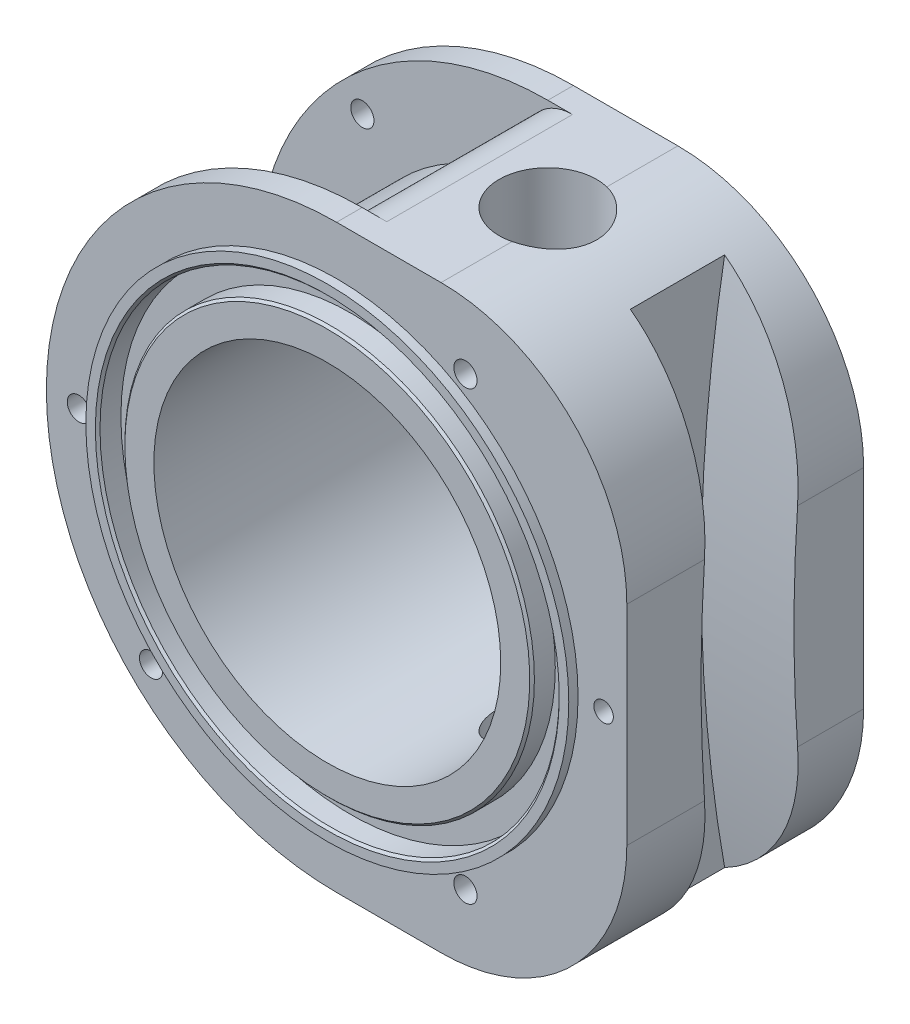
ISO-10303-21;
HEADER;
FILE_DESCRIPTION(('STEP AP214'),'2;1');
FILE_NAME('part.step','',(''),(''),'','','');
FILE_SCHEMA(('AUTOMOTIVE_DESIGN { 1 0 10303 214 1 1 1 1 }'));
ENDSEC;
DATA;
#1=APPLICATION_CONTEXT('core data for automotive mechanical design processes');
#2=APPLICATION_PROTOCOL_DEFINITION('international standard','automotive_design',2000,#1);
#3=PRODUCT_CONTEXT('',#1,'mechanical');
#4=PRODUCT('Part','Part','',(#3));
#5=PRODUCT_RELATED_PRODUCT_CATEGORY('part','',(#4));
#6=PRODUCT_DEFINITION_FORMATION('','',#4);
#7=PRODUCT_DEFINITION_CONTEXT('part definition',#1,'design');
#8=PRODUCT_DEFINITION('design','',#6,#7);
#9=PRODUCT_DEFINITION_SHAPE('','',#8);
#10=(LENGTH_UNIT() NAMED_UNIT(*) SI_UNIT(.MILLI.,.METRE.));
#11=(NAMED_UNIT(*) PLANE_ANGLE_UNIT() SI_UNIT($,.RADIAN.));
#12=(NAMED_UNIT(*) SI_UNIT($,.STERADIAN.) SOLID_ANGLE_UNIT());
#13=UNCERTAINTY_MEASURE_WITH_UNIT(LENGTH_MEASURE(1.E-05),#10,'distance_accuracy_value','');
#14=(GEOMETRIC_REPRESENTATION_CONTEXT(3) GLOBAL_UNCERTAINTY_ASSIGNED_CONTEXT((#13)) GLOBAL_UNIT_ASSIGNED_CONTEXT((#10,
#11,#12)) REPRESENTATION_CONTEXT('',''));
#15=CARTESIAN_POINT('',(0.,0.,0.));
#16=DIRECTION('',(0.,0.,1.));
#17=DIRECTION('',(1.,0.,0.));
#18=AXIS2_PLACEMENT_3D('',#15,#16,#17);
#19=CARTESIAN_POINT('',(22.5,22.5,0.));
#20=DIRECTION('',(0.,0.,-1.));
#21=DIRECTION('',(-1.,0.,0.));
#22=AXIS2_PLACEMENT_3D('',#19,#20,#21);
#23=PLANE('',#22);
#24=CARTESIAN_POINT('',(0.,0.,0.));
#25=DIRECTION('',(0.,0.,-1.));
#26=DIRECTION('',(-1.,0.,0.));
#27=AXIS2_PLACEMENT_3D('',#24,#25,#26);
#28=CIRCLE('',#27,49.95);
#29=CARTESIAN_POINT('',(-49.95,0.,0.));
#30=VERTEX_POINT('',#29);
#31=EDGE_CURVE('E222',#30,#30,#28,.F.);
#32=ORIENTED_EDGE('',*,*,#31,.T.);
#33=EDGE_LOOP('',(#32));
#34=FACE_BOUND('',#33,.T.);
#35=CARTESIAN_POINT('',(0.,0.,0.));
#36=DIRECTION('',(0.,0.,-1.));
#37=DIRECTION('',(-1.,0.,0.));
#38=AXIS2_PLACEMENT_3D('',#35,#36,#37);
#39=CIRCLE('',#38,52.);
#40=CARTESIAN_POINT('',(-52.,0.,0.));
#41=VERTEX_POINT('',#40);
#42=EDGE_CURVE('E928',#41,#41,#39,.T.);
#43=ORIENTED_EDGE('',*,*,#42,.T.);
#44=EDGE_LOOP('',(#43));
#45=FACE_BOUND('',#44,.T.);
#46=ADVANCED_FACE('F43',(#34,#45),#23,.T.);
#47=CARTESIAN_POINT('',(0.,-62.5,55.));
#48=DIRECTION('',(0.,1.,0.));
#49=DIRECTION('',(-1.,0.,0.));
#50=AXIS2_PLACEMENT_3D('',#47,#48,#49);
#51=PLANE('',#50);
#52=CARTESIAN_POINT('',(20.,-62.5,27.5));
#53=DIRECTION('',(0.,-1.,0.));
#54=DIRECTION('',(0.,0.,-1.));
#55=AXIS2_PLACEMENT_3D('',#52,#53,#54);
#56=CIRCLE('',#55,10.5);
#57=CARTESIAN_POINT('',(22.5,-62.5,37.6980390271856));
#58=VERTEX_POINT('',#57);
#59=CARTESIAN_POINT('',(22.5,-62.5,17.3019609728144));
#60=VERTEX_POINT('',#59);
#61=EDGE_CURVE('E57',#58,#60,#56,.T.);
#62=ORIENTED_EDGE('',*,*,#61,.F.);
#63=DIRECTION('',(0.,0.,-1.));
#64=VECTOR('',#63,1.);
#65=CARTESIAN_POINT('',(22.5,-62.5,55.));
#66=LINE('',#65,#64);
#67=CARTESIAN_POINT('',(22.5,-62.5,53.));
#68=VERTEX_POINT('',#67);
#69=EDGE_CURVE('E188',#68,#58,#66,.T.);
#70=ORIENTED_EDGE('',*,*,#69,.F.);
#71=DIRECTION('',(1.,0.,0.));
#72=VECTOR('',#71,1.);
#73=CARTESIAN_POINT('',(0.,-62.5,53.));
#74=LINE('',#73,#72);
#75=CARTESIAN_POINT('',(0.,-62.5,53.));
#76=VERTEX_POINT('',#75);
#77=EDGE_CURVE('E337',#76,#68,#74,.T.);
#78=ORIENTED_EDGE('',*,*,#77,.F.);
#79=DIRECTION('',(0.,0.,-1.));
#80=VECTOR('',#79,1.);
#81=CARTESIAN_POINT('',(0.,-62.5,55.));
#82=LINE('',#81,#80);
#83=CARTESIAN_POINT('',(0.,-62.5,47.5));
#84=VERTEX_POINT('',#83);
#85=EDGE_CURVE('E199',#76,#84,#82,.T.);
#86=ORIENTED_EDGE('',*,*,#85,.T.);
#87=DIRECTION('',(-1.,0.,0.));
#88=VECTOR('',#87,1.);
#89=CARTESIAN_POINT('',(0.,-62.5,47.5));
#90=LINE('',#89,#88);
#91=CARTESIAN_POINT('',(3.87415813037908,-62.5,47.5));
#92=VERTEX_POINT('',#91);
#93=EDGE_CURVE('E907',#92,#84,#90,.T.);
#94=ORIENTED_EDGE('',*,*,#93,.F.);
#95=DIRECTION('',(0.,0.,1.));
#96=VECTOR('',#95,1.);
#97=CARTESIAN_POINT('',(3.87415813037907,-62.5,7.5));
#98=LINE('',#97,#96);
#99=CARTESIAN_POINT('',(3.87415813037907,-62.5,7.5));
#100=VERTEX_POINT('',#99);
#101=EDGE_CURVE('E903',#100,#92,#98,.T.);
#102=ORIENTED_EDGE('',*,*,#101,.F.);
#103=DIRECTION('',(-1.,0.,0.));
#104=VECTOR('',#103,1.);
#105=CARTESIAN_POINT('',(0.,-62.5,7.5));
#106=LINE('',#105,#104);
#107=CARTESIAN_POINT('',(0.,-62.5,7.5));
#108=VERTEX_POINT('',#107);
#109=EDGE_CURVE('E870',#100,#108,#106,.T.);
#110=ORIENTED_EDGE('',*,*,#109,.T.);
#111=CARTESIAN_POINT('',(0.,-62.5,2.));
#112=VERTEX_POINT('',#111);
#113=EDGE_CURVE('E197',#108,#112,#82,.T.);
#114=ORIENTED_EDGE('',*,*,#113,.T.);
#115=DIRECTION('',(-1.,0.,0.));
#116=VECTOR('',#115,1.);
#117=CARTESIAN_POINT('',(0.,-62.5,2.));
#118=LINE('',#117,#116);
#119=CARTESIAN_POINT('',(22.5,-62.5,2.));
#120=VERTEX_POINT('',#119);
#121=EDGE_CURVE('E319',#120,#112,#118,.T.);
#122=ORIENTED_EDGE('',*,*,#121,.F.);
#123=EDGE_CURVE('E190',#60,#120,#66,.T.);
#124=ORIENTED_EDGE('',*,*,#123,.F.);
#125=EDGE_LOOP('',(#62,#70,#78,#86,#94,#102,#110,#114,#122,#124));
#126=FACE_BOUND('',#125,.T.);
#127=ADVANCED_FACE('F186',(#126),#51,.F.);
#128=CARTESIAN_POINT('',(0.,62.5,55.));
#129=DIRECTION('',(0.,-1.,0.));
#130=DIRECTION('',(0.,0.,-1.));
#131=AXIS2_PLACEMENT_3D('',#128,#129,#130);
#132=PLANE('',#131);
#133=CARTESIAN_POINT('',(20.,62.5,27.5));
#134=DIRECTION('',(0.,1.,0.));
#135=DIRECTION('',(0.,0.,1.));
#136=AXIS2_PLACEMENT_3D('',#133,#134,#135);
#137=CIRCLE('',#136,10.5);
#138=CARTESIAN_POINT('',(22.5,62.5,17.3019609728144));
#139=VERTEX_POINT('',#138);
#140=CARTESIAN_POINT('',(22.5,62.5,37.6980390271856));
#141=VERTEX_POINT('',#140);
#142=EDGE_CURVE('E64',#139,#141,#137,.T.);
#143=ORIENTED_EDGE('',*,*,#142,.F.);
#144=DIRECTION('',(0.,0.,-1.));
#145=VECTOR('',#144,1.);
#146=CARTESIAN_POINT('',(22.5,62.5,55.));
#147=LINE('',#146,#145);
#148=CARTESIAN_POINT('',(22.5,62.5,2.));
#149=VERTEX_POINT('',#148);
#150=EDGE_CURVE('E210',#139,#149,#147,.T.);
#151=ORIENTED_EDGE('',*,*,#150,.T.);
#152=DIRECTION('',(1.,0.,0.));
#153=VECTOR('',#152,1.);
#154=CARTESIAN_POINT('',(22.5,62.5,2.));
#155=LINE('',#154,#153);
#156=CARTESIAN_POINT('',(0.,62.5,2.));
#157=VERTEX_POINT('',#156);
#158=EDGE_CURVE('E314',#157,#149,#155,.T.);
#159=ORIENTED_EDGE('',*,*,#158,.F.);
#160=DIRECTION('',(0.,0.,-1.));
#161=VECTOR('',#160,1.);
#162=CARTESIAN_POINT('',(0.,62.5,55.));
#163=LINE('',#162,#161);
#164=CARTESIAN_POINT('',(0.,62.5,7.5));
#165=VERTEX_POINT('',#164);
#166=EDGE_CURVE('E206',#165,#157,#163,.T.);
#167=ORIENTED_EDGE('',*,*,#166,.F.);
#168=DIRECTION('',(1.,0.,0.));
#169=VECTOR('',#168,1.);
#170=CARTESIAN_POINT('',(0.,62.5,7.5));
#171=LINE('',#170,#169);
#172=CARTESIAN_POINT('',(5.30715071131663,62.5,7.5));
#173=VERTEX_POINT('',#172);
#174=EDGE_CURVE('E925',#165,#173,#171,.T.);
#175=ORIENTED_EDGE('',*,*,#174,.T.);
#176=DIRECTION('',(0.,0.,1.));
#177=VECTOR('',#176,1.);
#178=CARTESIAN_POINT('',(5.30715071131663,62.5,7.5));
#179=LINE('',#178,#177);
#180=CARTESIAN_POINT('',(5.30715071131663,62.5,47.5));
#181=VERTEX_POINT('',#180);
#182=EDGE_CURVE('E904',#173,#181,#179,.T.);
#183=ORIENTED_EDGE('',*,*,#182,.T.);
#184=DIRECTION('',(1.,0.,0.));
#185=VECTOR('',#184,1.);
#186=CARTESIAN_POINT('',(0.,62.5,47.5));
#187=LINE('',#186,#185);
#188=CARTESIAN_POINT('',(0.,62.5,47.5));
#189=VERTEX_POINT('',#188);
#190=EDGE_CURVE('E921',#189,#181,#187,.T.);
#191=ORIENTED_EDGE('',*,*,#190,.F.);
#192=CARTESIAN_POINT('',(0.,62.5,53.));
#193=VERTEX_POINT('',#192);
#194=EDGE_CURVE('E207',#193,#189,#163,.T.);
#195=ORIENTED_EDGE('',*,*,#194,.F.);
#196=DIRECTION('',(-1.,0.,0.));
#197=VECTOR('',#196,1.);
#198=CARTESIAN_POINT('',(22.5,62.5,53.));
#199=LINE('',#198,#197);
#200=CARTESIAN_POINT('',(22.5,62.5,53.));
#201=VERTEX_POINT('',#200);
#202=EDGE_CURVE('E333',#201,#193,#199,.T.);
#203=ORIENTED_EDGE('',*,*,#202,.F.);
#204=EDGE_CURVE('E211',#201,#141,#147,.T.);
#205=ORIENTED_EDGE('',*,*,#204,.T.);
#206=EDGE_LOOP('',(#143,#151,#159,#167,#175,#183,#191,#195,#203,#205));
#207=FACE_BOUND('',#206,.T.);
#208=ADVANCED_FACE('F255',(#207),#132,.F.);
#209=CARTESIAN_POINT('',(22.5,22.5,55.));
#210=DIRECTION('',(0.,0.,-1.));
#211=DIRECTION('',(-1.,0.,0.));
#212=AXIS2_PLACEMENT_3D('',#209,#210,#211);
#213=PLANE('',#212);
#214=CARTESIAN_POINT('',(0.,0.,55.));
#215=DIRECTION('',(0.,0.,-1.));
#216=DIRECTION('',(-1.,0.,0.));
#217=AXIS2_PLACEMENT_3D('',#214,#215,#216);
#218=CIRCLE('',#217,43.6);
#219=CARTESIAN_POINT('',(-43.6,0.,55.));
#220=VERTEX_POINT('',#219);
#221=EDGE_CURVE('E228',#220,#220,#218,.F.);
#222=ORIENTED_EDGE('',*,*,#221,.T.);
#223=EDGE_LOOP('',(#222));
#224=FACE_BOUND('',#223,.T.);
#225=CARTESIAN_POINT('',(0.,0.,55.));
#226=DIRECTION('',(0.,0.,1.));
#227=DIRECTION('',(1.,0.,0.));
#228=AXIS2_PLACEMENT_3D('',#225,#226,#227);
#229=CIRCLE('',#228,37.35);
#230=CARTESIAN_POINT('',(37.35,0.,55.));
#231=VERTEX_POINT('',#230);
#232=EDGE_CURVE('E279',#231,#231,#229,.T.);
#233=ORIENTED_EDGE('',*,*,#232,.F.);
#234=EDGE_LOOP('',(#233));
#235=FACE_BOUND('',#234,.T.);
#236=ADVANCED_FACE('F270',(#224,#235),#213,.F.);
#237=CARTESIAN_POINT('',(62.5,22.5,55.));
#238=DIRECTION('',(-1.,0.,0.));
#239=DIRECTION('',(0.,0.,1.));
#240=AXIS2_PLACEMENT_3D('',#237,#238,#239);
#241=PLANE('',#240);
#242=CARTESIAN_POINT('',(62.5,0.,-308.));
#243=DIRECTION('',(1.,0.,0.));
#244=DIRECTION('',(0.,0.,-1.));
#245=AXIS2_PLACEMENT_3D('',#242,#243,#244);
#246=CIRCLE('',#245,325.);
#247=CARTESIAN_POINT('',(62.5,22.5,16.2202183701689));
#248=VERTEX_POINT('',#247);
#249=CARTESIAN_POINT('',(62.5,-22.5,16.2202183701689));
#250=VERTEX_POINT('',#249);
#251=EDGE_CURVE('E502',#248,#250,#246,.T.);
#252=ORIENTED_EDGE('',*,*,#251,.T.);
#253=DIRECTION('',(0.,0.,-1.));
#254=VECTOR('',#253,1.);
#255=CARTESIAN_POINT('',(62.5,-22.5,55.));
#256=LINE('',#255,#254);
#257=CARTESIAN_POINT('',(62.5,-22.5,2.));
#258=VERTEX_POINT('',#257);
#259=EDGE_CURVE('E288',#250,#258,#256,.T.);
#260=ORIENTED_EDGE('',*,*,#259,.T.);
#261=DIRECTION('',(0.,-1.,0.));
#262=VECTOR('',#261,1.);
#263=CARTESIAN_POINT('',(62.5,-22.5,2.));
#264=LINE('',#263,#262);
#265=CARTESIAN_POINT('',(62.5,22.5,2.));
#266=VERTEX_POINT('',#265);
#267=EDGE_CURVE('E311',#266,#258,#264,.T.);
#268=ORIENTED_EDGE('',*,*,#267,.F.);
#269=DIRECTION('',(0.,0.,-1.));
#270=VECTOR('',#269,1.);
#271=CARTESIAN_POINT('',(62.5,22.5,55.));
#272=LINE('',#271,#270);
#273=EDGE_CURVE('E283',#248,#266,#272,.T.);
#274=ORIENTED_EDGE('',*,*,#273,.F.);
#275=EDGE_LOOP('',(#252,#260,#268,#274));
#276=FACE_BOUND('',#275,.T.);
#277=ADVANCED_FACE('F272',(#276),#241,.F.);
#278=CARTESIAN_POINT('',(0.,0.,55.));
#279=DIRECTION('',(0.,0.,-1.));
#280=DIRECTION('',(-1.,0.,0.));
#281=AXIS2_PLACEMENT_3D('',#278,#279,#280);
#282=CYLINDRICAL_SURFACE('',#281,62.5);
#283=CARTESIAN_POINT('',(0.,0.,47.5));
#284=DIRECTION('',(0.,0.,-1.));
#285=DIRECTION('',(-1.,0.,0.));
#286=AXIS2_PLACEMENT_3D('',#283,#284,#285);
#287=CIRCLE('',#286,62.5);
#288=EDGE_CURVE('E919',#84,#189,#287,.T.);
#289=ORIENTED_EDGE('',*,*,#288,.F.);
#290=ORIENTED_EDGE('',*,*,#85,.F.);
#291=CARTESIAN_POINT('',(0.,0.,53.));
#292=DIRECTION('',(0.,0.,1.));
#293=DIRECTION('',(1.,0.,0.));
#294=AXIS2_PLACEMENT_3D('',#291,#292,#293);
#295=CIRCLE('',#294,62.5);
#296=EDGE_CURVE('E335',#193,#76,#295,.T.);
#297=ORIENTED_EDGE('',*,*,#296,.F.);
#298=ORIENTED_EDGE('',*,*,#194,.T.);
#299=EDGE_LOOP('',(#289,#290,#297,#298));
#300=FACE_BOUND('',#299,.T.);
#301=ADVANCED_FACE('F443',(#300),#282,.T.);
#302=CARTESIAN_POINT('',(22.5,22.5,55.));
#303=DIRECTION('',(0.,0.,-1.));
#304=DIRECTION('',(-1.,0.,0.));
#305=AXIS2_PLACEMENT_3D('',#302,#303,#304);
#306=CYLINDRICAL_SURFACE('',#305,40.);
#307=ORIENTED_EDGE('',*,*,#150,.F.);
#308=CARTESIAN_POINT('',(22.5,62.5,17.3019609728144));
#309=CARTESIAN_POINT('',(22.7838688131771,62.5000261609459,17.3715132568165));
#310=CARTESIAN_POINT('',(23.0647980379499,62.4969789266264,17.4529808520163));
#311=CARTESIAN_POINT('',(23.6187419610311,62.4853046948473,17.6389732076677));
#312=CARTESIAN_POINT('',(23.8917581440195,62.4766787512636,17.7434936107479));
#313=CARTESIAN_POINT('',(24.427510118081,62.4544319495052,17.9746554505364));
#314=CARTESIAN_POINT('',(24.6902620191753,62.4408192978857,18.1012603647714));
#315=CARTESIAN_POINT('',(25.2041355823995,62.4093207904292,18.3757567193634));
#316=CARTESIAN_POINT('',(25.4552569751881,62.3914348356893,18.523648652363));
#317=CARTESIAN_POINT('',(25.9441049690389,62.3522054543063,18.8396127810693));
#318=CARTESIAN_POINT('',(26.1818341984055,62.3308627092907,19.0076809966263));
#319=CARTESIAN_POINT('',(26.6423787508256,62.2856035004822,19.3628402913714));
#320=CARTESIAN_POINT('',(26.8651935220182,62.2616869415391,19.5499320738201));
#321=CARTESIAN_POINT('',(27.2944712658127,62.2122115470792,19.9418799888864));
#322=CARTESIAN_POINT('',(27.5009317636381,62.1866524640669,20.1467388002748));
#323=CARTESIAN_POINT('',(27.8961169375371,62.1348539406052,20.5728238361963));
#324=CARTESIAN_POINT('',(28.0848414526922,62.1086144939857,20.7940502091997));
#325=CARTESIAN_POINT('',(28.4461753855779,62.0559966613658,21.2550616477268));
#326=CARTESIAN_POINT('',(28.6184796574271,62.0296227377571,21.4950864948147));
#327=CARTESIAN_POINT('',(28.9423058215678,61.9781406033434,21.9888893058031));
#328=CARTESIAN_POINT('',(29.0938281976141,61.9530323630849,22.242666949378));
#329=CARTESIAN_POINT('',(29.3750318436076,61.9050034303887,22.7622738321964));
#330=CARTESIAN_POINT('',(29.5047114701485,61.8820829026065,23.0281039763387));
#331=CARTESIAN_POINT('',(29.7412625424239,61.8392752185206,23.5699626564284));
#332=CARTESIAN_POINT('',(29.8481341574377,61.819388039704,23.845991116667));
#333=CARTESIAN_POINT('',(30.0381642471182,61.7833989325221,24.406036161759));
#334=CARTESIAN_POINT('',(30.1213456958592,61.7672933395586,24.6900447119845));
#335=CARTESIAN_POINT('',(30.2634796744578,61.739439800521,25.2642744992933));
#336=CARTESIAN_POINT('',(30.3224321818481,61.7276918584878,25.5544957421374));
#337=CARTESIAN_POINT('',(30.4156225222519,61.7089936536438,26.138982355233));
#338=CARTESIAN_POINT('',(30.449864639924,61.7020425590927,26.4332470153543));
#339=CARTESIAN_POINT('',(30.493367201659,61.6931955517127,27.0236910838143));
#340=CARTESIAN_POINT('',(30.5026280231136,61.6912995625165,27.3198704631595));
#341=CARTESIAN_POINT('',(30.4961530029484,61.6926210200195,27.9064595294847));
#342=CARTESIAN_POINT('',(30.4808763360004,61.695744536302,28.1968746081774));
#343=CARTESIAN_POINT('',(30.4263079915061,61.7068159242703,28.7753433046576));
#344=CARTESIAN_POINT('',(30.387016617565,61.7147637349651,29.0633969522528));
#345=CARTESIAN_POINT('',(30.2847272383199,61.7351976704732,29.6351170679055));
#346=CARTESIAN_POINT('',(30.2217276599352,61.7476840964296,29.9187832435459));
#347=CARTESIAN_POINT('',(30.0725104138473,61.776747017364,30.4797259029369));
#348=CARTESIAN_POINT('',(29.9862925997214,61.7933235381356,30.7570023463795));
#349=CARTESIAN_POINT('',(29.7913232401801,61.8299686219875,31.3031613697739));
#350=CARTESIAN_POINT('',(29.6825798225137,61.8500359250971,31.5720469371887));
#351=CARTESIAN_POINT('',(29.4432775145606,61.8929647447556,32.0998375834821));
#352=CARTESIAN_POINT('',(29.3127089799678,61.915827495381,32.3587381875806));
#353=CARTESIAN_POINT('',(29.0307013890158,61.9635322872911,32.8647297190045));
#354=CARTESIAN_POINT('',(28.8792616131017,61.9883743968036,33.1118202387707));
#355=CARTESIAN_POINT('',(28.5566107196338,62.039146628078,33.5924676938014));
#356=CARTESIAN_POINT('',(28.385407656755,62.0650763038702,33.826030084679));
#357=CARTESIAN_POINT('',(28.0208956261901,62.1176001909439,34.282487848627));
#358=CARTESIAN_POINT('',(27.827229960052,62.1441976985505,34.5050981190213));
#359=CARTESIAN_POINT('',(27.4217989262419,62.1965699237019,34.9332923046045));
#360=CARTESIAN_POINT('',(27.2100331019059,62.2223446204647,35.1388757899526));
#361=CARTESIAN_POINT('',(26.7698597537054,62.2720672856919,35.5315612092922));
#362=CARTESIAN_POINT('',(26.5414545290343,62.2960155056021,35.7186656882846));
#363=CARTESIAN_POINT('',(26.0695283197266,62.341117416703,36.0730915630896));
#364=CARTESIAN_POINT('',(25.8260081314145,62.3622712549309,36.2404139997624));
#365=CARTESIAN_POINT('',(25.3393896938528,62.3998003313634,36.5453712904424));
#366=CARTESIAN_POINT('',(25.0970147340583,62.4163753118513,36.6841369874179));
#367=CARTESIAN_POINT('',(24.6017996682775,62.445512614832,36.9420005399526));
#368=CARTESIAN_POINT('',(24.3489602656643,62.4580752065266,37.0610997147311));
#369=CARTESIAN_POINT('',(23.8341508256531,62.4785734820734,37.2789285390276));
#370=CARTESIAN_POINT('',(23.572171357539,62.4865042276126,37.3776363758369));
#371=CARTESIAN_POINT('',(23.0410268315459,62.4972290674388,37.5538866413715));
#372=CARTESIAN_POINT('',(22.7718602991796,62.5000220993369,37.6314246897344));
#373=CARTESIAN_POINT('',(22.5,62.5,37.6980390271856));
#374=B_SPLINE_CURVE_WITH_KNOTS('',3,(#308,#309,#310,#311,#312,#313,#314,#315,#316,#317,#318,
#319,#320,#321,#322,#323,#324,#325,#326,#327,#328,#329,#330,#331,#332,#333,#334,#335,#336,#337,
#338,#339,#340,#341,#342,#343,#344,#345,#346,#347,#348,#349,#350,#351,#352,#353,#354,#355,#356,
#357,#358,#359,#360,#361,#362,#363,#364,#365,#366,#367,#368,#369,#370,#371,#372,#373),
.UNSPECIFIED.,.F.,.F.,(4,2,2,2,2,2,2,2,2,2,2,2,2,2,2,2,2,2,2,2,2,2,2,2,2,2,2,2,2,2,2,2,4),(0.,
0.876497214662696,1.75282889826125,2.62772484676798,3.50264104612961,4.37738493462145,
5.25216117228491,6.12706953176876,7.00198582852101,7.89086091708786,8.7797153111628,
9.66863655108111,10.5575511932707,11.4456008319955,12.333651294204,13.2215477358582,
14.109430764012,14.9808913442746,15.8523409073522,16.7238483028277,17.595361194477,
18.4665601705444,19.3381451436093,20.2097601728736,21.0810212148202,21.9687520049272,
22.8565051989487,23.7441359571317,24.6317199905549,25.4701565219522,26.3085367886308,
27.1478092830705,27.9872553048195),.UNSPECIFIED.);
#375=EDGE_CURVE('E460',#139,#141,#374,.T.);
#376=ORIENTED_EDGE('',*,*,#375,.T.);
#377=ORIENTED_EDGE('',*,*,#204,.F.);
#378=CARTESIAN_POINT('',(22.5,22.5,53.));
#379=DIRECTION('',(0.,0.,1.));
#380=DIRECTION('',(1.,0.,0.));
#381=AXIS2_PLACEMENT_3D('',#378,#379,#380);
#382=CIRCLE('',#381,40.);
#383=CARTESIAN_POINT('',(62.5,22.5,53.));
#384=VERTEX_POINT('',#383);
#385=EDGE_CURVE('E329',#384,#201,#382,.T.);
#386=ORIENTED_EDGE('',*,*,#385,.F.);
#387=CARTESIAN_POINT('',(62.5,22.5,36.2655225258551));
#388=VERTEX_POINT('',#387);
#389=EDGE_CURVE('E286',#384,#388,#272,.T.);
#390=ORIENTED_EDGE('',*,*,#389,.T.);
#391=CARTESIAN_POINT('',(62.5,22.5,36.2655225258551));
#392=CARTESIAN_POINT('',(62.5000070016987,23.0643677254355,36.2286408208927));
#393=CARTESIAN_POINT('',(62.4880558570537,23.6286378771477,36.1903650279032));
#394=CARTESIAN_POINT('',(62.4403145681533,24.7559745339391,36.1111163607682));
#395=CARTESIAN_POINT('',(62.4045246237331,25.3190410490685,36.070143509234));
#396=CARTESIAN_POINT('',(62.3091878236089,26.4429148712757,35.9855954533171));
#397=CARTESIAN_POINT('',(62.2496433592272,27.003722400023,35.9420205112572));
#398=CARTESIAN_POINT('',(62.1069442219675,28.1220865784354,35.8523856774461));
#399=CARTESIAN_POINT('',(62.0237895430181,28.6796432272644,35.8063257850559));
#400=CARTESIAN_POINT('',(61.7395192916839,30.3437422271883,35.6647983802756));
#401=CARTESIAN_POINT('',(61.5033841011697,31.4442206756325,35.5657940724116));
#402=CARTESIAN_POINT('',(60.9395382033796,33.6205191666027,35.3596601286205));
#403=CARTESIAN_POINT('',(60.6118270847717,34.6963390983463,35.2525304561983));
#404=CARTESIAN_POINT('',(59.8670841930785,36.8165625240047,35.0315979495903));
#405=CARTESIAN_POINT('',(59.450006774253,37.8609496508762,34.917791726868));
#406=CARTESIAN_POINT('',(58.5296838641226,39.9104518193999,34.6853070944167));
#407=CARTESIAN_POINT('',(58.0264388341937,40.9155670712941,34.5666287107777));
#408=CARTESIAN_POINT('',(56.9371861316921,42.8799375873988,34.3262924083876));
#409=CARTESIAN_POINT('',(56.35115358,43.8391789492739,34.2046336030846));
#410=CARTESIAN_POINT('',(55.1005040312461,45.7049250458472,33.9604440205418));
#411=CARTESIAN_POINT('',(54.4358824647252,46.6114267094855,33.837913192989));
#412=CARTESIAN_POINT('',(52.9604448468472,48.4556450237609,33.5816213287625));
#413=CARTESIAN_POINT('',(52.1416233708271,49.38698680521,33.4480010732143));
#414=CARTESIAN_POINT('',(50.4205074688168,51.1702007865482,33.1853207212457));
#415=CARTESIAN_POINT('',(49.5182043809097,52.0220647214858,33.0562610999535));
#416=CARTESIAN_POINT('',(48.1070771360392,53.2353907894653,32.868246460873));
#417=CARTESIAN_POINT('',(47.6263998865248,53.6295771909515,32.8064242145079));
#418=CARTESIAN_POINT('',(46.6469824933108,54.3952892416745,32.6850491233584));
#419=CARTESIAN_POINT('',(46.1482423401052,54.7668148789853,32.6254962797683));
#420=CARTESIAN_POINT('',(45.1337690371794,55.4863492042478,32.5090277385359));
#421=CARTESIAN_POINT('',(44.6180353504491,55.8343571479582,32.4521121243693));
#422=CARTESIAN_POINT('',(43.5706690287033,56.5060899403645,32.3412661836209));
#423=CARTESIAN_POINT('',(43.0390361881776,56.8298144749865,32.2873358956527));
#424=CARTESIAN_POINT('',(42.5,57.1410161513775,32.2350720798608));
#425=B_SPLINE_CURVE_WITH_KNOTS('',3,(#391,#392,#393,#394,#395,#396,#397,#398,#399,#400,#401,
#402,#403,#404,#405,#406,#407,#408,#409,#410,#411,#412,#413,#414,#415,#416,#417,#418,#419,#420,
#421,#422,#423,#424),.UNSPECIFIED.,.F.,.F.,(4,2,2,2,2,2,2,2,2,2,2,2,2,2,2,2,4),(0.,
1.69657475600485,3.39313529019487,5.08952507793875,6.78591530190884,10.1711503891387,
13.5564006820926,16.9433842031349,20.3303495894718,23.7183349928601,27.1065174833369,
30.843092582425,34.5800558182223,36.4536128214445,38.327170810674,40.2007880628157,
42.0744295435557),.UNSPECIFIED.);
#426=CARTESIAN_POINT('',(42.5,57.1410161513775,32.2350720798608));
#427=VERTEX_POINT('',#426);
#428=EDGE_CURVE('E351',#388,#427,#425,.T.);
#429=ORIENTED_EDGE('',*,*,#428,.T.);
#430=DIRECTION('',(0.,0.,-1.));
#431=VECTOR('',#430,1.);
#432=CARTESIAN_POINT('',(42.5,57.1410161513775,55.));
#433=LINE('',#432,#431);
#434=CARTESIAN_POINT('',(42.5,57.1410161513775,11.9373442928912));
#435=VERTEX_POINT('',#434);
#436=EDGE_CURVE('E353',#435,#427,#433,.F.);
#437=ORIENTED_EDGE('',*,*,#436,.F.);
#438=CARTESIAN_POINT('',(62.5,22.5,16.2202183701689));
#439=CARTESIAN_POINT('',(62.5000070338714,23.0645610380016,16.1810429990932));
#440=CARTESIAN_POINT('',(62.4880476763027,23.6290126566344,16.1403863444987));
#441=CARTESIAN_POINT('',(62.4402767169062,24.7566866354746,16.0562073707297));
#442=CARTESIAN_POINT('',(62.4044653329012,25.3199090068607,16.0126850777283));
#443=CARTESIAN_POINT('',(62.3090759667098,26.4440641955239,15.9228758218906));
#444=CARTESIAN_POINT('',(62.2495005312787,27.0049972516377,15.8765891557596));
#445=CARTESIAN_POINT('',(62.1067330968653,28.1235852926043,15.7813756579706));
#446=CARTESIAN_POINT('',(62.02354108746,28.6812402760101,15.7324488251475));
#447=CARTESIAN_POINT('',(61.7391594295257,30.3455638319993,15.5821140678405));
#448=CARTESIAN_POINT('',(61.5029480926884,31.4461281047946,15.4769486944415));
#449=CARTESIAN_POINT('',(60.9389667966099,33.6224996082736,15.2579844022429));
#450=CARTESIAN_POINT('',(60.6111962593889,34.6983066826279,15.1441854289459));
#451=CARTESIAN_POINT('',(59.8663846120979,36.8183821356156,14.9094990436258));
#452=CARTESIAN_POINT('',(59.4493012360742,37.8626353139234,14.7886082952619));
#453=CARTESIAN_POINT('',(58.529019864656,39.9118158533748,14.541644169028));
#454=CARTESIAN_POINT('',(58.0258223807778,40.9167434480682,14.415570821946));
#455=CARTESIAN_POINT('',(56.9367112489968,42.8807292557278,14.1602459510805));
#456=CARTESIAN_POINT('',(56.3507716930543,43.8397729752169,14.0309934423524));
#457=CARTESIAN_POINT('',(55.1003480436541,45.7051334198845,13.7715459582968));
#458=CARTESIAN_POINT('',(54.4358593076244,46.6114470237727,13.6413509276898));
#459=CARTESIAN_POINT('',(52.9606355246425,48.4554162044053,13.3689910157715));
#460=CARTESIAN_POINT('',(52.1418871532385,49.386692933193,13.2269737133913));
#461=CARTESIAN_POINT('',(50.4208864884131,51.169828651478,12.9477579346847));
#462=CARTESIAN_POINT('',(49.5186257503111,52.0216795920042,12.8105599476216));
#463=CARTESIAN_POINT('',(48.1075189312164,53.2350223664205,12.6106691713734));
#464=CARTESIAN_POINT('',(47.6268488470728,53.6292150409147,12.5449393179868));
#465=CARTESIAN_POINT('',(46.6474227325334,54.3949561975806,12.4158850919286));
#466=CARTESIAN_POINT('',(46.1486667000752,54.7665046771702,12.3525607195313));
#467=CARTESIAN_POINT('',(45.1341295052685,55.4861027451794,12.2287085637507));
#468=CARTESIAN_POINT('',(44.6183476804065,55.8341514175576,12.1681808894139));
#469=CARTESIAN_POINT('',(43.570851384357,56.5059784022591,12.0502937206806));
#470=CARTESIAN_POINT('',(43.0391366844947,56.829756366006,11.9929342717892));
#471=CARTESIAN_POINT('',(42.5,57.1410161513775,11.9373442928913));
#472=B_SPLINE_CURVE_WITH_KNOTS('',3,(#438,#439,#440,#441,#442,#443,#444,#445,#446,#447,#448,
#449,#450,#451,#452,#453,#454,#455,#456,#457,#458,#459,#460,#461,#462,#463,#464,#465,#466,#467,
#468,#469,#470,#471),.UNSPECIFIED.,.F.,.F.,(4,2,2,2,2,2,2,2,2,2,2,2,2,2,2,2,4),(0.,
1.69761535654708,3.3952152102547,5.09263318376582,6.7900519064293,10.1772508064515,
13.5644710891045,16.9532978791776,20.34210454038,23.7319746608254,27.1220452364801,
30.861118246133,34.6005697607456,36.4753183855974,38.3500672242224,40.2248890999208,
42.0997378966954),.UNSPECIFIED.);
#473=EDGE_CURVE('E301',#248,#435,#472,.T.);
#474=ORIENTED_EDGE('',*,*,#473,.F.);
#475=ORIENTED_EDGE('',*,*,#273,.T.);
#476=CARTESIAN_POINT('',(22.5,22.5,2.));
#477=DIRECTION('',(0.,0.,-1.));
#478=DIRECTION('',(-1.,0.,0.));
#479=AXIS2_PLACEMENT_3D('',#476,#477,#478);
#480=CIRCLE('',#479,40.);
#481=EDGE_CURVE('E299',#149,#266,#480,.T.);
#482=ORIENTED_EDGE('',*,*,#481,.F.);
#483=EDGE_LOOP('',(#307,#376,#377,#386,#390,#429,#437,#474,#475,#482));
#484=FACE_BOUND('',#483,.T.);
#485=ADVANCED_FACE('F298',(#484),#306,.T.);
#486=ORIENTED_EDGE('',*,*,#113,.F.);
#487=CARTESIAN_POINT('',(0.,0.,7.5));
#488=DIRECTION('',(0.,0.,-1.));
#489=DIRECTION('',(-1.,0.,0.));
#490=AXIS2_PLACEMENT_3D('',#487,#488,#489);
#491=CIRCLE('',#490,62.5);
#492=EDGE_CURVE('E865',#108,#165,#491,.T.);
#493=ORIENTED_EDGE('',*,*,#492,.T.);
#494=ORIENTED_EDGE('',*,*,#166,.T.);
#495=CARTESIAN_POINT('',(0.,0.,2.));
#496=DIRECTION('',(0.,0.,-1.));
#497=DIRECTION('',(-1.,0.,0.));
#498=AXIS2_PLACEMENT_3D('',#495,#496,#497);
#499=CIRCLE('',#498,62.5);
#500=EDGE_CURVE('E867',#112,#157,#499,.T.);
#501=ORIENTED_EDGE('',*,*,#500,.F.);
#502=EDGE_LOOP('',(#486,#493,#494,#501));
#503=FACE_BOUND('',#502,.T.);
#504=ADVANCED_FACE('F451',(#503),#282,.T.);
#505=CARTESIAN_POINT('',(22.5,-22.5,55.));
#506=DIRECTION('',(0.,0.,-1.));
#507=DIRECTION('',(-1.,0.,0.));
#508=AXIS2_PLACEMENT_3D('',#505,#506,#507);
#509=CYLINDRICAL_SURFACE('',#508,40.);
#510=ORIENTED_EDGE('',*,*,#69,.T.);
#511=CARTESIAN_POINT('',(22.5,-62.5,37.6980390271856));
#512=CARTESIAN_POINT('',(22.7838688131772,-62.5000261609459,37.6284867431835));
#513=CARTESIAN_POINT('',(23.0647980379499,-62.4969789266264,37.5470191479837));
#514=CARTESIAN_POINT('',(23.6187419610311,-62.4853046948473,37.3610267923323));
#515=CARTESIAN_POINT('',(23.8917581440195,-62.4766787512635,37.2565063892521));
#516=CARTESIAN_POINT('',(24.427510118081,-62.4544319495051,37.0253445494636));
#517=CARTESIAN_POINT('',(24.6902620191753,-62.4408192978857,36.8987396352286));
#518=CARTESIAN_POINT('',(25.2041355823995,-62.4093207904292,36.6242432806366));
#519=CARTESIAN_POINT('',(25.4552569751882,-62.3914348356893,36.476351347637));
#520=CARTESIAN_POINT('',(25.9441049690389,-62.3522054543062,36.1603872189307));
#521=CARTESIAN_POINT('',(26.1818341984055,-62.3308627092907,35.9923190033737));
#522=CARTESIAN_POINT('',(26.6423787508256,-62.2856035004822,35.6371597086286));
#523=CARTESIAN_POINT('',(26.8651935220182,-62.2616869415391,35.4500679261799));
#524=CARTESIAN_POINT('',(27.2944712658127,-62.2122115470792,35.0581200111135));
#525=CARTESIAN_POINT('',(27.5009317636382,-62.1866524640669,34.8532611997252));
#526=CARTESIAN_POINT('',(27.8961169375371,-62.1348539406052,34.4271761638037));
#527=CARTESIAN_POINT('',(28.0848414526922,-62.1086144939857,34.2059497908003));
#528=CARTESIAN_POINT('',(28.4461753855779,-62.0559966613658,33.7449383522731));
#529=CARTESIAN_POINT('',(28.6184796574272,-62.029622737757,33.5049135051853));
#530=CARTESIAN_POINT('',(28.9423058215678,-61.9781406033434,33.0111106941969));
#531=CARTESIAN_POINT('',(29.0938281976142,-61.9530323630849,32.757333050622));
#532=CARTESIAN_POINT('',(29.3750318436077,-61.9050034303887,32.2377261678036));
#533=CARTESIAN_POINT('',(29.5047114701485,-61.8820829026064,31.9718960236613));
#534=CARTESIAN_POINT('',(29.7412625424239,-61.8392752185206,31.4300373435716));
#535=CARTESIAN_POINT('',(29.8481341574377,-61.819388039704,31.154008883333));
#536=CARTESIAN_POINT('',(30.0381642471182,-61.7833989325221,30.593963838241));
#537=CARTESIAN_POINT('',(30.1213456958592,-61.7672933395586,30.3099552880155));
#538=CARTESIAN_POINT('',(30.2634796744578,-61.739439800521,29.7357255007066));
#539=CARTESIAN_POINT('',(30.3224321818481,-61.7276918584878,29.4455042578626));
#540=CARTESIAN_POINT('',(30.4156225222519,-61.7089936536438,28.861017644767));
#541=CARTESIAN_POINT('',(30.449864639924,-61.7020425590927,28.5667529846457));
#542=CARTESIAN_POINT('',(30.493367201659,-61.6931955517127,27.9763089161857));
#543=CARTESIAN_POINT('',(30.5026280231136,-61.6912995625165,27.6801295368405));
#544=CARTESIAN_POINT('',(30.4961530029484,-61.6926210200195,27.0935404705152));
#545=CARTESIAN_POINT('',(30.4808763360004,-61.695744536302,26.8031253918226));
#546=CARTESIAN_POINT('',(30.4263079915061,-61.7068159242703,26.2246566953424));
#547=CARTESIAN_POINT('',(30.387016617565,-61.7147637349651,25.9366030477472));
#548=CARTESIAN_POINT('',(30.2847272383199,-61.7351976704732,25.3648829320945));
#549=CARTESIAN_POINT('',(30.2217276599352,-61.7476840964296,25.0812167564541));
#550=CARTESIAN_POINT('',(30.0725104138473,-61.776747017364,24.5202740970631));
#551=CARTESIAN_POINT('',(29.9862925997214,-61.7933235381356,24.2429976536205));
#552=CARTESIAN_POINT('',(29.7913232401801,-61.8299686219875,23.6968386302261));
#553=CARTESIAN_POINT('',(29.6825798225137,-61.850035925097,23.4279530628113));
#554=CARTESIAN_POINT('',(29.4432775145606,-61.8929647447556,22.9001624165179));
#555=CARTESIAN_POINT('',(29.3127089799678,-61.915827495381,22.6412618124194));
#556=CARTESIAN_POINT('',(29.0307013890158,-61.9635322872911,22.1352702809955));
#557=CARTESIAN_POINT('',(28.8792616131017,-61.9883743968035,21.8881797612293));
#558=CARTESIAN_POINT('',(28.5566107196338,-62.039146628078,21.4075323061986));
#559=CARTESIAN_POINT('',(28.385407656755,-62.0650763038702,21.173969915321));
#560=CARTESIAN_POINT('',(28.0208956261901,-62.1176001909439,20.717512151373));
#561=CARTESIAN_POINT('',(27.827229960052,-62.1441976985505,20.4949018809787));
#562=CARTESIAN_POINT('',(27.4217989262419,-62.1965699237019,20.0667076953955));
#563=CARTESIAN_POINT('',(27.2100331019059,-62.2223446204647,19.8611242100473));
#564=CARTESIAN_POINT('',(26.7698597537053,-62.2720672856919,19.4684387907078));
#565=CARTESIAN_POINT('',(26.5414545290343,-62.2960155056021,19.2813343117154));
#566=CARTESIAN_POINT('',(26.0695283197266,-62.3411174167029,18.9269084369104));
#567=CARTESIAN_POINT('',(25.8260081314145,-62.3622712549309,18.7595860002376));
#568=CARTESIAN_POINT('',(25.3393896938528,-62.3998003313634,18.4546287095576));
#569=CARTESIAN_POINT('',(25.0970147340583,-62.4163753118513,18.3158630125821));
#570=CARTESIAN_POINT('',(24.6017996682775,-62.445512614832,18.0579994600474));
#571=CARTESIAN_POINT('',(24.3489602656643,-62.4580752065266,17.9389002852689));
#572=CARTESIAN_POINT('',(23.8341508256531,-62.4785734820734,17.7210714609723));
#573=CARTESIAN_POINT('',(23.572171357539,-62.4865042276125,17.6223636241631));
#574=CARTESIAN_POINT('',(23.041026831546,-62.4972290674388,17.4461133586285));
#575=CARTESIAN_POINT('',(22.7718602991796,-62.5000220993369,17.3685753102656));
#576=CARTESIAN_POINT('',(22.5,-62.5,17.3019609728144));
#577=B_SPLINE_CURVE_WITH_KNOTS('',3,(#511,#512,#513,#514,#515,#516,#517,#518,#519,#520,#521,
#522,#523,#524,#525,#526,#527,#528,#529,#530,#531,#532,#533,#534,#535,#536,#537,#538,#539,#540,
#541,#542,#543,#544,#545,#546,#547,#548,#549,#550,#551,#552,#553,#554,#555,#556,#557,#558,#559,
#560,#561,#562,#563,#564,#565,#566,#567,#568,#569,#570,#571,#572,#573,#574,#575,#576),
.UNSPECIFIED.,.F.,.F.,(4,2,2,2,2,2,2,2,2,2,2,2,2,2,2,2,2,2,2,2,2,2,2,2,2,2,2,2,2,2,2,2,4),(0.,
0.8764972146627,1.75282889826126,2.62772484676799,3.50264104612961,4.37738493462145,
5.25216117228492,6.12706953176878,7.00198582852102,7.89086091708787,8.77971531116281,
9.66863655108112,10.5575511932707,11.4456008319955,12.333651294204,13.2215477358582,
14.109430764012,14.9808913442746,15.8523409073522,16.7238483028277,17.595361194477,
18.4665601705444,19.3381451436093,20.2097601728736,21.0810212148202,21.9687520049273,
22.8565051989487,23.7441359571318,24.6317199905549,25.4701565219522,26.3085367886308,
27.1478092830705,27.9872553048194),.UNSPECIFIED.);
#578=EDGE_CURVE('E177',#58,#60,#577,.T.);
#579=ORIENTED_EDGE('',*,*,#578,.T.);
#580=ORIENTED_EDGE('',*,*,#123,.T.);
#581=CARTESIAN_POINT('',(22.5,-22.5,2.));
#582=DIRECTION('',(0.,0.,-1.));
#583=DIRECTION('',(-1.,0.,0.));
#584=AXIS2_PLACEMENT_3D('',#581,#582,#583);
#585=CIRCLE('',#584,40.);
#586=EDGE_CURVE('E317',#258,#120,#585,.T.);
#587=ORIENTED_EDGE('',*,*,#586,.F.);
#588=ORIENTED_EDGE('',*,*,#259,.F.);
#589=CARTESIAN_POINT('',(42.5,-57.1410161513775,11.9373442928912));
#590=CARTESIAN_POINT('',(42.990325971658,-56.8579254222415,11.9879034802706));
#591=CARTESIAN_POINT('',(43.4744663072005,-56.5645250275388,12.0399182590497));
#592=CARTESIAN_POINT('',(44.429652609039,-55.9575941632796,12.1465957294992));
#593=CARTESIAN_POINT('',(44.9006987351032,-55.6440639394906,12.2012583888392));
#594=CARTESIAN_POINT('',(46.2928243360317,-54.6742138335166,12.3687885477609));
#595=CARTESIAN_POINT('',(47.1932137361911,-53.9884481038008,12.4852317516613));
#596=CARTESIAN_POINT('',(48.9306049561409,-52.5449181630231,12.7250628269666));
#597=CARTESIAN_POINT('',(49.7677067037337,-51.7872719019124,12.8484391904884));
#598=CARTESIAN_POINT('',(51.3745881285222,-50.204330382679,13.0999333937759));
#599=CARTESIAN_POINT('',(52.1443672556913,-49.3790345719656,13.2280512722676));
#600=CARTESIAN_POINT('',(53.6116919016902,-47.6661503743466,13.4866848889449));
#601=CARTESIAN_POINT('',(54.3091991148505,-46.7785293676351,13.6172018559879));
#602=CARTESIAN_POINT('',(55.6267307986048,-44.9475340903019,13.8781977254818));
#603=CARTESIAN_POINT('',(56.2467557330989,-44.0041601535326,14.0086766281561));
#604=CARTESIAN_POINT('',(57.4050583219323,-42.0680741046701,14.2673282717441));
#605=CARTESIAN_POINT('',(57.9433288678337,-41.0753577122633,14.3955008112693));
#606=CARTESIAN_POINT('',(58.9342484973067,-39.0474820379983,14.6473896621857));
#607=CARTESIAN_POINT('',(59.3868934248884,-38.0123206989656,14.7711057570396));
#608=CARTESIAN_POINT('',(60.2393663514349,-35.8135589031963,15.0227841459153));
#609=CARTESIAN_POINT('',(60.6309770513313,-34.6466983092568,15.150153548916));
#610=CARTESIAN_POINT('',(61.3053114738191,-32.280625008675,15.3950756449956));
#611=CARTESIAN_POINT('',(61.5880256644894,-31.0814094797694,15.5126274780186));
#612=CARTESIAN_POINT('',(61.9286569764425,-29.2648016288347,15.6803109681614));
#613=CARTESIAN_POINT('',(62.0283809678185,-28.6553712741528,15.73484024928));
#614=CARTESIAN_POINT('',(62.199550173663,-27.4322311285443,15.8407776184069));
#615=CARTESIAN_POINT('',(62.2709953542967,-26.8185213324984,15.8921857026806));
#616=CARTESIAN_POINT('',(62.3853983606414,-25.588160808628,15.9917079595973));
#617=CARTESIAN_POINT('',(62.4283544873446,-24.9715099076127,16.0398219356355));
#618=CARTESIAN_POINT('',(62.4856605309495,-23.7366167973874,16.1326230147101));
#619=CARTESIAN_POINT('',(62.500010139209,-23.1183745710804,16.1773100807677));
#620=CARTESIAN_POINT('',(62.5,-22.5,16.2202183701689));
#621=B_SPLINE_CURVE_WITH_KNOTS('',3,(#589,#590,#591,#592,#593,#594,#595,#596,#597,#598,#599,
#600,#601,#602,#603,#604,#605,#606,#607,#608,#609,#610,#611,#612,#613,#614,#615,#616,#617,#618,
#619,#620),.UNSPECIFIED.,.F.,.F.,(4,2,2,2,2,2,2,2,2,2,2,2,2,2,2,4),(0.,1.70502809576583,
3.41003537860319,6.81893106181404,10.2223267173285,13.6257501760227,17.0309683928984,
20.4361662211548,23.8416599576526,27.2473189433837,30.9543216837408,34.6616488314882,
36.5209152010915,38.380183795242,40.2395632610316,42.0989627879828),.UNSPECIFIED.);
#622=CARTESIAN_POINT('',(42.5,-57.1410161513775,11.9373442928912));
#623=VERTEX_POINT('',#622);
#624=EDGE_CURVE('E355',#623,#250,#621,.T.);
#625=ORIENTED_EDGE('',*,*,#624,.F.);
#626=DIRECTION('',(0.,0.,-1.));
#627=VECTOR('',#626,1.);
#628=CARTESIAN_POINT('',(42.5,-57.1410161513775,55.));
#629=LINE('',#628,#627);
#630=CARTESIAN_POINT('',(42.5,-57.1410161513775,32.2350720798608));
#631=VERTEX_POINT('',#630);
#632=EDGE_CURVE('E214',#631,#623,#629,.T.);
#633=ORIENTED_EDGE('',*,*,#632,.F.);
#634=CARTESIAN_POINT('',(42.5,-57.1410161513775,32.2350720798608));
#635=CARTESIAN_POINT('',(42.989995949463,-56.8581159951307,32.2825829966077));
#636=CARTESIAN_POINT('',(43.4738276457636,-56.5649124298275,32.3314634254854));
#637=CARTESIAN_POINT('',(44.428437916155,-55.9583843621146,32.4317168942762));
#638=CARTESIAN_POINT('',(44.8992166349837,-55.6450600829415,32.483089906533));
#639=CARTESIAN_POINT('',(46.290603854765,-54.6758332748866,32.640546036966));
#640=CARTESIAN_POINT('',(47.190579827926,-53.9904940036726,32.7499971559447));
#641=CARTESIAN_POINT('',(48.9272570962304,-52.547841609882,32.975448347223));
#642=CARTESIAN_POINT('',(49.7640595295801,-51.7906481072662,33.0914374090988));
#643=CARTESIAN_POINT('',(51.3704502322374,-50.2086221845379,33.327897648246));
#644=CARTESIAN_POINT('',(52.1400380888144,-49.3837893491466,33.4483688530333));
#645=CARTESIAN_POINT('',(53.6070900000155,-47.6718196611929,33.691593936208));
#646=CARTESIAN_POINT('',(54.3045135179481,-46.7846482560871,33.8143490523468));
#647=CARTESIAN_POINT('',(55.6219427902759,-44.9545780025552,34.0598457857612));
#648=CARTESIAN_POINT('',(56.2419489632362,-44.0116794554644,34.1825874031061));
#649=CARTESIAN_POINT('',(57.4002776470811,-42.0765758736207,34.4259228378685));
#650=CARTESIAN_POINT('',(57.9385918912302,-41.0843658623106,34.5465164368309));
#651=CARTESIAN_POINT('',(58.9296524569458,-39.0575671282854,34.7835285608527));
#652=CARTESIAN_POINT('',(59.3823945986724,-38.0229763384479,34.8999468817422));
#653=CARTESIAN_POINT('',(60.2357879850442,-35.8238114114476,35.1369770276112));
#654=CARTESIAN_POINT('',(60.6280735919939,-34.6559232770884,35.2570219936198));
#655=CARTESIAN_POINT('',(61.3035341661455,-32.2878167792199,35.4878619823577));
#656=CARTESIAN_POINT('',(61.5866991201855,-31.0875954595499,35.5986561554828));
#657=CARTESIAN_POINT('',(61.9278524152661,-29.2695355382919,35.7566971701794));
#658=CARTESIAN_POINT('',(62.027724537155,-28.6596328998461,35.8080900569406));
#659=CARTESIAN_POINT('',(62.1991427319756,-27.4355688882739,35.9079329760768));
#660=CARTESIAN_POINT('',(62.2706887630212,-26.8214075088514,35.9563830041));
#661=CARTESIAN_POINT('',(62.3852492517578,-25.5901739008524,36.0501766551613));
#662=CARTESIAN_POINT('',(62.4282622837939,-24.9731015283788,36.0955201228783));
#663=CARTESIAN_POINT('',(62.485642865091,-23.7373922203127,36.1829756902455));
#664=CARTESIAN_POINT('',(62.5000101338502,-23.1187552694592,36.2250877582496));
#665=CARTESIAN_POINT('',(62.5,-22.5,36.2655225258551));
#666=B_SPLINE_CURVE_WITH_KNOTS('',3,(#634,#635,#636,#637,#638,#639,#640,#641,#642,#643,#644,
#645,#646,#647,#648,#649,#650,#651,#652,#653,#654,#655,#656,#657,#658,#659,#660,#661,#662,#663,
#664,#665),.UNSPECIFIED.,.F.,.F.,(4,2,2,2,2,2,2,2,2,2,2,2,2,2,2,4),(0.,1.70310078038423,
3.40618266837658,6.81124989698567,10.2107447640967,13.6102605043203,17.0116755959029,
20.4130722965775,23.8148129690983,27.2167197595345,30.9250590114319,34.6337384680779,
36.4936650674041,38.3535944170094,40.2136166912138,42.0736571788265),.UNSPECIFIED.);
#667=CARTESIAN_POINT('',(62.5,-22.5,36.2655225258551));
#668=VERTEX_POINT('',#667);
#669=EDGE_CURVE('E346',#631,#668,#666,.T.);
#670=ORIENTED_EDGE('',*,*,#669,.T.);
#671=CARTESIAN_POINT('',(62.5,-22.5,53.));
#672=VERTEX_POINT('',#671);
#673=EDGE_CURVE('E201',#672,#668,#256,.T.);
#674=ORIENTED_EDGE('',*,*,#673,.F.);
#675=CARTESIAN_POINT('',(22.5,-22.5,53.));
#676=DIRECTION('',(0.,0.,1.));
#677=DIRECTION('',(1.,0.,0.));
#678=AXIS2_PLACEMENT_3D('',#675,#676,#677);
#679=CIRCLE('',#678,40.);
#680=EDGE_CURVE('E196',#68,#672,#679,.T.);
#681=ORIENTED_EDGE('',*,*,#680,.F.);
#682=EDGE_LOOP('',(#510,#579,#580,#587,#588,#625,#633,#670,#674,#681));
#683=FACE_BOUND('',#682,.T.);
#684=ADVANCED_FACE('F194',(#683),#509,.T.);
#685=ORIENTED_EDGE('',*,*,#673,.T.);
#686=CARTESIAN_POINT('',(62.5,0.,-308.));
#687=DIRECTION('',(1.,0.,0.));
#688=DIRECTION('',(0.,0.,-1.));
#689=AXIS2_PLACEMENT_3D('',#686,#687,#688);
#690=CIRCLE('',#689,345.);
#691=EDGE_CURVE('E506',#388,#668,#690,.T.);
#692=ORIENTED_EDGE('',*,*,#691,.F.);
#693=ORIENTED_EDGE('',*,*,#389,.F.);
#694=DIRECTION('',(0.,1.,0.));
#695=VECTOR('',#694,1.);
#696=CARTESIAN_POINT('',(62.5,-22.5,53.));
#697=LINE('',#696,#695);
#698=EDGE_CURVE('E280',#672,#384,#697,.T.);
#699=ORIENTED_EDGE('',*,*,#698,.F.);
#700=EDGE_LOOP('',(#685,#692,#693,#699));
#701=FACE_BOUND('',#700,.T.);
#702=ADVANCED_FACE('F262',(#701),#241,.F.);
#703=CARTESIAN_POINT('',(0.,0.,0.));
#704=DIRECTION('',(0.,0.,-1.));
#705=DIRECTION('',(-1.,0.,0.));
#706=AXIS2_PLACEMENT_3D('',#703,#704,#705);
#707=CIRCLE('',#706,43.6);
#708=CARTESIAN_POINT('',(-43.6,0.,0.));
#709=VERTEX_POINT('',#708);
#710=EDGE_CURVE('E219',#709,#709,#707,.T.);
#711=ORIENTED_EDGE('',*,*,#710,.T.);
#712=EDGE_LOOP('',(#711));
#713=FACE_BOUND('',#712,.T.);
#714=CARTESIAN_POINT('',(0.,0.,0.));
#715=DIRECTION('',(0.,0.,1.));
#716=DIRECTION('',(1.,0.,0.));
#717=AXIS2_PLACEMENT_3D('',#714,#715,#716);
#718=CIRCLE('',#717,37.35);
#719=CARTESIAN_POINT('',(37.35,0.,0.));
#720=VERTEX_POINT('',#719);
#721=EDGE_CURVE('E277',#720,#720,#718,.T.);
#722=ORIENTED_EDGE('',*,*,#721,.T.);
#723=EDGE_LOOP('',(#722));
#724=FACE_BOUND('',#723,.T.);
#725=ADVANCED_FACE('F251',(#713,#724),#23,.T.);
#726=CARTESIAN_POINT('',(0.,0.,55.));
#727=DIRECTION('',(0.,0.,-1.));
#728=DIRECTION('',(-1.,0.,0.));
#729=AXIS2_PLACEMENT_3D('',#726,#727,#728);
#730=CIRCLE('',#729,49.95);
#731=CARTESIAN_POINT('',(-49.95,0.,55.));
#732=VERTEX_POINT('',#731);
#733=EDGE_CURVE('E13',#732,#732,#730,.T.);
#734=ORIENTED_EDGE('',*,*,#733,.T.);
#735=EDGE_LOOP('',(#734));
#736=FACE_BOUND('',#735,.T.);
#737=CARTESIAN_POINT('',(0.,0.,55.));
#738=DIRECTION('',(0.,0.,1.));
#739=DIRECTION('',(1.,0.,0.));
#740=AXIS2_PLACEMENT_3D('',#737,#738,#739);
#741=CIRCLE('',#740,52.);
#742=CARTESIAN_POINT('',(52.,0.,55.));
#743=VERTEX_POINT('',#742);
#744=EDGE_CURVE('E325',#743,#743,#741,.T.);
#745=ORIENTED_EDGE('',*,*,#744,.T.);
#746=EDGE_LOOP('',(#745));
#747=FACE_BOUND('',#746,.T.);
#748=ADVANCED_FACE('F261',(#736,#747),#213,.F.);
#749=CARTESIAN_POINT('',(0.,0.,55.));
#750=DIRECTION('',(0.,0.,-1.));
#751=DIRECTION('',(-1.,0.,0.));
#752=AXIS2_PLACEMENT_3D('',#749,#750,#751);
#753=CYLINDRICAL_SURFACE('',#752,37.35);
#754=CARTESIAN_POINT('',(20.,-31.5439772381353,17.));
#755=CARTESIAN_POINT('',(19.7096334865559,-31.7280812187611,16.9999996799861));
#756=CARTESIAN_POINT('',(19.4167278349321,-31.9081622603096,17.0120454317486));
#757=CARTESIAN_POINT('',(18.8276545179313,-32.2592532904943,17.0614687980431));
#758=CARTESIAN_POINT('',(18.5314874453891,-32.4302648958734,17.0988418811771));
#759=CARTESIAN_POINT('',(17.9381010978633,-32.762212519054,17.2000423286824));
#760=CARTESIAN_POINT('',(17.6408821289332,-32.9231512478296,17.2638625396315));
#761=CARTESIAN_POINT('',(17.0478343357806,-33.2341079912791,17.4188968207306));
#762=CARTESIAN_POINT('',(16.7520055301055,-33.3841258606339,17.5101112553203));
#763=CARTESIAN_POINT('',(16.1626839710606,-33.6734107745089,17.7212676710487));
#764=CARTESIAN_POINT('',(15.8692192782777,-33.8126008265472,17.8413942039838));
#765=CARTESIAN_POINT('',(15.2898274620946,-34.0785164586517,18.1103107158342));
#766=CARTESIAN_POINT('',(15.0039004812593,-34.2052418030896,18.2591012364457));
#767=CARTESIAN_POINT('',(14.443117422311,-34.4457824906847,18.5850575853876));
#768=CARTESIAN_POINT('',(14.1682576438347,-34.5596021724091,18.7622138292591));
#769=CARTESIAN_POINT('',(13.6330455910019,-34.7742102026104,19.1441675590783));
#770=CARTESIAN_POINT('',(13.3726915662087,-34.8750001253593,19.3489616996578));
#771=CARTESIAN_POINT('',(12.8976236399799,-35.0532588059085,19.7608814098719));
#772=CARTESIAN_POINT('',(12.6810392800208,-35.1320733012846,19.9652738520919));
#773=CARTESIAN_POINT('',(12.2644469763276,-35.2796637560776,20.3936327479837));
#774=CARTESIAN_POINT('',(12.0644377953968,-35.3484404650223,20.6175977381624));
#775=CARTESIAN_POINT('',(11.6832205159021,-35.4762637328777,21.0834778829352));
#776=CARTESIAN_POINT('',(11.5020075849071,-35.5353127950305,21.325388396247));
#777=CARTESIAN_POINT('',(11.1602907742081,-35.6441100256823,21.8253879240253));
#778=CARTESIAN_POINT('',(10.9997863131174,-35.6938584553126,22.0834764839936));
#779=CARTESIAN_POINT('',(10.7102719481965,-35.7817559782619,22.5976878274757));
#780=CARTESIAN_POINT('',(10.5799420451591,-35.8204256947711,22.8529798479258));
#781=CARTESIAN_POINT('',(10.3402844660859,-35.8903414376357,23.3742073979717));
#782=CARTESIAN_POINT('',(10.2309557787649,-35.9215878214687,23.6401424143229));
#783=CARTESIAN_POINT('',(10.0343056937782,-35.9770156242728,24.1807145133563));
#784=CARTESIAN_POINT('',(9.94698240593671,-36.0011976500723,24.4553508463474));
#785=CARTESIAN_POINT('',(9.79511456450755,-36.0428139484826,25.0113531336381));
#786=CARTESIAN_POINT('',(9.7305701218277,-36.0602481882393,25.2927191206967));
#787=CARTESIAN_POINT('',(9.62545925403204,-36.0884463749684,25.8567629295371));
#788=CARTESIAN_POINT('',(9.58461782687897,-36.0992868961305,26.1393857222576));
#789=CARTESIAN_POINT('',(9.52608493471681,-36.1147771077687,26.7071842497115));
#790=CARTESIAN_POINT('',(9.50839320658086,-36.119426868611,26.9923599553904));
#791=CARTESIAN_POINT('',(9.49630952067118,-36.1226057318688,27.5632388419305));
#792=CARTESIAN_POINT('',(9.50191760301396,-36.121134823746,27.8489420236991));
#793=CARTESIAN_POINT('',(9.53638599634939,-36.1120500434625,28.4188450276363));
#794=CARTESIAN_POINT('',(9.56524636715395,-36.1044361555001,28.7030448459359));
#795=CARTESIAN_POINT('',(9.64596854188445,-36.0829534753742,29.2678833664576));
#796=CARTESIAN_POINT('',(9.69782746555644,-36.0690854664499,29.5485225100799));
#797=CARTESIAN_POINT('',(9.82410037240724,-36.0348973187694,30.1042788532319));
#798=CARTESIAN_POINT('',(9.89851431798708,-36.0145771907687,30.3793960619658));
#799=CARTESIAN_POINT('',(10.069245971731,-35.9672159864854,30.9221412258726));
#800=CARTESIAN_POINT('',(10.1655627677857,-35.94017519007,31.1897694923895));
#801=CARTESIAN_POINT('',(10.379249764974,-35.8790470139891,31.7156514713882));
#802=CARTESIAN_POINT('',(10.4966199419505,-35.8449596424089,31.973905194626));
#803=CARTESIAN_POINT('',(10.751331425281,-35.7693864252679,32.4791721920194));
#804=CARTESIAN_POINT('',(10.8886686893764,-35.7279020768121,32.7261877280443));
#805=CARTESIAN_POINT('',(11.1820745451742,-35.6371614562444,33.2073273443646));
#806=CARTESIAN_POINT('',(11.3381430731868,-35.5879052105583,33.4414514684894));
#807=CARTESIAN_POINT('',(11.6675503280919,-35.4812728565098,33.8952232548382));
#808=CARTESIAN_POINT('',(11.8408877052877,-35.4238973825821,34.1148720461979));
#809=CARTESIAN_POINT('',(12.2032200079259,-35.3007156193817,34.5383144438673));
#810=CARTESIAN_POINT('',(12.3922149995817,-35.2349092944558,34.7421079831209));
#811=CARTESIAN_POINT('',(12.7853440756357,-35.0941780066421,35.1338877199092));
#812=CARTESIAN_POINT('',(12.9895671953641,-35.019197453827,35.3217645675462));
#813=CARTESIAN_POINT('',(13.4101546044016,-34.8603037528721,35.67924892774));
#814=CARTESIAN_POINT('',(13.6265188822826,-34.7763906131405,35.8488564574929));
#815=CARTESIAN_POINT('',(14.0694017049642,-34.5995849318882,36.1690643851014));
#816=CARTESIAN_POINT('',(14.2959204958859,-34.50669217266,36.3196643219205));
#817=CARTESIAN_POINT('',(14.7570949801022,-34.3119992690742,36.6013716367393));
#818=CARTESIAN_POINT('',(14.9917508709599,-34.2101989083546,36.7324785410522));
#819=CARTESIAN_POINT('',(15.4762546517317,-33.9938386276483,36.9795813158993));
#820=CARTESIAN_POINT('',(15.7263409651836,-33.8789407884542,37.0948133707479));
#821=CARTESIAN_POINT('',(16.231006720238,-33.6400782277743,37.3040459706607));
#822=CARTESIAN_POINT('',(16.4855862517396,-33.5161133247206,37.3980460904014));
#823=CARTESIAN_POINT('',(16.997299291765,-33.2595287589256,37.5651004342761));
#824=CARTESIAN_POINT('',(17.2544333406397,-33.1269072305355,37.6381501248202));
#825=CARTESIAN_POINT('',(17.7694056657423,-32.853549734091,37.7637571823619));
#826=CARTESIAN_POINT('',(18.0272440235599,-32.7128127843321,37.8163120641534));
#827=CARTESIAN_POINT('',(18.5675334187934,-32.409480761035,37.9057807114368));
#828=CARTESIAN_POINT('',(18.8498876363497,-32.246102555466,37.9406246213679));
#829=CARTESIAN_POINT('',(19.411586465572,-31.9111230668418,37.9872880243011));
#830=CARTESIAN_POINT('',(19.690930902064,-31.7395213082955,37.9991061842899));
#831=CARTESIAN_POINT('',(20.245080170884,-31.3889589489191,38.0007963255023));
#832=CARTESIAN_POINT('',(20.5198841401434,-31.2099969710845,37.9906641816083));
#833=CARTESIAN_POINT('',(21.0636129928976,-30.845645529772,37.9495492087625));
#834=CARTESIAN_POINT('',(21.3325372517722,-30.6602553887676,37.9185641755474));
#835=CARTESIAN_POINT('',(21.9068296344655,-30.2532075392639,37.8301328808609));
#836=CARTESIAN_POINT('',(22.2109704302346,-30.0305745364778,37.7691894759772));
#837=CARTESIAN_POINT('',(22.8085034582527,-29.5792985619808,37.6221047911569));
#838=CARTESIAN_POINT('',(23.1018946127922,-29.3506549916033,37.535960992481));
#839=CARTESIAN_POINT('',(23.6772246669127,-28.8885414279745,37.3397413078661));
#840=CARTESIAN_POINT('',(23.9591494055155,-28.6550659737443,37.2296368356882));
#841=CARTESIAN_POINT('',(24.5103412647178,-28.1850472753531,36.9867032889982));
#842=CARTESIAN_POINT('',(24.7796080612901,-27.9485039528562,36.8538736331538));
#843=CARTESIAN_POINT('',(25.3526063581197,-27.4306907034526,36.5401799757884));
#844=CARTESIAN_POINT('',(25.6536937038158,-27.1491141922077,36.3549735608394));
#845=CARTESIAN_POINT('',(26.2362360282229,-26.5865833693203,35.9548378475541));
#846=CARTESIAN_POINT('',(26.5176855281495,-26.3056292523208,35.7399003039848));
#847=CARTESIAN_POINT('',(27.0595575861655,-25.7478914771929,35.2806636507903));
#848=CARTESIAN_POINT('',(27.3199931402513,-25.4711053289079,35.0363829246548));
#849=CARTESIAN_POINT('',(27.8184901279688,-24.9256967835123,34.5178715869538));
#850=CARTESIAN_POINT('',(28.0565627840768,-24.6570703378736,34.2436561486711));
#851=CARTESIAN_POINT('',(28.4237511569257,-24.2313813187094,33.7724192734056));
#852=CARTESIAN_POINT('',(28.560311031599,-24.0701748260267,33.5848928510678));
#853=CARTESIAN_POINT('',(28.8231502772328,-23.7548015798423,33.1970964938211));
#854=CARTESIAN_POINT('',(28.9494299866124,-23.600634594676,32.996826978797));
#855=CARTESIAN_POINT('',(29.1906184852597,-23.3016549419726,32.5832789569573));
#856=CARTESIAN_POINT('',(29.3055412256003,-23.1568308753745,32.3700169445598));
#857=CARTESIAN_POINT('',(29.5229039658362,-22.8790685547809,31.9299643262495));
#858=CARTESIAN_POINT('',(29.625347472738,-22.7461269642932,31.7031775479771));
#859=CARTESIAN_POINT('',(29.862697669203,-22.4342693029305,31.1218434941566));
#860=CARTESIAN_POINT('',(29.9892288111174,-22.2643552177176,30.7587098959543));
#861=CARTESIAN_POINT('',(30.1507307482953,-22.0445979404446,30.1927996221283));
#862=CARTESIAN_POINT('',(30.1998365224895,-21.9772155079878,30.000699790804));
#863=CARTESIAN_POINT('',(30.2877650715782,-21.8558776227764,29.6099597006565));
#864=CARTESIAN_POINT('',(30.3265898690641,-21.8019195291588,29.4113207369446));
#865=CARTESIAN_POINT('',(30.3876018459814,-21.7167777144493,29.0417029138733));
#866=CARTESIAN_POINT('',(30.4114728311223,-21.6833109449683,28.8715252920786));
#867=CARTESIAN_POINT('',(30.4509451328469,-21.6278432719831,28.5283740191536));
#868=CARTESIAN_POINT('',(30.4665480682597,-21.6058401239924,28.3554009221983));
#869=CARTESIAN_POINT('',(30.4891552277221,-21.573926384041,28.0078669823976));
#870=CARTESIAN_POINT('',(30.4961638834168,-21.5640095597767,27.8333070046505));
#871=CARTESIAN_POINT('',(30.5014420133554,-21.5565432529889,27.4837838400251));
#872=CARTESIAN_POINT('',(30.4997112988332,-21.5589940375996,27.3088206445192));
#873=CARTESIAN_POINT('',(30.4875527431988,-21.5761844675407,26.9599146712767));
#874=CARTESIAN_POINT('',(30.4771301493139,-21.590916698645,26.7859713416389));
#875=CARTESIAN_POINT('',(30.4478227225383,-21.6322266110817,26.4402340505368));
#876=CARTESIAN_POINT('',(30.4289379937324,-21.6588041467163,26.2684400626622));
#877=CARTESIAN_POINT('',(30.3830705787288,-21.7231000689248,25.9279374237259));
#878=CARTESIAN_POINT('',(30.3560822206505,-21.7608262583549,25.7592310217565));
#879=CARTESIAN_POINT('',(30.2944932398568,-21.8464861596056,25.4258334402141));
#880=CARTESIAN_POINT('',(30.259890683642,-21.8944224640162,25.261143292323));
#881=CARTESIAN_POINT('',(30.1690463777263,-22.0195180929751,24.8744380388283));
#882=CARTESIAN_POINT('',(30.1095852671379,-22.1008494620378,24.6545207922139));
#883=CARTESIAN_POINT('',(29.978552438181,-22.2782639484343,24.2244724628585));
#884=CARTESIAN_POINT('',(29.9069761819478,-22.3743525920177,24.0143450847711));
#885=CARTESIAN_POINT('',(29.7528432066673,-22.5789114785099,23.603818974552));
#886=CARTESIAN_POINT('',(29.67026306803,-22.6874080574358,23.4034422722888));
#887=CARTESIAN_POINT('',(29.495353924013,-22.9143437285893,23.0129031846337));
#888=CARTESIAN_POINT('',(29.403024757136,-23.0327829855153,22.8227409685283));
#889=CARTESIAN_POINT('',(29.156436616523,-23.3448700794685,22.3507865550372));
#890=CARTESIAN_POINT('',(28.9959816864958,-23.544143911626,22.075931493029));
#891=CARTESIAN_POINT('',(28.6563743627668,-23.9563386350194,21.5489058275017));
#892=CARTESIAN_POINT('',(28.477211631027,-24.1692670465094,21.2967479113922));
#893=CARTESIAN_POINT('',(28.1018126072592,-24.6047425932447,20.8138783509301));
#894=CARTESIAN_POINT('',(27.9055594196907,-24.8272991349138,20.583188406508));
#895=CARTESIAN_POINT('',(27.4974339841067,-25.2785719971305,20.1427864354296));
#896=CARTESIAN_POINT('',(27.2855643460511,-25.5072872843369,19.9330709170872));
#897=CARTESIAN_POINT('',(26.8357159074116,-25.9803548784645,19.5237736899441));
#898=CARTESIAN_POINT('',(26.596952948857,-26.2249030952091,19.3252811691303));
#899=CARTESIAN_POINT('',(26.1039445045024,-26.7156806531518,18.9508674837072));
#900=CARTESIAN_POINT('',(25.8496980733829,-26.961910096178,18.7749476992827));
#901=CARTESIAN_POINT('',(25.3265590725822,-27.453902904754,18.446096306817));
#902=CARTESIAN_POINT('',(25.0576726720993,-27.6996664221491,18.2931551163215));
#903=CARTESIAN_POINT('',(24.5058757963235,-28.1890145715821,18.0108950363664));
#904=CARTESIAN_POINT('',(24.2229654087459,-28.4325992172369,17.8815759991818));
#905=CARTESIAN_POINT('',(23.6308743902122,-28.9267967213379,17.6423515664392));
#906=CARTESIAN_POINT('',(23.3210844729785,-29.1772322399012,17.5335823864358));
#907=CARTESIAN_POINT('',(22.6881741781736,-29.6720508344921,17.3445685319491));
#908=CARTESIAN_POINT('',(22.3650528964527,-29.916433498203,17.2643257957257));
#909=CARTESIAN_POINT('',(21.7071399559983,-30.3971787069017,17.1342847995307));
#910=CARTESIAN_POINT('',(21.372354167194,-30.6335451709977,17.0844714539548));
#911=CARTESIAN_POINT('',(20.6929287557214,-31.0965283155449,17.0173322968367));
#912=CARTESIAN_POINT('',(20.3482909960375,-31.3231468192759,17.0000003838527));
#913=CARTESIAN_POINT('',(20.,-31.5439772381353,17.));
#914=B_SPLINE_CURVE_WITH_KNOTS('',3,(#754,#755,#756,#757,#758,#759,#760,#761,#762,#763,#764,
#765,#766,#767,#768,#769,#770,#771,#772,#773,#774,#775,#776,#777,#778,#779,#780,#781,#782,#783,
#784,#785,#786,#787,#788,#789,#790,#791,#792,#793,#794,#795,#796,#797,#798,#799,#800,#801,#802,
#803,#804,#805,#806,#807,#808,#809,#810,#811,#812,#813,#814,#815,#816,#817,#818,#819,#820,#821,
#822,#823,#824,#825,#826,#827,#828,#829,#830,#831,#832,#833,#834,#835,#836,#837,#838,#839,#840,
#841,#842,#843,#844,#845,#846,#847,#848,#849,#850,#851,#852,#853,#854,#855,#856,#857,#858,#859,
#860,#861,#862,#863,#864,#865,#866,#867,#868,#869,#870,#871,#872,#873,#874,#875,#876,#877,#878,
#879,#880,#881,#882,#883,#884,#885,#886,#887,#888,#889,#890,#891,#892,#893,#894,#895,#896,#897,
#898,#899,#900,#901,#902,#903,#904,#905,#906,#907,#908,#909,#910,#911,#912,#913),.UNSPECIFIED.,
.T.,.F.,(4,2,2,2,2,2,2,2,2,2,2,2,2,2,2,2,2,2,2,2,2,2,2,2,2,2,2,2,2,2,2,2,2,2,2,2,2,2,2,2,2,2,2,
2,2,2,2,2,2,2,2,2,2,2,2,2,2,2,2,2,2,2,2,2,2,2,2,2,2,2,2,2,2,2,2,2,2,2,2,4),(0.,1.03115073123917,
2.06211702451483,3.09280464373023,4.12350597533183,5.16096962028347,6.19845287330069,
7.23558630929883,8.27259432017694,9.19556075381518,10.1184582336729,11.0411178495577,
11.9637515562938,12.8304077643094,13.6970222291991,14.563562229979,15.4301064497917,
16.2863849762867,17.142653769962,17.9989240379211,18.8551965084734,19.7113617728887,
20.5675256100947,21.423653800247,22.2797810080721,23.1357351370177,23.9916863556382,
24.8475707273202,25.7034587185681,26.5648167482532,27.4261739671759,28.2875520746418,
29.1489511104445,30.0430928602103,30.9372525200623,31.8316055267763,32.7260669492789,
33.7092961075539,34.6925821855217,35.676053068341,36.6596279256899,37.8039589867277,
38.9484044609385,40.0942228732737,41.2400706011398,42.5944182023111,43.9491421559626,
45.3030217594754,46.6562182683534,47.5032197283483,48.3501932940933,49.1961131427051,
50.0417947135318,51.2979213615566,51.9255395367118,52.5530341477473,53.0777050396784,
53.6022731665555,54.1265706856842,54.6508795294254,55.1748720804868,55.698858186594,
56.2232118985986,56.7476989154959,57.4722620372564,58.1970971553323,58.9235003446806,
59.6499155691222,60.7746791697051,61.9000676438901,63.0265815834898,64.1529076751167,
65.3376318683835,66.5224284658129,67.7067296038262,68.8910233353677,70.1286381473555,
71.3663370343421,72.6034218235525,73.8402742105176),.UNSPECIFIED.);
#915=CARTESIAN_POINT('',(20.,-31.5439772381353,17.));
#916=VERTEX_POINT('',#915);
#917=EDGE_CURVE('E182',#916,#916,#914,.T.);
#918=ORIENTED_EDGE('',*,*,#917,.F.);
#919=EDGE_LOOP('',(#918));
#920=FACE_BOUND('',#919,.T.);
#921=CARTESIAN_POINT('',(20.,31.5439772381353,38.));
#922=CARTESIAN_POINT('',(19.7096334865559,31.7280812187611,38.0000003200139));
#923=CARTESIAN_POINT('',(19.4167278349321,31.9081622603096,37.9879545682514));
#924=CARTESIAN_POINT('',(18.8276545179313,32.2592532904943,37.9385312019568));
#925=CARTESIAN_POINT('',(18.5314874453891,32.4302648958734,37.9011581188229));
#926=CARTESIAN_POINT('',(17.9381010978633,32.762212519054,37.7999576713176));
#927=CARTESIAN_POINT('',(17.6408821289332,32.9231512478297,37.7361374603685));
#928=CARTESIAN_POINT('',(17.0478343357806,33.2341079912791,37.5811031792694));
#929=CARTESIAN_POINT('',(16.7520055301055,33.3841258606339,37.4898887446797));
#930=CARTESIAN_POINT('',(16.1626839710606,33.6734107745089,37.2787323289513));
#931=CARTESIAN_POINT('',(15.8692192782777,33.8126008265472,37.1586057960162));
#932=CARTESIAN_POINT('',(15.2898274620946,34.0785164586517,36.8896892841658));
#933=CARTESIAN_POINT('',(15.0039004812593,34.2052418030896,36.7408987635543));
#934=CARTESIAN_POINT('',(14.443117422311,34.4457824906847,36.4149424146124));
#935=CARTESIAN_POINT('',(14.1682576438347,34.5596021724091,36.2377861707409));
#936=CARTESIAN_POINT('',(13.6330455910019,34.7742102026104,35.8558324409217));
#937=CARTESIAN_POINT('',(13.3726915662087,34.8750001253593,35.6510383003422));
#938=CARTESIAN_POINT('',(12.8976236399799,35.0532588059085,35.2391185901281));
#939=CARTESIAN_POINT('',(12.6810392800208,35.1320733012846,35.0347261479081));
#940=CARTESIAN_POINT('',(12.2644469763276,35.2796637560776,34.6063672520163));
#941=CARTESIAN_POINT('',(12.0644377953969,35.3484404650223,34.3824022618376));
#942=CARTESIAN_POINT('',(11.6832205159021,35.4762637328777,33.9165221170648));
#943=CARTESIAN_POINT('',(11.5020075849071,35.5353127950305,33.674611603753));
#944=CARTESIAN_POINT('',(11.1602907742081,35.6441100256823,33.1746120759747));
#945=CARTESIAN_POINT('',(10.9997863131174,35.6938584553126,32.9165235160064));
#946=CARTESIAN_POINT('',(10.7102719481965,35.7817559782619,32.4023121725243));
#947=CARTESIAN_POINT('',(10.5799420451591,35.8204256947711,32.1470201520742));
#948=CARTESIAN_POINT('',(10.3402844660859,35.8903414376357,31.6257926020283));
#949=CARTESIAN_POINT('',(10.2309557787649,35.9215878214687,31.3598575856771));
#950=CARTESIAN_POINT('',(10.0343056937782,35.9770156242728,30.8192854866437));
#951=CARTESIAN_POINT('',(9.94698240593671,36.0011976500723,30.5446491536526));
#952=CARTESIAN_POINT('',(9.79511456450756,36.0428139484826,29.9886468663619));
#953=CARTESIAN_POINT('',(9.73057012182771,36.0602481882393,29.7072808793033));
#954=CARTESIAN_POINT('',(9.62545925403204,36.0884463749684,29.1432370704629));
#955=CARTESIAN_POINT('',(9.58461782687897,36.0992868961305,28.8606142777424));
#956=CARTESIAN_POINT('',(9.52608493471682,36.1147771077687,28.2928157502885));
#957=CARTESIAN_POINT('',(9.50839320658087,36.119426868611,28.0076400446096));
#958=CARTESIAN_POINT('',(9.49630952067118,36.1226057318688,27.4367611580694));
#959=CARTESIAN_POINT('',(9.50191760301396,36.121134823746,27.1510579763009));
#960=CARTESIAN_POINT('',(9.53638599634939,36.1120500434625,26.5811549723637));
#961=CARTESIAN_POINT('',(9.56524636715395,36.1044361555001,26.2969551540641));
#962=CARTESIAN_POINT('',(9.64596854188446,36.0829534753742,25.7321166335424));
#963=CARTESIAN_POINT('',(9.69782746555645,36.0690854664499,25.4514774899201));
#964=CARTESIAN_POINT('',(9.82410037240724,36.0348973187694,24.8957211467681));
#965=CARTESIAN_POINT('',(9.89851431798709,36.0145771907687,24.6206039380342));
#966=CARTESIAN_POINT('',(10.069245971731,35.9672159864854,24.0778587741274));
#967=CARTESIAN_POINT('',(10.1655627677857,35.94017519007,23.8102305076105));
#968=CARTESIAN_POINT('',(10.379249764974,35.8790470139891,23.2843485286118));
#969=CARTESIAN_POINT('',(10.4966199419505,35.8449596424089,23.026094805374));
#970=CARTESIAN_POINT('',(10.751331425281,35.7693864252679,22.5208278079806));
#971=CARTESIAN_POINT('',(10.8886686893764,35.7279020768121,22.2738122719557));
#972=CARTESIAN_POINT('',(11.1820745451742,35.6371614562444,21.7926726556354));
#973=CARTESIAN_POINT('',(11.3381430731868,35.5879052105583,21.5585485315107));
#974=CARTESIAN_POINT('',(11.6675503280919,35.4812728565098,21.1047767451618));
#975=CARTESIAN_POINT('',(11.8408877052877,35.4238973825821,20.8851279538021));
#976=CARTESIAN_POINT('',(12.203220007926,35.3007156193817,20.4616855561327));
#977=CARTESIAN_POINT('',(12.3922149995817,35.2349092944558,20.2578920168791));
#978=CARTESIAN_POINT('',(12.7853440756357,35.0941780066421,19.8661122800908));
#979=CARTESIAN_POINT('',(12.9895671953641,35.019197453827,19.6782354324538));
#980=CARTESIAN_POINT('',(13.4101546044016,34.8603037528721,19.32075107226));
#981=CARTESIAN_POINT('',(13.6265188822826,34.7763906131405,19.1511435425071));
#982=CARTESIAN_POINT('',(14.0694017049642,34.5995849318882,18.8309356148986));
#983=CARTESIAN_POINT('',(14.2959204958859,34.50669217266,18.6803356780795));
#984=CARTESIAN_POINT('',(14.7570949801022,34.3119992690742,18.3986283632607));
#985=CARTESIAN_POINT('',(14.99175087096,34.2101989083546,18.2675214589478));
#986=CARTESIAN_POINT('',(15.4762546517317,33.9938386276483,18.0204186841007));
#987=CARTESIAN_POINT('',(15.7263409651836,33.8789407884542,17.9051866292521));
#988=CARTESIAN_POINT('',(16.231006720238,33.6400782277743,17.6959540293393));
#989=CARTESIAN_POINT('',(16.4855862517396,33.5161133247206,17.6019539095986));
#990=CARTESIAN_POINT('',(16.997299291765,33.2595287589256,17.4348995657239));
#991=CARTESIAN_POINT('',(17.2544333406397,33.1269072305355,17.3618498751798));
#992=CARTESIAN_POINT('',(17.7694056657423,32.853549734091,17.2362428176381));
#993=CARTESIAN_POINT('',(18.0272440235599,32.7128127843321,17.1836879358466));
#994=CARTESIAN_POINT('',(18.5675334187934,32.409480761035,17.0942192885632));
#995=CARTESIAN_POINT('',(18.8498876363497,32.246102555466,17.0593753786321));
#996=CARTESIAN_POINT('',(19.411586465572,31.9111230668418,17.0127119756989));
#997=CARTESIAN_POINT('',(19.690930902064,31.7395213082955,17.0008938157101));
#998=CARTESIAN_POINT('',(20.245080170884,31.3889589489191,16.9992036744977));
#999=CARTESIAN_POINT('',(20.5198841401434,31.2099969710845,17.0093358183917));
#1000=CARTESIAN_POINT('',(21.0636129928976,30.845645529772,17.0504507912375));
#1001=CARTESIAN_POINT('',(21.3325372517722,30.6602553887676,17.0814358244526));
#1002=CARTESIAN_POINT('',(21.9068296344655,30.2532075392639,17.1698671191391));
#1003=CARTESIAN_POINT('',(22.2109704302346,30.0305745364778,17.2308105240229));
#1004=CARTESIAN_POINT('',(22.8085034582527,29.5792985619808,17.3778952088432));
#1005=CARTESIAN_POINT('',(23.1018946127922,29.3506549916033,17.464039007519));
#1006=CARTESIAN_POINT('',(23.6772246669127,28.8885414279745,17.6602586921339));
#1007=CARTESIAN_POINT('',(23.9591494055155,28.6550659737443,17.7703631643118));
#1008=CARTESIAN_POINT('',(24.5103412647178,28.1850472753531,18.0132967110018));
#1009=CARTESIAN_POINT('',(24.7796080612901,27.9485039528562,18.1461263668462));
#1010=CARTESIAN_POINT('',(25.3526063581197,27.4306907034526,18.4598200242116));
#1011=CARTESIAN_POINT('',(25.6536937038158,27.1491141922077,18.6450264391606));
#1012=CARTESIAN_POINT('',(26.2362360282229,26.5865833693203,19.0451621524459));
#1013=CARTESIAN_POINT('',(26.5176855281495,26.3056292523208,19.2600996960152));
#1014=CARTESIAN_POINT('',(27.0595575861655,25.7478914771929,19.7193363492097));
#1015=CARTESIAN_POINT('',(27.3199931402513,25.4711053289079,19.9636170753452));
#1016=CARTESIAN_POINT('',(27.8184901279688,24.9256967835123,20.4821284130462));
#1017=CARTESIAN_POINT('',(28.0565627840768,24.6570703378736,20.7563438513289));
#1018=CARTESIAN_POINT('',(28.4237511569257,24.2313813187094,21.2275807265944));
#1019=CARTESIAN_POINT('',(28.560311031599,24.0701748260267,21.4151071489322));
#1020=CARTESIAN_POINT('',(28.8231502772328,23.7548015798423,21.8029035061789));
#1021=CARTESIAN_POINT('',(28.9494299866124,23.600634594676,22.0031730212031));
#1022=CARTESIAN_POINT('',(29.1906184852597,23.3016549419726,22.4167210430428));
#1023=CARTESIAN_POINT('',(29.3055412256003,23.1568308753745,22.6299830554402));
#1024=CARTESIAN_POINT('',(29.5229039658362,22.8790685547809,23.0700356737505));
#1025=CARTESIAN_POINT('',(29.625347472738,22.7461269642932,23.2968224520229));
#1026=CARTESIAN_POINT('',(29.862697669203,22.4342693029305,23.8781565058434));
#1027=CARTESIAN_POINT('',(29.9892288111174,22.2643552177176,24.2412901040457));
#1028=CARTESIAN_POINT('',(30.1507307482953,22.0445979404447,24.8072003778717));
#1029=CARTESIAN_POINT('',(30.1998365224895,21.9772155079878,24.999300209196));
#1030=CARTESIAN_POINT('',(30.2877650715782,21.8558776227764,25.3900402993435));
#1031=CARTESIAN_POINT('',(30.3265898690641,21.8019195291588,25.5886792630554));
#1032=CARTESIAN_POINT('',(30.3876018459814,21.7167777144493,25.9582970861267));
#1033=CARTESIAN_POINT('',(30.4114728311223,21.6833109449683,26.1284747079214));
#1034=CARTESIAN_POINT('',(30.4509451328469,21.6278432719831,26.4716259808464));
#1035=CARTESIAN_POINT('',(30.4665480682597,21.6058401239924,26.6445990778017));
#1036=CARTESIAN_POINT('',(30.4891552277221,21.573926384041,26.9921330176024));
#1037=CARTESIAN_POINT('',(30.4961638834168,21.5640095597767,27.1666929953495));
#1038=CARTESIAN_POINT('',(30.5014420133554,21.5565432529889,27.5162161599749));
#1039=CARTESIAN_POINT('',(30.4997112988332,21.5589940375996,27.6911793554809));
#1040=CARTESIAN_POINT('',(30.4875527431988,21.5761844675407,28.0400853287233));
#1041=CARTESIAN_POINT('',(30.4771301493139,21.590916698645,28.2140286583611));
#1042=CARTESIAN_POINT('',(30.4478227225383,21.6322266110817,28.5597659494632));
#1043=CARTESIAN_POINT('',(30.4289379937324,21.6588041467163,28.7315599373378));
#1044=CARTESIAN_POINT('',(30.3830705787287,21.7231000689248,29.0720625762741));
#1045=CARTESIAN_POINT('',(30.3560822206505,21.7608262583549,29.2407689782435));
#1046=CARTESIAN_POINT('',(30.2944932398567,21.8464861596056,29.5741665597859));
#1047=CARTESIAN_POINT('',(30.259890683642,21.8944224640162,29.738856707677));
#1048=CARTESIAN_POINT('',(30.1690463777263,22.0195180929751,30.1255619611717));
#1049=CARTESIAN_POINT('',(30.1095852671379,22.1008494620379,30.3454792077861));
#1050=CARTESIAN_POINT('',(29.978552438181,22.2782639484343,30.7755275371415));
#1051=CARTESIAN_POINT('',(29.9069761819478,22.3743525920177,30.985654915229));
#1052=CARTESIAN_POINT('',(29.7528432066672,22.5789114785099,31.396181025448));
#1053=CARTESIAN_POINT('',(29.67026306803,22.6874080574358,31.5965577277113));
#1054=CARTESIAN_POINT('',(29.4953539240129,22.9143437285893,31.9870968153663));
#1055=CARTESIAN_POINT('',(29.403024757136,23.0327829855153,32.1772590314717));
#1056=CARTESIAN_POINT('',(29.156436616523,23.3448700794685,32.6492134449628));
#1057=CARTESIAN_POINT('',(28.9959816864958,23.544143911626,32.924068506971));
#1058=CARTESIAN_POINT('',(28.6563743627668,23.9563386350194,33.4510941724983));
#1059=CARTESIAN_POINT('',(28.477211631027,24.1692670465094,33.7032520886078));
#1060=CARTESIAN_POINT('',(28.1018126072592,24.6047425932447,34.1861216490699));
#1061=CARTESIAN_POINT('',(27.9055594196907,24.8272991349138,34.416811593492));
#1062=CARTESIAN_POINT('',(27.4974339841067,25.2785719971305,34.8572135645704));
#1063=CARTESIAN_POINT('',(27.2855643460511,25.5072872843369,35.0669290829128));
#1064=CARTESIAN_POINT('',(26.8357159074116,25.9803548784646,35.4762263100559));
#1065=CARTESIAN_POINT('',(26.5969529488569,26.2249030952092,35.6747188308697));
#1066=CARTESIAN_POINT('',(26.1039445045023,26.7156806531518,36.0491325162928));
#1067=CARTESIAN_POINT('',(25.8496980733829,26.961910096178,36.2250523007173));
#1068=CARTESIAN_POINT('',(25.3265590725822,27.453902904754,36.553903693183));
#1069=CARTESIAN_POINT('',(25.0576726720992,27.6996664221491,36.7068448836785));
#1070=CARTESIAN_POINT('',(24.5058757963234,28.1890145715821,36.9891049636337));
#1071=CARTESIAN_POINT('',(24.2229654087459,28.4325992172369,37.1184240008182));
#1072=CARTESIAN_POINT('',(23.6308743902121,28.9267967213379,37.3576484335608));
#1073=CARTESIAN_POINT('',(23.3210844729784,29.1772322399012,37.4664176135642));
#1074=CARTESIAN_POINT('',(22.6881741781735,29.6720508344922,37.6554314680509));
#1075=CARTESIAN_POINT('',(22.3650528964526,29.916433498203,37.7356742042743));
#1076=CARTESIAN_POINT('',(21.7071399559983,30.3971787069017,37.8657152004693));
#1077=CARTESIAN_POINT('',(21.372354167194,30.6335451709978,37.9155285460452));
#1078=CARTESIAN_POINT('',(20.6929287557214,31.0965283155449,37.9826677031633));
#1079=CARTESIAN_POINT('',(20.3482909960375,31.3231468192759,37.9999996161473));
#1080=CARTESIAN_POINT('',(20.,31.5439772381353,38.));
#1081=B_SPLINE_CURVE_WITH_KNOTS('',3,(#921,#922,#923,#924,#925,#926,#927,#928,#929,#930,#931,
#932,#933,#934,#935,#936,#937,#938,#939,#940,#941,#942,#943,#944,#945,#946,#947,#948,#949,#950,
#951,#952,#953,#954,#955,#956,#957,#958,#959,#960,#961,#962,#963,#964,#965,#966,#967,#968,#969,
#970,#971,#972,#973,#974,#975,#976,#977,#978,#979,#980,#981,#982,#983,#984,#985,#986,#987,#988,
#989,#990,#991,#992,#993,#994,#995,#996,#997,#998,#999,#1000,#1001,#1002,#1003,#1004,#1005,
#1006,#1007,#1008,#1009,#1010,#1011,#1012,#1013,#1014,#1015,#1016,#1017,#1018,#1019,#1020,#1021,
#1022,#1023,#1024,#1025,#1026,#1027,#1028,#1029,#1030,#1031,#1032,#1033,#1034,#1035,#1036,#1037,
#1038,#1039,#1040,#1041,#1042,#1043,#1044,#1045,#1046,#1047,#1048,#1049,#1050,#1051,#1052,#1053,
#1054,#1055,#1056,#1057,#1058,#1059,#1060,#1061,#1062,#1063,#1064,#1065,#1066,#1067,#1068,#1069,
#1070,#1071,#1072,#1073,#1074,#1075,#1076,#1077,#1078,#1079,#1080),.UNSPECIFIED.,.T.,.F.,(4,2,2,
2,2,2,2,2,2,2,2,2,2,2,2,2,2,2,2,2,2,2,2,2,2,2,2,2,2,2,2,2,2,2,2,2,2,2,2,2,2,2,2,2,2,2,2,2,2,2,2,
2,2,2,2,2,2,2,2,2,2,2,2,2,2,2,2,2,2,2,2,2,2,2,2,2,2,2,2,4),(0.,1.03115073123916,
2.06211702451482,3.09280464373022,4.12350597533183,5.16096962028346,6.19845287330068,
7.23558630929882,8.27259432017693,9.19556075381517,10.1184582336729,11.0411178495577,
11.9637515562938,12.8304077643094,13.6970222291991,14.563562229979,15.4301064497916,
16.2863849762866,17.142653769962,17.9989240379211,18.8551965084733,19.7113617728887,
20.5675256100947,21.4236538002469,22.2797810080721,23.1357351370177,23.9916863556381,
24.8475707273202,25.703458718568,26.5648167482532,27.4261739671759,28.2875520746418,
29.1489511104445,30.0430928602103,30.9372525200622,31.8316055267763,32.7260669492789,
33.7092961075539,34.6925821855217,35.6760530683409,36.6596279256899,37.8039589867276,
38.9484044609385,40.0942228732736,41.2400706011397,42.594418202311,43.9491421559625,
45.3030217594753,46.6562182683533,47.5032197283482,48.3501932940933,49.196113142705,
50.0417947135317,51.2979213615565,51.9255395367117,52.5530341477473,53.0777050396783,
53.6022731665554,54.1265706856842,54.6508795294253,55.1748720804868,55.698858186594,
56.2232118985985,56.7476989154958,57.4722620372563,58.1970971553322,58.9235003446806,
59.6499155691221,60.7746791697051,61.90006764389,63.0265815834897,64.1529076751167,
65.3376318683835,66.5224284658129,67.7067296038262,68.8910233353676,70.1286381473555,
71.3663370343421,72.6034218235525,73.8402742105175),.UNSPECIFIED.);
#1082=CARTESIAN_POINT('',(20.,31.5439772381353,38.));
#1083=VERTEX_POINT('',#1082);
#1084=EDGE_CURVE('E434',#1083,#1083,#1081,.T.);
#1085=ORIENTED_EDGE('',*,*,#1084,.F.);
#1086=EDGE_LOOP('',(#1085));
#1087=FACE_BOUND('',#1086,.T.);
#1088=ORIENTED_EDGE('',*,*,#232,.T.);
#1089=EDGE_LOOP('',(#1088));
#1090=FACE_BOUND('',#1089,.T.);
#1091=ORIENTED_EDGE('',*,*,#721,.F.);
#1092=EDGE_LOOP('',(#1091));
#1093=FACE_BOUND('',#1092,.T.);
#1094=ADVANCED_FACE('F268',(#920,#1087,#1090,#1093),#753,.F.);
#1095=CARTESIAN_POINT('',(22.5,22.5,53.));
#1096=DIRECTION('',(0.,0.,1.));
#1097=DIRECTION('',(1.,0.,0.));
#1098=AXIS2_PLACEMENT_3D('',#1095,#1096,#1097);
#1099=PLANE('',#1098);
#1100=CARTESIAN_POINT('',(-39.9515331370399,-39.95153313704,53.));
#1101=DIRECTION('',(0.,0.,1.));
#1102=DIRECTION('',(1.,0.,0.));
#1103=AXIS2_PLACEMENT_3D('',#1100,#1101,#1102);
#1104=CIRCLE('',#1103,2.5);
#1105=CARTESIAN_POINT('',(-37.4515331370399,-39.95153313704,53.));
#1106=VERTEX_POINT('',#1105);
#1107=EDGE_CURVE('E1048',#1106,#1106,#1104,.T.);
#1108=ORIENTED_EDGE('',*,*,#1107,.F.);
#1109=EDGE_LOOP('',(#1108));
#1110=FACE_BOUND('',#1109,.T.);
#1111=CARTESIAN_POINT('',(27.7499999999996,-48.0644099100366,53.));
#1112=DIRECTION('',(0.,0.,1.));
#1113=DIRECTION('',(1.,0.,0.));
#1114=AXIS2_PLACEMENT_3D('',#1111,#1112,#1113);
#1115=CIRCLE('',#1114,2.5);
#1116=CARTESIAN_POINT('',(30.2499999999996,-48.0644099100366,53.));
#1117=VERTEX_POINT('',#1116);
#1118=EDGE_CURVE('E1002',#1117,#1117,#1115,.T.);
#1119=ORIENTED_EDGE('',*,*,#1118,.F.);
#1120=EDGE_LOOP('',(#1119));
#1121=FACE_BOUND('',#1120,.T.);
#1122=CARTESIAN_POINT('',(27.7500000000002,48.0644099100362,53.));
#1123=DIRECTION('',(0.,0.,1.));
#1124=DIRECTION('',(1.,0.,0.));
#1125=AXIS2_PLACEMENT_3D('',#1122,#1123,#1124);
#1126=CIRCLE('',#1125,2.5);
#1127=CARTESIAN_POINT('',(30.2500000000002,48.0644099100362,53.));
#1128=VERTEX_POINT('',#1127);
#1129=EDGE_CURVE('E977',#1128,#1128,#1126,.T.);
#1130=ORIENTED_EDGE('',*,*,#1129,.F.);
#1131=EDGE_LOOP('',(#1130));
#1132=FACE_BOUND('',#1131,.T.);
#1133=CARTESIAN_POINT('',(-55.5,0.,53.));
#1134=DIRECTION('',(0.,0.,1.));
#1135=DIRECTION('',(1.,0.,0.));
#1136=AXIS2_PLACEMENT_3D('',#1133,#1134,#1135);
#1137=CIRCLE('',#1136,2.5);
#1138=CARTESIAN_POINT('',(-53.,0.,53.));
#1139=VERTEX_POINT('',#1138);
#1140=EDGE_CURVE('E976',#1139,#1139,#1137,.T.);
#1141=ORIENTED_EDGE('',*,*,#1140,.F.);
#1142=EDGE_LOOP('',(#1141));
#1143=FACE_BOUND('',#1142,.T.);
#1144=CARTESIAN_POINT('',(57.5,0.,53.));
#1145=DIRECTION('',(0.,0.,1.));
#1146=DIRECTION('',(1.,0.,0.));
#1147=AXIS2_PLACEMENT_3D('',#1144,#1145,#1146);
#1148=CIRCLE('',#1147,2.09999999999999);
#1149=CARTESIAN_POINT('',(59.6,0.,53.));
#1150=VERTEX_POINT('',#1149);
#1151=EDGE_CURVE('E467',#1150,#1150,#1148,.T.);
#1152=ORIENTED_EDGE('',*,*,#1151,.F.);
#1153=EDGE_LOOP('',(#1152));
#1154=FACE_BOUND('',#1153,.T.);
#1155=CARTESIAN_POINT('',(0.,0.,53.));
#1156=DIRECTION('',(0.,0.,1.));
#1157=DIRECTION('',(1.,0.,0.));
#1158=AXIS2_PLACEMENT_3D('',#1155,#1156,#1157);
#1159=CIRCLE('',#1158,52.);
#1160=CARTESIAN_POINT('',(52.,0.,53.));
#1161=VERTEX_POINT('',#1160);
#1162=EDGE_CURVE('E326',#1161,#1161,#1159,.T.);
#1163=ORIENTED_EDGE('',*,*,#1162,.F.);
#1164=EDGE_LOOP('',(#1163));
#1165=FACE_BOUND('',#1164,.T.);
#1166=ORIENTED_EDGE('',*,*,#385,.T.);
#1167=ORIENTED_EDGE('',*,*,#202,.T.);
#1168=ORIENTED_EDGE('',*,*,#296,.T.);
#1169=ORIENTED_EDGE('',*,*,#77,.T.);
#1170=ORIENTED_EDGE('',*,*,#680,.T.);
#1171=ORIENTED_EDGE('',*,*,#698,.T.);
#1172=EDGE_LOOP('',(#1166,#1167,#1168,#1169,#1170,#1171));
#1173=FACE_BOUND('',#1172,.T.);
#1174=ADVANCED_FACE('F341',(#1110,#1121,#1132,#1143,#1154,#1165,#1173),#1099,.T.);
#1175=CARTESIAN_POINT('',(0.,0.,53.));
#1176=DIRECTION('',(0.,0.,1.));
#1177=DIRECTION('',(1.,0.,0.));
#1178=AXIS2_PLACEMENT_3D('',#1175,#1176,#1177);
#1179=CYLINDRICAL_SURFACE('',#1178,52.);
#1180=ORIENTED_EDGE('',*,*,#1162,.T.);
#1181=EDGE_LOOP('',(#1180));
#1182=FACE_BOUND('',#1181,.T.);
#1183=ORIENTED_EDGE('',*,*,#744,.F.);
#1184=EDGE_LOOP('',(#1183));
#1185=FACE_BOUND('',#1184,.T.);
#1186=ADVANCED_FACE('F416',(#1182,#1185),#1179,.T.);
#1187=CARTESIAN_POINT('',(0.,0.,2.));
#1188=DIRECTION('',(0.,0.,-1.));
#1189=DIRECTION('',(-1.,0.,0.));
#1190=AXIS2_PLACEMENT_3D('',#1187,#1188,#1189);
#1191=PLANE('',#1190);
#1192=CARTESIAN_POINT('',(-39.9515331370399,39.95153313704,2.));
#1193=DIRECTION('',(0.,0.,-1.));
#1194=DIRECTION('',(-1.,0.,0.));
#1195=AXIS2_PLACEMENT_3D('',#1192,#1193,#1194);
#1196=CIRCLE('',#1195,2.5);
#1197=CARTESIAN_POINT('',(-42.4515331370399,39.95153313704,2.));
#1198=VERTEX_POINT('',#1197);
#1199=EDGE_CURVE('E1058',#1198,#1198,#1196,.T.);
#1200=ORIENTED_EDGE('',*,*,#1199,.F.);
#1201=EDGE_LOOP('',(#1200));
#1202=FACE_BOUND('',#1201,.T.);
#1203=CARTESIAN_POINT('',(27.7499999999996,-48.0644099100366,2.));
#1204=DIRECTION('',(0.,0.,-1.));
#1205=DIRECTION('',(-1.,0.,0.));
#1206=AXIS2_PLACEMENT_3D('',#1203,#1204,#1205);
#1207=CIRCLE('',#1206,2.5);
#1208=CARTESIAN_POINT('',(25.2499999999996,-48.0644099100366,2.));
#1209=VERTEX_POINT('',#1208);
#1210=EDGE_CURVE('E1018',#1209,#1209,#1207,.T.);
#1211=ORIENTED_EDGE('',*,*,#1210,.F.);
#1212=EDGE_LOOP('',(#1211));
#1213=FACE_BOUND('',#1212,.T.);
#1214=CARTESIAN_POINT('',(27.7500000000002,48.0644099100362,2.));
#1215=DIRECTION('',(0.,0.,-1.));
#1216=DIRECTION('',(-1.,0.,0.));
#1217=AXIS2_PLACEMENT_3D('',#1214,#1215,#1216);
#1218=CIRCLE('',#1217,2.5);
#1219=CARTESIAN_POINT('',(25.2500000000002,48.0644099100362,2.));
#1220=VERTEX_POINT('',#1219);
#1221=EDGE_CURVE('E1017',#1220,#1220,#1218,.T.);
#1222=ORIENTED_EDGE('',*,*,#1221,.F.);
#1223=EDGE_LOOP('',(#1222));
#1224=FACE_BOUND('',#1223,.T.);
#1225=CARTESIAN_POINT('',(-55.5,0.,2.));
#1226=DIRECTION('',(0.,0.,-1.));
#1227=DIRECTION('',(-1.,0.,0.));
#1228=AXIS2_PLACEMENT_3D('',#1225,#1226,#1227);
#1229=CIRCLE('',#1228,2.5);
#1230=CARTESIAN_POINT('',(-58.,0.,2.));
#1231=VERTEX_POINT('',#1230);
#1232=EDGE_CURVE('E1016',#1231,#1231,#1229,.T.);
#1233=ORIENTED_EDGE('',*,*,#1232,.F.);
#1234=EDGE_LOOP('',(#1233));
#1235=FACE_BOUND('',#1234,.T.);
#1236=CARTESIAN_POINT('',(0.,0.,2.));
#1237=DIRECTION('',(0.,0.,-1.));
#1238=DIRECTION('',(-1.,0.,0.));
#1239=AXIS2_PLACEMENT_3D('',#1236,#1237,#1238);
#1240=CIRCLE('',#1239,52.);
#1241=CARTESIAN_POINT('',(-52.,0.,2.));
#1242=VERTEX_POINT('',#1241);
#1243=EDGE_CURVE('E929',#1242,#1242,#1240,.T.);
#1244=ORIENTED_EDGE('',*,*,#1243,.F.);
#1245=EDGE_LOOP('',(#1244));
#1246=FACE_BOUND('',#1245,.T.);
#1247=ORIENTED_EDGE('',*,*,#500,.T.);
#1248=ORIENTED_EDGE('',*,*,#158,.T.);
#1249=ORIENTED_EDGE('',*,*,#481,.T.);
#1250=ORIENTED_EDGE('',*,*,#267,.T.);
#1251=ORIENTED_EDGE('',*,*,#586,.T.);
#1252=ORIENTED_EDGE('',*,*,#121,.T.);
#1253=EDGE_LOOP('',(#1247,#1248,#1249,#1250,#1251,#1252));
#1254=FACE_BOUND('',#1253,.T.);
#1255=ADVANCED_FACE('F309',(#1202,#1213,#1224,#1235,#1246,#1254),#1191,.T.);
#1256=CARTESIAN_POINT('',(0.,0.,2.));
#1257=DIRECTION('',(0.,0.,-1.));
#1258=DIRECTION('',(-1.,0.,0.));
#1259=AXIS2_PLACEMENT_3D('',#1256,#1257,#1258);
#1260=CYLINDRICAL_SURFACE('',#1259,52.);
#1261=ORIENTED_EDGE('',*,*,#1243,.T.);
#1262=EDGE_LOOP('',(#1261));
#1263=FACE_BOUND('',#1262,.T.);
#1264=ORIENTED_EDGE('',*,*,#42,.F.);
#1265=EDGE_LOOP('',(#1264));
#1266=FACE_BOUND('',#1265,.T.);
#1267=ADVANCED_FACE('F390',(#1263,#1266),#1260,.T.);
#1268=CARTESIAN_POINT('',(3.87415813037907,-52.5,7.5));
#1269=DIRECTION('',(0.,0.,-1.));
#1270=DIRECTION('',(-1.,0.,0.));
#1271=AXIS2_PLACEMENT_3D('',#1268,#1269,#1270);
#1272=PLANE('',#1271);
#1273=CARTESIAN_POINT('',(-39.9515331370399,39.95153313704,7.5));
#1274=DIRECTION('',(0.,0.,-1.));
#1275=DIRECTION('',(-1.,0.,0.));
#1276=AXIS2_PLACEMENT_3D('',#1273,#1274,#1275);
#1277=CIRCLE('',#1276,2.5);
#1278=CARTESIAN_POINT('',(-42.4515331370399,39.95153313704,7.50000000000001));
#1279=VERTEX_POINT('',#1278);
#1280=EDGE_CURVE('E1053',#1279,#1279,#1277,.F.);
#1281=ORIENTED_EDGE('',*,*,#1280,.F.);
#1282=EDGE_LOOP('',(#1281));
#1283=FACE_BOUND('',#1282,.T.);
#1284=CARTESIAN_POINT('',(-55.5,0.,7.5));
#1285=DIRECTION('',(0.,0.,-1.));
#1286=DIRECTION('',(-1.,0.,0.));
#1287=AXIS2_PLACEMENT_3D('',#1284,#1285,#1286);
#1288=CIRCLE('',#1287,2.5);
#1289=CARTESIAN_POINT('',(-58.,0.,7.5));
#1290=VERTEX_POINT('',#1289);
#1291=EDGE_CURVE('E1024',#1290,#1290,#1288,.T.);
#1292=ORIENTED_EDGE('',*,*,#1291,.T.);
#1293=EDGE_LOOP('',(#1292));
#1294=FACE_BOUND('',#1293,.T.);
#1295=ORIENTED_EDGE('',*,*,#492,.F.);
#1296=ORIENTED_EDGE('',*,*,#109,.F.);
#1297=CARTESIAN_POINT('',(3.87415813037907,-52.5,7.5));
#1298=DIRECTION('',(0.,0.,-1.));
#1299=DIRECTION('',(-1.,0.,0.));
#1300=AXIS2_PLACEMENT_3D('',#1297,#1298,#1299);
#1301=CIRCLE('',#1300,9.99999999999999);
#1302=CARTESIAN_POINT('',(-4.60152404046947,-57.8068645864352,7.5));
#1303=VERTEX_POINT('',#1302);
#1304=EDGE_CURVE('E888',#100,#1303,#1301,.T.);
#1305=ORIENTED_EDGE('',*,*,#1304,.T.);
#1306=CARTESIAN_POINT('',(-40.6231732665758,-80.3610390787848,7.5));
#1307=DIRECTION('',(0.,0.,1.));
#1308=DIRECTION('',(1.,0.,0.));
#1309=AXIS2_PLACEMENT_3D('',#1306,#1307,#1308);
#1310=CIRCLE('',#1309,42.5);
#1311=CARTESIAN_POINT('',(-20.383369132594,-42.9899228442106,7.5));
#1312=VERTEX_POINT('',#1311);
#1313=EDGE_CURVE('E891',#1303,#1312,#1310,.T.);
#1314=ORIENTED_EDGE('',*,*,#1313,.T.);
#1315=CARTESIAN_POINT('',(2.23758842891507,-1.22220469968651,7.5));
#1316=DIRECTION('',(0.,0.,-1.));
#1317=DIRECTION('',(1.,0.,0.));
#1318=AXIS2_PLACEMENT_3D('',#1315,#1316,#1317);
#1319=CIRCLE('',#1318,47.5);
#1320=CARTESIAN_POINT('',(-20.3887034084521,40.5426240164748,7.5));
#1321=VERTEX_POINT('',#1320);
#1322=EDGE_CURVE('E894',#1312,#1321,#1319,.T.);
#1323=ORIENTED_EDGE('',*,*,#1322,.T.);
#1324=CARTESIAN_POINT('',(-40.6332803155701,77.9111549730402,7.5));
#1325=DIRECTION('',(0.,0.,1.));
#1326=DIRECTION('',(1.,0.,0.));
#1327=AXIS2_PLACEMENT_3D('',#1324,#1325,#1326);
#1328=CIRCLE('',#1327,42.5);
#1329=CARTESIAN_POINT('',(-3.44340757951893,57.3402199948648,7.5));
#1330=VERTEX_POINT('',#1329);
#1331=EDGE_CURVE('E897',#1321,#1330,#1328,.T.);
#1332=ORIENTED_EDGE('',*,*,#1331,.T.);
#1333=CARTESIAN_POINT('',(5.30715071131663,52.5,7.5));
#1334=DIRECTION('',(0.,0.,-1.));
#1335=DIRECTION('',(-1.,0.,0.));
#1336=AXIS2_PLACEMENT_3D('',#1333,#1334,#1335);
#1337=CIRCLE('',#1336,10.);
#1338=EDGE_CURVE('E900',#1330,#173,#1337,.T.);
#1339=ORIENTED_EDGE('',*,*,#1338,.T.);
#1340=ORIENTED_EDGE('',*,*,#174,.F.);
#1341=EDGE_LOOP('',(#1295,#1296,#1305,#1314,#1323,#1332,#1339,#1340));
#1342=FACE_BOUND('',#1341,.T.);
#1343=ADVANCED_FACE('F386',(#1283,#1294,#1342),#1272,.F.);
#1344=CARTESIAN_POINT('',(3.87415813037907,-52.5,47.5));
#1345=DIRECTION('',(0.,0.,-1.));
#1346=DIRECTION('',(-1.,0.,0.));
#1347=AXIS2_PLACEMENT_3D('',#1344,#1345,#1346);
#1348=PLANE('',#1347);
#1349=CARTESIAN_POINT('',(-39.9515331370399,-39.95153313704,47.5));
#1350=DIRECTION('',(0.,0.,-1.));
#1351=DIRECTION('',(-1.,0.,0.));
#1352=AXIS2_PLACEMENT_3D('',#1349,#1350,#1351);
#1353=CIRCLE('',#1352,2.5);
#1354=CARTESIAN_POINT('',(-37.4515331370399,-39.95153313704,47.5));
#1355=VERTEX_POINT('',#1354);
#1356=EDGE_CURVE('E1043',#1355,#1355,#1353,.F.);
#1357=ORIENTED_EDGE('',*,*,#1356,.T.);
#1358=EDGE_LOOP('',(#1357));
#1359=FACE_BOUND('',#1358,.T.);
#1360=CARTESIAN_POINT('',(-55.5,0.,47.5));
#1361=DIRECTION('',(0.,0.,-1.));
#1362=DIRECTION('',(-1.,0.,0.));
#1363=AXIS2_PLACEMENT_3D('',#1360,#1361,#1362);
#1364=CIRCLE('',#1363,2.5);
#1365=CARTESIAN_POINT('',(-58.,0.,47.5));
#1366=VERTEX_POINT('',#1365);
#1367=EDGE_CURVE('E191',#1366,#1366,#1364,.T.);
#1368=ORIENTED_EDGE('',*,*,#1367,.F.);
#1369=EDGE_LOOP('',(#1368));
#1370=FACE_BOUND('',#1369,.T.);
#1371=ORIENTED_EDGE('',*,*,#190,.T.);
#1372=CARTESIAN_POINT('',(5.30715071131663,52.5,47.5));
#1373=DIRECTION('',(0.,0.,-1.));
#1374=DIRECTION('',(-1.,0.,0.));
#1375=AXIS2_PLACEMENT_3D('',#1372,#1373,#1374);
#1376=CIRCLE('',#1375,10.);
#1377=CARTESIAN_POINT('',(-3.44340757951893,57.3402199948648,47.5));
#1378=VERTEX_POINT('',#1377);
#1379=EDGE_CURVE('E885',#1378,#181,#1376,.T.);
#1380=ORIENTED_EDGE('',*,*,#1379,.F.);
#1381=CARTESIAN_POINT('',(-40.6332803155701,77.9111549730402,47.5));
#1382=DIRECTION('',(0.,0.,1.));
#1383=DIRECTION('',(1.,0.,0.));
#1384=AXIS2_PLACEMENT_3D('',#1381,#1382,#1383);
#1385=CIRCLE('',#1384,42.5);
#1386=CARTESIAN_POINT('',(-20.3887034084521,40.5426240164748,47.5));
#1387=VERTEX_POINT('',#1386);
#1388=EDGE_CURVE('E882',#1387,#1378,#1385,.T.);
#1389=ORIENTED_EDGE('',*,*,#1388,.F.);
#1390=CARTESIAN_POINT('',(2.23758842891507,-1.22220469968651,47.5));
#1391=DIRECTION('',(0.,0.,-1.));
#1392=DIRECTION('',(1.,0.,0.));
#1393=AXIS2_PLACEMENT_3D('',#1390,#1391,#1392);
#1394=CIRCLE('',#1393,47.5);
#1395=CARTESIAN_POINT('',(-20.383369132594,-42.9899228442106,47.5));
#1396=VERTEX_POINT('',#1395);
#1397=EDGE_CURVE('E879',#1396,#1387,#1394,.T.);
#1398=ORIENTED_EDGE('',*,*,#1397,.F.);
#1399=CARTESIAN_POINT('',(-40.6231732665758,-80.3610390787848,47.5));
#1400=DIRECTION('',(0.,0.,1.));
#1401=DIRECTION('',(1.,0.,0.));
#1402=AXIS2_PLACEMENT_3D('',#1399,#1400,#1401);
#1403=CIRCLE('',#1402,42.5);
#1404=CARTESIAN_POINT('',(-4.60152404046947,-57.8068645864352,47.5));
#1405=VERTEX_POINT('',#1404);
#1406=EDGE_CURVE('E874',#1405,#1396,#1403,.T.);
#1407=ORIENTED_EDGE('',*,*,#1406,.F.);
#1408=CARTESIAN_POINT('',(3.87415813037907,-52.5,47.5));
#1409=DIRECTION('',(0.,0.,-1.));
#1410=DIRECTION('',(-1.,0.,0.));
#1411=AXIS2_PLACEMENT_3D('',#1408,#1409,#1410);
#1412=CIRCLE('',#1411,9.99999999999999);
#1413=EDGE_CURVE('E872',#92,#1405,#1412,.T.);
#1414=ORIENTED_EDGE('',*,*,#1413,.F.);
#1415=ORIENTED_EDGE('',*,*,#93,.T.);
#1416=ORIENTED_EDGE('',*,*,#288,.T.);
#1417=EDGE_LOOP('',(#1371,#1380,#1389,#1398,#1407,#1414,#1415,#1416));
#1418=FACE_BOUND('',#1417,.T.);
#1419=ADVANCED_FACE('F381',(#1359,#1370,#1418),#1348,.T.);
#1420=CARTESIAN_POINT('',(5.30715071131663,52.5,7.5));
#1421=DIRECTION('',(0.,0.,1.));
#1422=DIRECTION('',(1.,0.,0.));
#1423=AXIS2_PLACEMENT_3D('',#1420,#1421,#1422);
#1424=CYLINDRICAL_SURFACE('',#1423,10.);
#1425=ORIENTED_EDGE('',*,*,#182,.F.);
#1426=ORIENTED_EDGE('',*,*,#1338,.F.);
#1427=DIRECTION('',(0.,0.,1.));
#1428=VECTOR('',#1427,1.);
#1429=CARTESIAN_POINT('',(-3.44340757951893,57.3402199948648,7.5));
#1430=LINE('',#1429,#1428);
#1431=EDGE_CURVE('E908',#1330,#1378,#1430,.T.);
#1432=ORIENTED_EDGE('',*,*,#1431,.T.);
#1433=ORIENTED_EDGE('',*,*,#1379,.T.);
#1434=EDGE_LOOP('',(#1425,#1426,#1432,#1433));
#1435=FACE_BOUND('',#1434,.T.);
#1436=ADVANCED_FACE('F385',(#1435),#1424,.T.);
#1437=CARTESIAN_POINT('',(-40.6332803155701,77.9111549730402,7.5));
#1438=DIRECTION('',(0.,0.,1.));
#1439=DIRECTION('',(1.,0.,0.));
#1440=AXIS2_PLACEMENT_3D('',#1437,#1438,#1439);
#1441=CYLINDRICAL_SURFACE('',#1440,42.5);
#1442=ORIENTED_EDGE('',*,*,#1431,.F.);
#1443=ORIENTED_EDGE('',*,*,#1331,.F.);
#1444=DIRECTION('',(0.,0.,1.));
#1445=VECTOR('',#1444,1.);
#1446=CARTESIAN_POINT('',(-20.3887034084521,40.5426240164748,7.5));
#1447=LINE('',#1446,#1445);
#1448=EDGE_CURVE('E910',#1321,#1387,#1447,.T.);
#1449=ORIENTED_EDGE('',*,*,#1448,.T.);
#1450=ORIENTED_EDGE('',*,*,#1388,.T.);
#1451=EDGE_LOOP('',(#1442,#1443,#1449,#1450));
#1452=FACE_BOUND('',#1451,.T.);
#1453=ADVANCED_FACE('F394',(#1452),#1441,.F.);
#1454=CARTESIAN_POINT('',(2.23758842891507,-1.22220469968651,7.5));
#1455=DIRECTION('',(0.,0.,1.));
#1456=DIRECTION('',(1.,0.,0.));
#1457=AXIS2_PLACEMENT_3D('',#1454,#1455,#1456);
#1458=CYLINDRICAL_SURFACE('',#1457,47.5);
#1459=ORIENTED_EDGE('',*,*,#1448,.F.);
#1460=ORIENTED_EDGE('',*,*,#1322,.F.);
#1461=DIRECTION('',(0.,0.,1.));
#1462=VECTOR('',#1461,1.);
#1463=CARTESIAN_POINT('',(-20.383369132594,-42.9899228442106,7.5));
#1464=LINE('',#1463,#1462);
#1465=EDGE_CURVE('E912',#1312,#1396,#1464,.T.);
#1466=ORIENTED_EDGE('',*,*,#1465,.T.);
#1467=ORIENTED_EDGE('',*,*,#1397,.T.);
#1468=EDGE_LOOP('',(#1459,#1460,#1466,#1467));
#1469=FACE_BOUND('',#1468,.T.);
#1470=ADVANCED_FACE('F398',(#1469),#1458,.T.);
#1471=CARTESIAN_POINT('',(-40.6231732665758,-80.3610390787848,7.5));
#1472=DIRECTION('',(0.,0.,1.));
#1473=DIRECTION('',(1.,0.,0.));
#1474=AXIS2_PLACEMENT_3D('',#1471,#1472,#1473);
#1475=CYLINDRICAL_SURFACE('',#1474,42.5);
#1476=ORIENTED_EDGE('',*,*,#1465,.F.);
#1477=ORIENTED_EDGE('',*,*,#1313,.F.);
#1478=DIRECTION('',(0.,0.,1.));
#1479=VECTOR('',#1478,1.);
#1480=CARTESIAN_POINT('',(-4.60152404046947,-57.8068645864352,7.5));
#1481=LINE('',#1480,#1479);
#1482=EDGE_CURVE('E914',#1303,#1405,#1481,.T.);
#1483=ORIENTED_EDGE('',*,*,#1482,.T.);
#1484=ORIENTED_EDGE('',*,*,#1406,.T.);
#1485=EDGE_LOOP('',(#1476,#1477,#1483,#1484));
#1486=FACE_BOUND('',#1485,.T.);
#1487=ADVANCED_FACE('F402',(#1486),#1475,.F.);
#1488=CARTESIAN_POINT('',(3.87415813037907,-52.5,7.5));
#1489=DIRECTION('',(0.,0.,1.));
#1490=DIRECTION('',(1.,0.,0.));
#1491=AXIS2_PLACEMENT_3D('',#1488,#1489,#1490);
#1492=CYLINDRICAL_SURFACE('',#1491,9.99999999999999);
#1493=ORIENTED_EDGE('',*,*,#1482,.F.);
#1494=ORIENTED_EDGE('',*,*,#1304,.F.);
#1495=ORIENTED_EDGE('',*,*,#101,.T.);
#1496=ORIENTED_EDGE('',*,*,#1413,.T.);
#1497=EDGE_LOOP('',(#1493,#1494,#1495,#1496));
#1498=FACE_BOUND('',#1497,.T.);
#1499=ADVANCED_FACE('F406',(#1498),#1492,.T.);
#1500=CARTESIAN_POINT('',(42.5,0.,-308.));
#1501=DIRECTION('',(1.,0.,0.));
#1502=DIRECTION('',(0.,0.,-1.));
#1503=AXIS2_PLACEMENT_3D('',#1500,#1501,#1502);
#1504=PLANE('',#1503);
#1505=ORIENTED_EDGE('',*,*,#436,.T.);
#1506=CARTESIAN_POINT('',(42.5,0.,-308.));
#1507=DIRECTION('',(1.,0.,0.));
#1508=DIRECTION('',(0.,0.,-1.));
#1509=AXIS2_PLACEMENT_3D('',#1506,#1507,#1508);
#1510=CIRCLE('',#1509,345.);
#1511=EDGE_CURVE('E508',#427,#631,#1510,.T.);
#1512=ORIENTED_EDGE('',*,*,#1511,.T.);
#1513=ORIENTED_EDGE('',*,*,#632,.T.);
#1514=CARTESIAN_POINT('',(42.5,0.,-308.));
#1515=DIRECTION('',(1.,0.,0.));
#1516=DIRECTION('',(0.,0.,-1.));
#1517=AXIS2_PLACEMENT_3D('',#1514,#1515,#1516);
#1518=CIRCLE('',#1517,325.);
#1519=EDGE_CURVE('E503',#435,#623,#1518,.T.);
#1520=ORIENTED_EDGE('',*,*,#1519,.F.);
#1521=EDGE_LOOP('',(#1505,#1512,#1513,#1520));
#1522=FACE_BOUND('',#1521,.T.);
#1523=ADVANCED_FACE('F379',(#1522),#1504,.T.);
#1524=CARTESIAN_POINT('',(42.5,0.,-308.));
#1525=DIRECTION('',(1.,0.,0.));
#1526=DIRECTION('',(0.,0.,-1.));
#1527=AXIS2_PLACEMENT_3D('',#1524,#1525,#1526);
#1528=CYLINDRICAL_SURFACE('',#1527,345.);
#1529=CARTESIAN_POINT('',(59.6,0.,37.0000000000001));
#1530=CARTESIAN_POINT('',(59.5999947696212,0.11795674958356,36.9999999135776));
#1531=CARTESIAN_POINT('',(59.5900282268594,0.235999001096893,36.9999388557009));
#1532=CARTESIAN_POINT('',(59.550408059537,0.468832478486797,36.9997011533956));
#1533=CARTESIAN_POINT('',(59.5207307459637,0.583619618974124,36.999524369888));
#1534=CARTESIAN_POINT('',(59.4425339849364,0.806536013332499,36.9990752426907));
#1535=CARTESIAN_POINT('',(59.3940235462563,0.914668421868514,36.9988029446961));
#1536=CARTESIAN_POINT('',(59.2795499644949,1.12122392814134,36.9981935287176));
#1537=CARTESIAN_POINT('',(59.2135911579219,1.21964943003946,36.9978564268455));
#1538=CARTESIAN_POINT('',(59.0660789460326,1.40404338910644,36.9971553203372));
#1539=CARTESIAN_POINT('',(58.9845237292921,1.4900103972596,36.9967913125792));
#1540=CARTESIAN_POINT('',(58.8081350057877,1.64703553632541,36.9960774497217));
#1541=CARTESIAN_POINT('',(58.7133009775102,1.71809308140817,36.9957275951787));
#1542=CARTESIAN_POINT('',(58.5130502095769,1.84327749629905,36.9950815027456));
#1543=CARTESIAN_POINT('',(58.4076335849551,1.89740455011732,36.9947852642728));
#1544=CARTESIAN_POINT('',(58.1892094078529,1.98719227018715,36.9942797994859));
#1545=CARTESIAN_POINT('',(58.0762018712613,2.02285297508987,36.9940705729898));
#1546=CARTESIAN_POINT('',(57.8458049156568,2.07469549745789,36.993762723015));
#1547=CARTESIAN_POINT('',(57.728415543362,2.09087752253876,36.9936640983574));
#1548=CARTESIAN_POINT('',(57.492586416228,2.10330393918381,36.9935885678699));
#1549=CARTESIAN_POINT('',(57.3741466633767,2.09954836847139,36.9936116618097));
#1550=CARTESIAN_POINT('',(57.1395803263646,2.07220648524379,36.9937769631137));
#1551=CARTESIAN_POINT('',(57.023453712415,2.04862042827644,36.9939191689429));
#1552=CARTESIAN_POINT('',(56.7968083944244,1.98228747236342,36.9943066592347));
#1553=CARTESIAN_POINT('',(56.6862896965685,1.93954055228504,36.9945519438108));
#1554=CARTESIAN_POINT('',(56.4739968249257,1.83609903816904,36.9951179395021));
#1555=CARTESIAN_POINT('',(56.3722227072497,1.77540432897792,36.9954386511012));
#1556=CARTESIAN_POINT('',(56.1803087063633,1.63779029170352,36.9961193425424));
#1557=CARTESIAN_POINT('',(56.0901688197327,1.5608709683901,36.996479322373));
#1558=CARTESIAN_POINT('',(55.9240804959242,1.39298970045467,36.9971979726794));
#1559=CARTESIAN_POINT('',(55.8481322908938,1.30202752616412,36.9975566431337));
#1560=CARTESIAN_POINT('',(55.71258505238,1.10864350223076,36.998232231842));
#1561=CARTESIAN_POINT('',(55.6529860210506,1.00622165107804,36.9985491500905));
#1562=CARTESIAN_POINT('',(55.5518290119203,0.792825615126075,36.9991055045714));
#1563=CARTESIAN_POINT('',(55.5102710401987,0.681851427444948,36.9993449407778));
#1564=CARTESIAN_POINT('',(55.4463760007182,0.45450100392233,36.9997193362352));
#1565=CARTESIAN_POINT('',(55.4240389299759,0.338124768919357,36.9998542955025));
#1566=CARTESIAN_POINT('',(55.3992200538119,0.103275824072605,37.0000045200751));
#1567=CARTESIAN_POINT('',(55.3967379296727,-0.0151968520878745,37.0000197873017));
#1568=CARTESIAN_POINT('',(55.4116985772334,-0.2508773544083,36.9999289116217));
#1569=CARTESIAN_POINT('',(55.4291413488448,-0.368085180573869,36.9998227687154));
#1570=CARTESIAN_POINT('',(55.4834563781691,-0.597907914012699,36.9995010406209));
#1571=CARTESIAN_POINT('',(55.5203284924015,-0.710522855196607,36.9992854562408));
#1572=CARTESIAN_POINT('',(55.6124553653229,-0.927964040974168,36.9987691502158));
#1573=CARTESIAN_POINT('',(55.667710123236,-1.03279028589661,36.9984684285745));
#1574=CARTESIAN_POINT('',(55.7950345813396,-1.23167984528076,36.9978157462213));
#1575=CARTESIAN_POINT('',(55.867104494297,-1.32574302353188,36.9974637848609));
#1576=CARTESIAN_POINT('',(56.0260131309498,-1.50043494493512,36.9967483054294));
#1577=CARTESIAN_POINT('',(56.1128518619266,-1.58106368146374,36.9963847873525));
#1578=CARTESIAN_POINT('',(56.2988344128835,-1.72659894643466,36.9956871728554));
#1579=CARTESIAN_POINT('',(56.3979783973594,-1.79150526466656,36.9953530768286));
#1580=CARTESIAN_POINT('',(56.6057560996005,-1.90375170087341,36.9947519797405));
#1581=CARTESIAN_POINT('',(56.7143898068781,-1.95109183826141,36.9944849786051));
#1582=CARTESIAN_POINT('',(56.9380624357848,-2.02686178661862,36.9940481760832));
#1583=CARTESIAN_POINT('',(57.0531013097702,-2.05529173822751,36.9938783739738));
#1584=CARTESIAN_POINT('',(57.2863195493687,-2.09243477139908,36.9936551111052));
#1585=CARTESIAN_POINT('',(57.4044989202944,-2.10114781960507,36.9936016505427));
#1586=CARTESIAN_POINT('',(57.6406409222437,-2.09860960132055,36.9936170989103));
#1587=CARTESIAN_POINT('',(57.758603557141,-2.08735869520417,36.9936860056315));
#1588=CARTESIAN_POINT('',(57.9909658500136,-2.04521262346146,36.9939384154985));
#1589=CARTESIAN_POINT('',(58.1053655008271,-2.01431741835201,36.9941219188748));
#1590=CARTESIAN_POINT('',(58.3273562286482,-1.93375913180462,36.9945828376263));
#1591=CARTESIAN_POINT('',(58.4349471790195,-1.884095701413,36.9948602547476));
#1592=CARTESIAN_POINT('',(58.6402600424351,-1.76741288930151,36.9954777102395));
#1593=CARTESIAN_POINT('',(58.7379823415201,-1.70039418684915,36.995817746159));
#1594=CARTESIAN_POINT('',(58.9207807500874,-1.55090998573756,36.9965220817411));
#1595=CARTESIAN_POINT('',(59.0058579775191,-1.4684458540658,36.9968863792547));
#1596=CARTESIAN_POINT('',(59.1609819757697,-1.29038083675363,36.9975982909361));
#1597=CARTESIAN_POINT('',(59.2310250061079,-1.19477669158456,36.9979459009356));
#1598=CARTESIAN_POINT('',(59.354093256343,-0.993128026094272,36.9985853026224));
#1599=CARTESIAN_POINT('',(59.4071102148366,-0.887078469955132,36.9988770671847));
#1600=CARTESIAN_POINT('',(59.4945262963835,-0.667666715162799,36.9993713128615));
#1601=CARTESIAN_POINT('',(59.5289477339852,-0.554313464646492,36.9995739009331));
#1602=CARTESIAN_POINT('',(59.5690237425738,-0.366865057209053,36.9998125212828));
#1603=CARTESIAN_POINT('',(59.5806253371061,-0.293987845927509,36.9998825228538));
#1604=CARTESIAN_POINT('',(59.5961151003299,-0.147418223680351,36.9999762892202));
#1605=CARTESIAN_POINT('',(59.6000032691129,-0.0737258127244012,37.0000000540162));
#1606=CARTESIAN_POINT('',(59.6,0.,37.0000000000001));
#1607=B_SPLINE_CURVE_WITH_KNOTS('',3,(#1529,#1530,#1531,#1532,#1533,#1534,#1535,#1536,#1537,
#1538,#1539,#1540,#1541,#1542,#1543,#1544,#1545,#1546,#1547,#1548,#1549,#1550,#1551,#1552,#1553,
#1554,#1555,#1556,#1557,#1558,#1559,#1560,#1561,#1562,#1563,#1564,#1565,#1566,#1567,#1568,#1569,
#1570,#1571,#1572,#1573,#1574,#1575,#1576,#1577,#1578,#1579,#1580,#1581,#1582,#1583,#1584,#1585,
#1586,#1587,#1588,#1589,#1590,#1591,#1592,#1593,#1594,#1595,#1596,#1597,#1598,#1599,#1600,#1601,
#1602,#1603,#1604,#1605,#1606),.UNSPECIFIED.,.T.,.F.,(4,2,2,2,2,2,2,2,2,2,2,2,2,2,2,2,2,2,2,2,2,
2,2,2,2,2,2,2,2,2,2,2,2,2,2,2,2,2,4),(0.,0.353601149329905,0.70762803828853,1.06148578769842,
1.41525567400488,1.76906667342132,2.12289157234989,2.47671262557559,2.83053293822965,
3.18434947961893,3.5381653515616,3.89197666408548,4.24578836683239,4.59960233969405,
4.9534162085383,5.30723586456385,5.66105556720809,6.01487538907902,6.36869515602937,
6.72250924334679,7.07632332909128,7.43013480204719,7.78394626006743,8.13776219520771,
8.49157830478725,8.84539914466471,9.19921959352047,9.55303741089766,9.906855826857,
10.2606678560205,10.614480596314,10.9682999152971,11.3221053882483,11.6758795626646,
12.0297416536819,12.3837751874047,12.737382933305,12.9583921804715,13.179401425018),.UNSPECIFIED.);
#1608=CARTESIAN_POINT('',(59.6,0.,37.0000000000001));
#1609=VERTEX_POINT('',#1608);
#1610=EDGE_CURVE('E491',#1609,#1609,#1607,.T.);
#1611=ORIENTED_EDGE('',*,*,#1610,.T.);
#1612=EDGE_LOOP('',(#1611));
#1613=FACE_BOUND('',#1612,.T.);
#1614=ORIENTED_EDGE('',*,*,#691,.T.);
#1615=ORIENTED_EDGE('',*,*,#669,.F.);
#1616=ORIENTED_EDGE('',*,*,#1511,.F.);
#1617=ORIENTED_EDGE('',*,*,#428,.F.);
#1618=EDGE_LOOP('',(#1614,#1615,#1616,#1617));
#1619=FACE_BOUND('',#1618,.T.);
#1620=ADVANCED_FACE('F373',(#1613,#1619),#1528,.F.);
#1621=CARTESIAN_POINT('',(42.5,0.,-308.));
#1622=DIRECTION('',(1.,0.,0.));
#1623=DIRECTION('',(0.,0.,-1.));
#1624=AXIS2_PLACEMENT_3D('',#1621,#1622,#1623);
#1625=CYLINDRICAL_SURFACE('',#1624,325.);
#1626=ORIENTED_EDGE('',*,*,#473,.T.);
#1627=ORIENTED_EDGE('',*,*,#1519,.T.);
#1628=ORIENTED_EDGE('',*,*,#624,.T.);
#1629=ORIENTED_EDGE('',*,*,#251,.F.);
#1630=EDGE_LOOP('',(#1626,#1627,#1628,#1629));
#1631=FACE_BOUND('',#1630,.T.);
#1632=ADVANCED_FACE('F378',(#1631),#1625,.T.);
#1633=CARTESIAN_POINT('',(0.,0.,50.));
#1634=DIRECTION('',(0.,0.,1.));
#1635=DIRECTION('',(1.,0.,0.));
#1636=AXIS2_PLACEMENT_3D('',#1633,#1634,#1635);
#1637=CYLINDRICAL_SURFACE('',#1636,49.45);
#1638=CARTESIAN_POINT('',(0.,0.,54.5));
#1639=DIRECTION('',(0.,0.,-1.));
#1640=DIRECTION('',(-1.,0.,0.));
#1641=AXIS2_PLACEMENT_3D('',#1638,#1639,#1640);
#1642=CIRCLE('',#1641,49.45);
#1643=CARTESIAN_POINT('',(-49.45,0.,54.5));
#1644=VERTEX_POINT('',#1643);
#1645=EDGE_CURVE('E51',#1644,#1644,#1642,.F.);
#1646=ORIENTED_EDGE('',*,*,#1645,.T.);
#1647=EDGE_LOOP('',(#1646));
#1648=FACE_BOUND('',#1647,.T.);
#1649=CARTESIAN_POINT('',(0.,0.,50.));
#1650=DIRECTION('',(0.,0.,1.));
#1651=DIRECTION('',(1.,0.,0.));
#1652=AXIS2_PLACEMENT_3D('',#1649,#1650,#1651);
#1653=CIRCLE('',#1652,49.45);
#1654=CARTESIAN_POINT('',(49.45,0.,50.));
#1655=VERTEX_POINT('',#1654);
#1656=EDGE_CURVE('E499',#1655,#1655,#1653,.T.);
#1657=ORIENTED_EDGE('',*,*,#1656,.F.);
#1658=EDGE_LOOP('',(#1657));
#1659=FACE_BOUND('',#1658,.T.);
#1660=ADVANCED_FACE('F236',(#1648,#1659),#1637,.F.);
#1661=CARTESIAN_POINT('',(0.,0.,50.));
#1662=DIRECTION('',(0.,0.,1.));
#1663=DIRECTION('',(1.,0.,0.));
#1664=AXIS2_PLACEMENT_3D('',#1661,#1662,#1663);
#1665=PLANE('',#1664);
#1666=CARTESIAN_POINT('',(0.,0.,50.));
#1667=DIRECTION('',(0.,0.,1.));
#1668=DIRECTION('',(1.,0.,0.));
#1669=AXIS2_PLACEMENT_3D('',#1666,#1667,#1668);
#1670=CIRCLE('',#1669,44.1);
#1671=CARTESIAN_POINT('',(44.1,0.,50.));
#1672=VERTEX_POINT('',#1671);
#1673=EDGE_CURVE('E496',#1672,#1672,#1670,.T.);
#1674=ORIENTED_EDGE('',*,*,#1673,.F.);
#1675=EDGE_LOOP('',(#1674));
#1676=FACE_BOUND('',#1675,.T.);
#1677=ORIENTED_EDGE('',*,*,#1656,.T.);
#1678=EDGE_LOOP('',(#1677));
#1679=FACE_BOUND('',#1678,.T.);
#1680=ADVANCED_FACE('F520',(#1676,#1679),#1665,.T.);
#1681=CARTESIAN_POINT('',(0.,0.,50.));
#1682=DIRECTION('',(0.,0.,1.));
#1683=DIRECTION('',(1.,0.,0.));
#1684=AXIS2_PLACEMENT_3D('',#1681,#1682,#1683);
#1685=CYLINDRICAL_SURFACE('',#1684,44.1);
#1686=CARTESIAN_POINT('',(0.,0.,54.5));
#1687=DIRECTION('',(0.,0.,-1.));
#1688=DIRECTION('',(-1.,0.,0.));
#1689=AXIS2_PLACEMENT_3D('',#1686,#1687,#1688);
#1690=CIRCLE('',#1689,44.1);
#1691=CARTESIAN_POINT('',(-44.1,0.,54.5));
#1692=VERTEX_POINT('',#1691);
#1693=EDGE_CURVE('E231',#1692,#1692,#1690,.T.);
#1694=ORIENTED_EDGE('',*,*,#1693,.T.);
#1695=EDGE_LOOP('',(#1694));
#1696=FACE_BOUND('',#1695,.T.);
#1697=ORIENTED_EDGE('',*,*,#1673,.T.);
#1698=EDGE_LOOP('',(#1697));
#1699=FACE_BOUND('',#1698,.T.);
#1700=ADVANCED_FACE('F487',(#1696,#1699),#1685,.T.);
#1701=CARTESIAN_POINT('',(57.5,0.,53.));
#1702=DIRECTION('',(0.,0.,1.));
#1703=DIRECTION('',(1.,0.,0.));
#1704=AXIS2_PLACEMENT_3D('',#1701,#1702,#1703);
#1705=CYLINDRICAL_SURFACE('',#1704,2.09999999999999);
#1706=ORIENTED_EDGE('',*,*,#1610,.F.);
#1707=EDGE_LOOP('',(#1706));
#1708=FACE_BOUND('',#1707,.T.);
#1709=ORIENTED_EDGE('',*,*,#1151,.T.);
#1710=EDGE_LOOP('',(#1709));
#1711=FACE_BOUND('',#1710,.T.);
#1712=ADVANCED_FACE('F477',(#1708,#1711),#1705,.F.);
#1713=CARTESIAN_POINT('',(20.,62.5,27.5));
#1714=DIRECTION('',(0.,1.,0.));
#1715=DIRECTION('',(0.,0.,1.));
#1716=AXIS2_PLACEMENT_3D('',#1713,#1714,#1715);
#1717=CYLINDRICAL_SURFACE('',#1716,10.5);
#1718=CARTESIAN_POINT('',(25.2500000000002,48.0644099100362,18.4067332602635));
#1719=CARTESIAN_POINT('',(25.2500074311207,47.9398038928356,18.4067352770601));
#1720=CARTESIAN_POINT('',(25.2593749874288,47.8150129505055,18.4121260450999));
#1721=CARTESIAN_POINT('',(25.2964156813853,47.5689617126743,18.4336655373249));
#1722=CARTESIAN_POINT('',(25.3241291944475,47.4477098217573,18.4498379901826));
#1723=CARTESIAN_POINT('',(25.3963749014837,47.2126349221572,18.4927316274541));
#1724=CARTESIAN_POINT('',(25.4408651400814,47.0987942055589,18.5194265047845));
#1725=CARTESIAN_POINT('',(25.5444504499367,46.8811597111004,18.5830082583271));
#1726=CARTESIAN_POINT('',(25.6035395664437,46.7773618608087,18.6198909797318));
#1727=CARTESIAN_POINT('',(25.7356451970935,46.5788003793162,18.7046205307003));
#1728=CARTESIAN_POINT('',(25.8090390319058,46.4844201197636,18.7527737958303));
#1729=CARTESIAN_POINT('',(25.9652446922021,46.3098775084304,18.8585447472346));
#1730=CARTESIAN_POINT('',(26.048059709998,46.2297199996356,18.916165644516));
#1731=CARTESIAN_POINT('',(26.2294109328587,46.0760829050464,19.0467029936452));
#1732=CARTESIAN_POINT('',(26.3286744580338,46.004307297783,19.1206046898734));
#1733=CARTESIAN_POINT('',(26.531163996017,45.8783911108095,19.2774509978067));
#1734=CARTESIAN_POINT('',(26.6343927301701,45.8242628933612,19.3604018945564));
#1735=CARTESIAN_POINT('',(26.8162792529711,45.7437431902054,19.5125865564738));
#1736=CARTESIAN_POINT('',(26.8947615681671,45.7138052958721,19.5802028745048));
#1737=CARTESIAN_POINT('',(27.0512483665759,45.6626346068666,19.7191981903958));
#1738=CARTESIAN_POINT('',(27.1292526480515,45.641405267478,19.7905786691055));
#1739=CARTESIAN_POINT('',(27.361503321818,45.5896864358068,20.0097783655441));
#1740=CARTESIAN_POINT('',(27.5138656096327,45.5712168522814,20.162554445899));
#1741=CARTESIAN_POINT('',(27.7665926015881,45.5622467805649,20.4321936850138));
#1742=CARTESIAN_POINT('',(27.86933336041,45.5652417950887,20.5467837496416));
#1743=CARTESIAN_POINT('',(28.069315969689,45.5828565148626,20.779904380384));
#1744=CARTESIAN_POINT('',(28.1665554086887,45.5974812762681,20.8984366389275));
#1745=CARTESIAN_POINT('',(28.3552057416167,45.6368514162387,21.1388704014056));
#1746=CARTESIAN_POINT('',(28.4466009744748,45.661622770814,21.2607797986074));
#1747=CARTESIAN_POINT('',(28.6230497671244,45.7199666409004,21.507007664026));
#1748=CARTESIAN_POINT('',(28.7081037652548,45.7535385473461,21.6313259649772));
#1749=CARTESIAN_POINT('',(28.9065451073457,45.8443068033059,21.9350321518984));
#1750=CARTESIAN_POINT('',(29.0166340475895,45.9054821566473,22.1153958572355));
#1751=CARTESIAN_POINT('',(29.2238083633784,46.0412358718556,22.4785356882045));
#1752=CARTESIAN_POINT('',(29.3208888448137,46.1158192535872,22.6613126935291));
#1753=CARTESIAN_POINT('',(29.5019771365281,46.2768847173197,23.0274190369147));
#1754=CARTESIAN_POINT('',(29.5860189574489,46.3633346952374,23.2107456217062));
#1755=CARTESIAN_POINT('',(29.7025789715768,46.5020194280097,23.4850480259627));
#1756=CARTESIAN_POINT('',(29.7398381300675,46.549732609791,23.576338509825));
#1757=CARTESIAN_POINT('',(29.8112180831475,46.6483972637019,23.7584021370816));
#1758=CARTESIAN_POINT('',(29.845338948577,46.6993486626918,23.8491752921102));
#1759=CARTESIAN_POINT('',(29.9122839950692,46.8078952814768,24.0349013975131));
#1760=CARTESIAN_POINT('',(29.9449231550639,46.8657036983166,24.1297973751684));
#1761=CARTESIAN_POINT('',(30.0066601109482,46.9864065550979,24.3177736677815));
#1762=CARTESIAN_POINT('',(30.0357508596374,47.0493107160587,24.4108500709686));
#1763=CARTESIAN_POINT('',(30.0903101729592,47.1822584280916,24.5940129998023));
#1764=CARTESIAN_POINT('',(30.1157545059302,47.2523448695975,24.6840767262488));
#1765=CARTESIAN_POINT('',(30.1505196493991,47.3651068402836,24.8131889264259));
#1766=CARTESIAN_POINT('',(30.1615248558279,47.4038918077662,24.8551609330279));
#1767=CARTESIAN_POINT('',(30.1822402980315,47.4847912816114,24.9360753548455));
#1768=CARTESIAN_POINT('',(30.1919523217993,47.5269010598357,24.9750219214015));
#1769=CARTESIAN_POINT('',(30.2071929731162,47.6026438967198,25.0374951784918));
#1770=CARTESIAN_POINT('',(30.2131182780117,47.6351967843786,25.0622195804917));
#1771=CARTESIAN_POINT('',(30.2239717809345,47.7029639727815,25.1081479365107));
#1772=CARTESIAN_POINT('',(30.2288988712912,47.738181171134,25.1293479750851));
#1773=CARTESIAN_POINT('',(30.2375167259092,47.8120918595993,25.1668415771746));
#1774=CARTESIAN_POINT('',(30.2411865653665,47.8508317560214,25.1830516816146));
#1775=CARTESIAN_POINT('',(30.2467436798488,47.9307820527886,25.2077494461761));
#1776=CARTESIAN_POINT('',(30.2486382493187,47.9719815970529,25.2162687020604));
#1777=CARTESIAN_POINT('',(30.2502313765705,48.0504129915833,25.2234304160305));
#1778=CARTESIAN_POINT('',(30.2501618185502,48.0875422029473,25.2231158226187));
#1779=CARTESIAN_POINT('',(30.2484046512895,48.1609992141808,25.2152208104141));
#1780=CARTESIAN_POINT('',(30.2467144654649,48.1973256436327,25.2076288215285));
#1781=CARTESIAN_POINT('',(30.2415498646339,48.2739204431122,25.1846573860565));
#1782=CARTESIAN_POINT('',(30.2378244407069,48.3138327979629,25.1681883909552));
#1783=CARTESIAN_POINT('',(30.2289353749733,48.3905710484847,25.1294991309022));
#1784=CARTESIAN_POINT('',(30.2237683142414,48.4273893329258,25.1072652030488));
#1785=CARTESIAN_POINT('',(30.2111558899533,48.505532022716,25.0539437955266));
#1786=CARTESIAN_POINT('',(30.2034602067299,48.5462024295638,25.0219766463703));
#1787=CARTESIAN_POINT('',(30.186835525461,48.624254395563,24.9544947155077));
#1788=CARTESIAN_POINT('',(30.1779042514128,48.661629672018,24.9189734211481));
#1789=CARTESIAN_POINT('',(30.1589658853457,48.7339526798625,24.8454069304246));
#1790=CARTESIAN_POINT('',(30.1489527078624,48.7688846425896,24.8073479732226));
#1791=CARTESIAN_POINT('',(30.1280237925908,48.8365852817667,24.7296652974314));
#1792=CARTESIAN_POINT('',(30.1171087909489,48.8693556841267,24.6900428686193));
#1793=CARTESIAN_POINT('',(30.0872582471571,48.9533937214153,24.5842043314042));
#1794=CARTESIAN_POINT('',(30.0676231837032,49.003223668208,24.5170467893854));
#1795=CARTESIAN_POINT('',(30.0262817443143,49.0994344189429,24.3809056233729));
#1796=CARTESIAN_POINT('',(30.0045743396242,49.145813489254,24.3119211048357));
#1797=CARTESIAN_POINT('',(29.9591334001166,49.2358519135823,24.1726837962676));
#1798=CARTESIAN_POINT('',(29.9353965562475,49.2795066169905,24.1024290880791));
#1799=CARTESIAN_POINT('',(29.8859641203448,49.3644358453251,23.9611697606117));
#1800=CARTESIAN_POINT('',(29.8602682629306,49.4057100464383,23.8901650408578));
#1801=CARTESIAN_POINT('',(29.780266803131,49.5263793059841,23.6764546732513));
#1802=CARTESIAN_POINT('',(29.7230449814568,49.6026255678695,23.533045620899));
#1803=CARTESIAN_POINT('',(29.6008988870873,49.7475997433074,23.2459329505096));
#1804=CARTESIAN_POINT('',(29.5359819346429,49.816334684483,23.1022297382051));
#1805=CARTESIAN_POINT('',(29.3986726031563,49.9460988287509,22.8159830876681));
#1806=CARTESIAN_POINT('',(29.3263212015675,50.0071665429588,22.6734375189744));
#1807=CARTESIAN_POINT('',(29.1737514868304,50.1215987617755,22.3893943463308));
#1808=CARTESIAN_POINT('',(29.0935306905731,50.174960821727,22.2478970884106));
#1809=CARTESIAN_POINT('',(28.9253276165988,50.2730432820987,21.9668933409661));
#1810=CARTESIAN_POINT('',(28.8373606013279,50.3177801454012,21.8273835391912));
#1811=CARTESIAN_POINT('',(28.6536210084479,50.3975407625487,21.5508454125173));
#1812=CARTESIAN_POINT('',(28.5578509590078,50.4325676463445,21.413816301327));
#1813=CARTESIAN_POINT('',(28.3068828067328,50.5066998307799,21.0726635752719));
#1814=CARTESIAN_POINT('',(28.1465832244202,50.5385314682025,20.8705246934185));
#1815=CARTESIAN_POINT('',(27.8943275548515,50.561664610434,20.5756658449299));
#1816=CARTESIAN_POINT('',(27.8082649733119,50.5652723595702,20.4787614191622));
#1817=CARTESIAN_POINT('',(27.6326718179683,50.563198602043,20.2882673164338));
#1818=CARTESIAN_POINT('',(27.5431421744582,50.5575195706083,20.1946767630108));
#1819=CARTESIAN_POINT('',(27.3124957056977,50.5298497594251,19.9623204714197));
#1820=CARTESIAN_POINT('',(27.1694328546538,50.5007513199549,19.8262081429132));
#1821=CARTESIAN_POINT('',(26.8809220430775,50.4133092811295,19.5665010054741));
#1822=CARTESIAN_POINT('',(26.7354783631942,50.3550135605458,19.4428861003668));
#1823=CARTESIAN_POINT('',(26.4792999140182,50.2211572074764,19.2362345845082));
#1824=CARTESIAN_POINT('',(26.3677483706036,50.1518840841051,19.1501531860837));
#1825=CARTESIAN_POINT('',(26.1517722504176,49.9915020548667,18.9897873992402));
#1826=CARTESIAN_POINT('',(26.0473453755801,49.9004002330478,18.9154991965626));
#1827=CARTESIAN_POINT('',(25.8999370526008,49.7473744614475,18.8141268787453));
#1828=CARTESIAN_POINT('',(25.8521432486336,49.6933528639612,18.7818892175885));
#1829=CARTESIAN_POINT('',(25.7605478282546,49.5801178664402,18.7210994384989));
#1830=CARTESIAN_POINT('',(25.7167441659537,49.5209071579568,18.6925454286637));
#1831=CARTESIAN_POINT('',(25.6338532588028,49.3976184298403,18.639292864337));
#1832=CARTESIAN_POINT('',(25.5947673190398,49.3335390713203,18.6145953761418));
#1833=CARTESIAN_POINT('',(25.5220370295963,49.2010230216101,18.5692136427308));
#1834=CARTESIAN_POINT('',(25.4883915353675,49.1325872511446,18.5485285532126));
#1835=CARTESIAN_POINT('',(25.4313758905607,49.0016200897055,18.5138377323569));
#1836=CARTESIAN_POINT('',(25.4072294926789,48.9395644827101,18.4993051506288));
#1837=CARTESIAN_POINT('',(25.3638170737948,48.8131393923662,18.473366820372));
#1838=CARTESIAN_POINT('',(25.3445503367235,48.748770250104,18.4619606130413));
#1839=CARTESIAN_POINT('',(25.3112275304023,48.6184000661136,18.4423382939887));
#1840=CARTESIAN_POINT('',(25.2971584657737,48.5524035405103,18.4341142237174));
#1841=CARTESIAN_POINT('',(25.2743833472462,48.4192091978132,18.4208450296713));
#1842=CARTESIAN_POINT('',(25.2656739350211,48.3520121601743,18.4157979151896));
#1843=CARTESIAN_POINT('',(25.256476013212,48.2479473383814,18.4104745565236));
#1844=CARTESIAN_POINT('',(25.2540491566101,48.2112966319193,18.4090718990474));
#1845=CARTESIAN_POINT('',(25.2508100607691,48.1379059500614,18.4072009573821));
#1846=CARTESIAN_POINT('',(25.2499978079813,48.1011659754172,18.4067326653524));
#1847=CARTESIAN_POINT('',(25.2500000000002,48.0644099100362,18.4067332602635));
#1848=B_SPLINE_CURVE_WITH_KNOTS('',3,(#1718,#1719,#1720,#1721,#1722,#1723,#1724,#1725,#1726,
#1727,#1728,#1729,#1730,#1731,#1732,#1733,#1734,#1735,#1736,#1737,#1738,#1739,#1740,#1741,#1742,
#1743,#1744,#1745,#1746,#1747,#1748,#1749,#1750,#1751,#1752,#1753,#1754,#1755,#1756,#1757,#1758,
#1759,#1760,#1761,#1762,#1763,#1764,#1765,#1766,#1767,#1768,#1769,#1770,#1771,#1772,#1773,#1774,
#1775,#1776,#1777,#1778,#1779,#1780,#1781,#1782,#1783,#1784,#1785,#1786,#1787,#1788,#1789,#1790,
#1791,#1792,#1793,#1794,#1795,#1796,#1797,#1798,#1799,#1800,#1801,#1802,#1803,#1804,#1805,#1806,
#1807,#1808,#1809,#1810,#1811,#1812,#1813,#1814,#1815,#1816,#1817,#1818,#1819,#1820,#1821,#1822,
#1823,#1824,#1825,#1826,#1827,#1828,#1829,#1830,#1831,#1832,#1833,#1834,#1835,#1836,#1837,#1838,
#1839,#1840,#1841,#1842,#1843,#1844,#1845,#1846,#1847),.UNSPECIFIED.,.T.,.F.,(4,2,2,2,2,2,2,2,2,
2,2,2,2,2,2,2,2,2,2,2,2,2,2,2,2,2,2,2,2,2,2,2,2,2,2,2,2,2,2,2,2,2,2,2,2,2,2,2,2,2,2,2,2,2,2,2,2,
2,2,2,2,2,2,2,4),(0.,0.373678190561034,0.748181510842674,1.12175441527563,1.49517519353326,
1.88025784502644,2.265471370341,2.69305047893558,3.12092847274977,3.4439919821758,
3.76718354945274,4.41405998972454,4.87533175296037,5.33680416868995,5.79946544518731,
6.26209471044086,6.92110121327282,7.58035495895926,8.23785906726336,8.56640114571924,
8.89493580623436,9.24221286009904,9.5901687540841,9.94033920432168,10.1148156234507,
10.2890482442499,10.4127863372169,10.5366609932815,10.6625071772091,10.787833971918,
10.898434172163,11.0092105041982,11.1385028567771,11.2681044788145,11.4246436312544,
11.5814750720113,11.7392397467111,11.8968768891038,12.1544058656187,12.4120633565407,
12.6701492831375,12.9282702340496,13.4444857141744,13.9602140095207,14.4732383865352,
14.9864251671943,15.4986225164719,16.0106545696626,16.787724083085,17.1763403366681,
17.5648530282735,18.1614613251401,18.7570944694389,19.2263497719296,19.6954529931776,
19.9321720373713,20.1687690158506,20.4054312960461,20.6420437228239,20.846236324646,
21.0503989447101,21.2540476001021,21.4575685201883,21.567796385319,21.6780233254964),.UNSPECIFIED.);
#1849=CARTESIAN_POINT('',(25.2500000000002,48.0644099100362,18.4067332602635));
#1850=VERTEX_POINT('',#1849);
#1851=EDGE_CURVE('E1010',#1850,#1850,#1848,.T.);
#1852=ORIENTED_EDGE('',*,*,#1851,.F.);
#1853=EDGE_LOOP('',(#1852));
#1854=FACE_BOUND('',#1853,.T.);
#1855=CARTESIAN_POINT('',(30.2500000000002,48.0644099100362,29.777608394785));
#1856=CARTESIAN_POINT('',(30.2499979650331,48.0984704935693,29.7776188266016));
#1857=CARTESIAN_POINT('',(30.2492936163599,48.13258499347,29.7807944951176));
#1858=CARTESIAN_POINT('',(30.2465639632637,48.1997221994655,29.7930247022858));
#1859=CARTESIAN_POINT('',(30.2445344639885,48.2327410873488,29.8020979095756));
#1860=CARTESIAN_POINT('',(30.23839049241,48.3091258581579,29.8292951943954));
#1861=CARTESIAN_POINT('',(30.2337776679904,48.3516793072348,29.8495449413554));
#1862=CARTESIAN_POINT('',(30.223000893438,48.4331484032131,29.8960014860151));
#1863=CARTESIAN_POINT('',(30.2168327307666,48.4720537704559,29.9222244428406));
#1864=CARTESIAN_POINT('',(30.2011798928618,48.5585968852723,29.9874437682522));
#1865=CARTESIAN_POINT('',(30.1912644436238,48.6050738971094,30.0278494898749));
#1866=CARTESIAN_POINT('',(30.1698697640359,48.6939485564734,30.1125993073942));
#1867=CARTESIAN_POINT('',(30.1583872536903,48.7363373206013,30.1569515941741));
#1868=CARTESIAN_POINT('',(30.1340362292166,48.8182023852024,30.2483744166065));
#1869=CARTESIAN_POINT('',(30.1211598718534,48.8576598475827,30.2954595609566));
#1870=CARTESIAN_POINT('',(30.0942221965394,48.9340405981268,30.391220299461));
#1871=CARTESIAN_POINT('',(30.0801619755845,48.9709661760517,30.4398943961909));
#1872=CARTESIAN_POINT('',(30.0426159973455,49.0632184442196,30.5663231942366));
#1873=CARTESIAN_POINT('',(30.0183116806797,49.1170875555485,30.6448963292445));
#1874=CARTESIAN_POINT('',(29.9670836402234,49.2210825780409,30.8036673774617));
#1875=CARTESIAN_POINT('',(29.9401588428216,49.2712069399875,30.8838659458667));
#1876=CARTESIAN_POINT('',(29.8837119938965,49.3684177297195,31.0453580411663));
#1877=CARTESIAN_POINT('',(29.8541861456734,49.4154995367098,31.1266530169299));
#1878=CARTESIAN_POINT('',(29.7925922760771,49.5069252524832,31.2898217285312));
#1879=CARTESIAN_POINT('',(29.7605239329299,49.551268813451,31.3716955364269));
#1880=CARTESIAN_POINT('',(29.6604792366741,49.680570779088,31.6178262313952));
#1881=CARTESIAN_POINT('',(29.5886827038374,49.7617672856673,31.7825362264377));
#1882=CARTESIAN_POINT('',(29.4349013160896,49.9144960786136,32.1114646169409));
#1883=CARTESIAN_POINT('',(29.3529247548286,49.9860361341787,32.2756833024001));
#1884=CARTESIAN_POINT('',(29.173989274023,50.1224601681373,32.6113562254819));
#1885=CARTESIAN_POINT('',(29.0764689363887,50.1867957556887,32.7827364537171));
#1886=CARTESIAN_POINT('',(28.8697486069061,50.3027602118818,33.1229169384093));
#1887=CARTESIAN_POINT('',(28.7605423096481,50.3543821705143,33.2917157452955));
#1888=CARTESIAN_POINT('',(28.5310710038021,50.4424267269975,33.6246641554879));
#1889=CARTESIAN_POINT('',(28.4108566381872,50.4789150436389,33.7888309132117));
#1890=CARTESIAN_POINT('',(28.1595673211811,50.5339801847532,34.1115973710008));
#1891=CARTESIAN_POINT('',(28.0285044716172,50.5525766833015,34.2702030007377));
#1892=CARTESIAN_POINT('',(27.7513996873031,50.5684051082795,34.5860116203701));
#1893=CARTESIAN_POINT('',(27.6049773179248,50.5647961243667,34.7429309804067));
#1894=CARTESIAN_POINT('',(27.304409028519,50.5290187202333,35.0459228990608));
#1895=CARTESIAN_POINT('',(27.1502698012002,50.4968746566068,35.1920045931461));
#1896=CARTESIAN_POINT('',(26.867281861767,50.4072141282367,35.4447978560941));
#1897=CARTESIAN_POINT('',(26.7388251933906,50.3552448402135,35.5538845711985));
#1898=CARTESIAN_POINT('',(26.484994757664,50.2254290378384,35.7596247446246));
#1899=CARTESIAN_POINT('',(26.3596172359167,50.147615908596,35.8562940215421));
#1900=CARTESIAN_POINT('',(26.1401777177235,49.981143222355,36.0184154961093));
#1901=CARTESIAN_POINT('',(26.044549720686,49.8969811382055,36.0863524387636));
#1902=CARTESIAN_POINT('',(25.8639491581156,49.710505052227,36.2106893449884));
#1903=CARTESIAN_POINT('',(25.7789736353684,49.6081961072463,36.2670925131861));
#1904=CARTESIAN_POINT('',(25.6237930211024,49.3864009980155,36.3674450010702));
#1905=CARTESIAN_POINT('',(25.5536765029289,49.2668186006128,36.4113201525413));
#1906=CARTESIAN_POINT('',(25.4332029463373,49.0141496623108,36.485285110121));
#1907=CARTESIAN_POINT('',(25.3828376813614,48.8810687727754,36.5153806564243));
#1908=CARTESIAN_POINT('',(25.3092828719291,48.6205277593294,36.5588711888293));
#1909=CARTESIAN_POINT('',(25.2837902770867,48.4939512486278,36.5736909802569));
#1910=CARTESIAN_POINT('',(25.2526692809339,48.2375843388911,36.591743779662));
#1911=CARTESIAN_POINT('',(25.2470330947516,48.1077952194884,36.5949813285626));
#1912=CARTESIAN_POINT('',(25.2556835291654,47.8560851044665,36.5899834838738));
#1913=CARTESIAN_POINT('',(25.2689222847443,47.7341140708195,36.5823515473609));
#1914=CARTESIAN_POINT('',(25.3127858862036,47.494480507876,36.5567623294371));
#1915=CARTESIAN_POINT('',(25.3434087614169,47.3768174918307,36.5388062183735));
#1916=CARTESIAN_POINT('',(25.4206489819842,47.148614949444,36.4926956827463));
#1917=CARTESIAN_POINT('',(25.4673125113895,47.0380970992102,36.4645117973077));
#1918=CARTESIAN_POINT('',(25.5744010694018,46.8271675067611,36.3983144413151));
#1919=CARTESIAN_POINT('',(25.6348281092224,46.7267572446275,36.360299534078));
#1920=CARTESIAN_POINT('',(25.7703015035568,46.5329034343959,36.2727102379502));
#1921=CARTESIAN_POINT('',(25.8459552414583,46.4401161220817,36.2226278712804));
#1922=CARTESIAN_POINT('',(26.0062647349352,46.2690983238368,36.1130256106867));
#1923=CARTESIAN_POINT('',(26.0909232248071,46.1908722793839,36.0535028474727));
#1924=CARTESIAN_POINT('',(26.2761485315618,46.0411631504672,35.9187004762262));
#1925=CARTESIAN_POINT('',(26.3774251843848,45.9714901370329,35.8423960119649));
#1926=CARTESIAN_POINT('',(26.5834592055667,45.8500228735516,35.6807839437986));
#1927=CARTESIAN_POINT('',(26.6882190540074,45.7982416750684,35.5954698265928));
#1928=CARTESIAN_POINT('',(26.8732432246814,45.7215877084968,35.4384874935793));
#1929=CARTESIAN_POINT('',(26.9534302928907,45.6932462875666,35.368375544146));
#1930=CARTESIAN_POINT('',(27.1130718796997,45.6454708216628,35.2243636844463));
#1931=CARTESIAN_POINT('',(27.1925260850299,45.6260404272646,35.1504622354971));
#1932=CARTESIAN_POINT('',(27.4287497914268,45.5799441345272,34.9236886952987));
#1933=CARTESIAN_POINT('',(27.5832586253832,45.5655202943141,34.7658501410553));
#1934=CARTESIAN_POINT('',(27.8393676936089,45.563719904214,34.4870922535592));
#1935=CARTESIAN_POINT('',(27.9435392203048,45.5698292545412,34.3684074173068));
#1936=CARTESIAN_POINT('',(28.1459268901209,45.5938591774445,34.127113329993));
#1937=CARTESIAN_POINT('',(28.2441403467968,45.6117850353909,34.0045023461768));
#1938=CARTESIAN_POINT('',(28.4343454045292,45.657901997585,33.7559096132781));
#1939=CARTESIAN_POINT('',(28.5263185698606,45.686122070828,33.6299192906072));
#1940=CARTESIAN_POINT('',(28.7035313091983,45.7514698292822,33.3755908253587));
#1941=CARTESIAN_POINT('',(28.7887715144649,45.7885966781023,33.2472529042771));
#1942=CARTESIAN_POINT('',(28.9857270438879,45.8873533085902,32.9362639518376));
#1943=CARTESIAN_POINT('',(29.0941342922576,45.9528106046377,32.7527238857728));
#1944=CARTESIAN_POINT('',(29.2976220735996,46.0970700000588,32.3835129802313));
#1945=CARTESIAN_POINT('',(29.392698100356,46.1758765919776,32.1978414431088));
#1946=CARTESIAN_POINT('',(29.5694399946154,46.3455065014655,31.8264213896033));
#1947=CARTESIAN_POINT('',(29.6511475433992,46.4362908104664,31.640674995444));
#1948=CARTESIAN_POINT('',(29.7639721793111,46.5819574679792,31.3632658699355));
#1949=CARTESIAN_POINT('',(29.7999455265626,46.6320734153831,31.2710334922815));
#1950=CARTESIAN_POINT('',(29.8686655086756,46.7358258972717,31.0873454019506));
#1951=CARTESIAN_POINT('',(29.9014123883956,46.7894621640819,30.9958896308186));
#1952=CARTESIAN_POINT('',(29.9615444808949,46.8970993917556,30.8204867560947));
#1953=CARTESIAN_POINT('',(29.9891423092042,46.9508321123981,30.7364490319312));
#1954=CARTESIAN_POINT('',(30.0414587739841,47.0628863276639,30.5702950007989));
#1955=CARTESIAN_POINT('',(30.066171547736,47.1212167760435,30.4881828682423));
#1956=CARTESIAN_POINT('',(30.1131104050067,47.2456932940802,30.3252999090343));
#1957=CARTESIAN_POINT('',(30.1352477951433,47.3120121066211,30.2446305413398));
#1958=CARTESIAN_POINT('',(30.1654491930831,47.4186945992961,30.1296822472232));
#1959=CARTESIAN_POINT('',(30.175004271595,47.4553998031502,30.0924233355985));
#1960=CARTESIAN_POINT('',(30.1929454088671,47.5319009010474,30.020953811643));
#1961=CARTESIAN_POINT('',(30.2013331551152,47.5716922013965,29.986738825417));
#1962=CARTESIAN_POINT('',(30.2150764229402,47.6466366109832,29.9295873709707));
#1963=CARTESIAN_POINT('',(30.220700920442,47.6810644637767,29.9057776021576));
#1964=CARTESIAN_POINT('',(30.2307686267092,47.7528097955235,29.8625966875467));
#1965=CARTESIAN_POINT('',(30.2352130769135,47.7901241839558,29.843220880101));
#1966=CARTESIAN_POINT('',(30.2418263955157,47.8600128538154,29.8141242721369));
#1967=CARTESIAN_POINT('',(30.244271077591,47.8920726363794,29.803253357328));
#1968=CARTESIAN_POINT('',(30.2479292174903,47.9575764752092,29.7869238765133));
#1969=CARTESIAN_POINT('',(30.2491467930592,47.9910155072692,29.7814472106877));
#1970=CARTESIAN_POINT('',(30.2498949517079,48.0378741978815,29.778080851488));
#1971=CARTESIAN_POINT('',(30.2500007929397,48.0511379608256,29.7776043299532));
#1972=CARTESIAN_POINT('',(30.2500000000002,48.0644099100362,29.777608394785));
#1973=B_SPLINE_CURVE_WITH_KNOTS('',3,(#1855,#1856,#1857,#1858,#1859,#1860,#1861,#1862,#1863,
#1864,#1865,#1866,#1867,#1868,#1869,#1870,#1871,#1872,#1873,#1874,#1875,#1876,#1877,#1878,#1879,
#1880,#1881,#1882,#1883,#1884,#1885,#1886,#1887,#1888,#1889,#1890,#1891,#1892,#1893,#1894,#1895,
#1896,#1897,#1898,#1899,#1900,#1901,#1902,#1903,#1904,#1905,#1906,#1907,#1908,#1909,#1910,#1911,
#1912,#1913,#1914,#1915,#1916,#1917,#1918,#1919,#1920,#1921,#1922,#1923,#1924,#1925,#1926,#1927,
#1928,#1929,#1930,#1931,#1932,#1933,#1934,#1935,#1936,#1937,#1938,#1939,#1940,#1941,#1942,#1943,
#1944,#1945,#1946,#1947,#1948,#1949,#1950,#1951,#1952,#1953,#1954,#1955,#1956,#1957,#1958,#1959,
#1960,#1961,#1962,#1963,#1964,#1965,#1966,#1967,#1968,#1969,#1970,#1971,#1972),.UNSPECIFIED.,
.T.,.F.,(4,2,2,2,2,2,2,2,2,2,2,2,2,2,2,2,2,2,2,2,2,2,2,2,2,2,2,2,2,2,2,2,2,2,2,2,2,2,2,2,2,2,2,
2,2,2,2,2,2,2,2,2,2,2,2,2,2,2,4),(0.,0.102134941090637,0.204594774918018,0.345824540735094,
0.487441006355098,0.674121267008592,0.861198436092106,1.04938916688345,1.23740739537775,
1.53219068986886,1.82709526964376,2.12243768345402,2.4178175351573,3.00878098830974,
3.59926610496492,4.22082518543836,4.8427213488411,5.46188787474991,6.08037277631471,
6.72241992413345,7.36391956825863,7.89101563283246,8.41743342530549,8.84877169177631,
9.27998994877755,9.71371053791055,10.1472502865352,10.535140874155,10.9228793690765,
11.2899114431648,11.6569019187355,12.0249580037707,12.3930679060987,12.7807908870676,
13.1686319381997,13.601076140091,14.0338351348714,14.3640571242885,14.6944142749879,
15.3556208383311,15.829183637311,16.302958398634,16.7780768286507,17.2531506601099,
17.921174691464,18.5894239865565,19.2555483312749,19.588352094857,19.9211305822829,
20.2314796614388,20.5424488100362,20.8621002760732,21.0214808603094,21.1806285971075,
21.3070985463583,21.4334349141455,21.5348809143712,21.6359853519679,21.6757829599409),.UNSPECIFIED.);
#1974=CARTESIAN_POINT('',(30.2500000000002,48.0644099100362,29.777608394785));
#1975=VERTEX_POINT('',#1974);
#1976=EDGE_CURVE('E970',#1975,#1975,#1973,.T.);
#1977=ORIENTED_EDGE('',*,*,#1976,.T.);
#1978=EDGE_LOOP('',(#1977));
#1979=FACE_BOUND('',#1978,.T.);
#1980=ORIENTED_EDGE('',*,*,#1084,.T.);
#1981=EDGE_LOOP('',(#1980));
#1982=FACE_BOUND('',#1981,.T.);
#1983=ORIENTED_EDGE('',*,*,#142,.T.);
#1984=ORIENTED_EDGE('',*,*,#375,.F.);
#1985=EDGE_LOOP('',(#1983,#1984));
#1986=FACE_BOUND('',#1985,.T.);
#1987=ADVANCED_FACE('F473',(#1854,#1979,#1982,#1986),#1717,.F.);
#1988=CARTESIAN_POINT('',(20.,-62.5,27.5));
#1989=DIRECTION('',(0.,-1.,0.));
#1990=DIRECTION('',(0.,0.,-1.));
#1991=AXIS2_PLACEMENT_3D('',#1988,#1989,#1990);
#1992=CYLINDRICAL_SURFACE('',#1991,10.5);
#1993=CARTESIAN_POINT('',(25.2499999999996,-48.0644099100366,18.4067332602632));
#1994=CARTESIAN_POINT('',(25.25000743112,-48.1890159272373,18.4067352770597));
#1995=CARTESIAN_POINT('',(25.2593749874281,-48.3138068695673,18.4121260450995));
#1996=CARTESIAN_POINT('',(25.2964156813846,-48.5598581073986,18.4336655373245));
#1997=CARTESIAN_POINT('',(25.3241291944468,-48.6811099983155,18.4498379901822));
#1998=CARTESIAN_POINT('',(25.396374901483,-48.9161848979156,18.4927316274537));
#1999=CARTESIAN_POINT('',(25.4408651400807,-49.0300256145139,18.5194265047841));
#2000=CARTESIAN_POINT('',(25.544450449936,-49.2476601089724,18.5830082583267));
#2001=CARTESIAN_POINT('',(25.603539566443,-49.3514579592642,18.6198909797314));
#2002=CARTESIAN_POINT('',(25.7356451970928,-49.5500194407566,18.7046205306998));
#2003=CARTESIAN_POINT('',(25.8090390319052,-49.6443997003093,18.7527737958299));
#2004=CARTESIAN_POINT('',(25.9652446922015,-49.8189423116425,18.8585447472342));
#2005=CARTESIAN_POINT('',(26.0480597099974,-49.8990998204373,18.9161656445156));
#2006=CARTESIAN_POINT('',(26.2294109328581,-50.0527369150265,19.0467029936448));
#2007=CARTESIAN_POINT('',(26.3286744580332,-50.1245125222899,19.120604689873));
#2008=CARTESIAN_POINT('',(26.5311639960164,-50.2504287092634,19.2774509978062));
#2009=CARTESIAN_POINT('',(26.6343927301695,-50.3045569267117,19.3604018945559));
#2010=CARTESIAN_POINT('',(26.8162792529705,-50.3850766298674,19.5125865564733));
#2011=CARTESIAN_POINT('',(26.8947615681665,-50.4150145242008,19.5802028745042));
#2012=CARTESIAN_POINT('',(27.0512483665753,-50.4661852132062,19.7191981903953));
#2013=CARTESIAN_POINT('',(27.1292526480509,-50.4874145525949,19.790578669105));
#2014=CARTESIAN_POINT('',(27.3615033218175,-50.539133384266,20.0097783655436));
#2015=CARTESIAN_POINT('',(27.5138656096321,-50.5576029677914,20.1625544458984));
#2016=CARTESIAN_POINT('',(27.7665926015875,-50.5665730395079,20.4321936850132));
#2017=CARTESIAN_POINT('',(27.8693333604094,-50.5635780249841,20.5467837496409));
#2018=CARTESIAN_POINT('',(28.0693159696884,-50.5459633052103,20.7799043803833));
#2019=CARTESIAN_POINT('',(28.1665554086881,-50.5313385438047,20.8984366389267));
#2020=CARTESIAN_POINT('',(28.3552057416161,-50.4919684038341,21.1388704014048));
#2021=CARTESIAN_POINT('',(28.4466009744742,-50.4671970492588,21.2607797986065));
#2022=CARTESIAN_POINT('',(28.6230497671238,-50.4088531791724,21.5070076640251));
#2023=CARTESIAN_POINT('',(28.7081037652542,-50.3752812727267,21.6313259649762));
#2024=CARTESIAN_POINT('',(28.906545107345,-50.2845130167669,21.9350321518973));
#2025=CARTESIAN_POINT('',(29.0166340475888,-50.2233376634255,22.1153958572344));
#2026=CARTESIAN_POINT('',(29.2238083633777,-50.0875839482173,22.4785356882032));
#2027=CARTESIAN_POINT('',(29.320888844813,-50.0130005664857,22.6613126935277));
#2028=CARTESIAN_POINT('',(29.5019771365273,-49.8519351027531,23.0274190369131));
#2029=CARTESIAN_POINT('',(29.5860189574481,-49.7654851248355,23.2107456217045));
#2030=CARTESIAN_POINT('',(29.7025789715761,-49.6268003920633,23.4850480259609));
#2031=CARTESIAN_POINT('',(29.7398381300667,-49.5790872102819,23.5763385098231));
#2032=CARTESIAN_POINT('',(29.8112180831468,-49.4804225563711,23.7584021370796));
#2033=CARTESIAN_POINT('',(29.8453389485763,-49.4294711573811,23.8491752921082));
#2034=CARTESIAN_POINT('',(29.9122839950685,-49.3209245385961,24.034901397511));
#2035=CARTESIAN_POINT('',(29.9449231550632,-49.2631161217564,24.1297973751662));
#2036=CARTESIAN_POINT('',(30.0066601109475,-49.142413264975,24.3177736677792));
#2037=CARTESIAN_POINT('',(30.0357508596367,-49.0795091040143,24.4108500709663));
#2038=CARTESIAN_POINT('',(30.0903101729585,-48.9465613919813,24.5940129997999));
#2039=CARTESIAN_POINT('',(30.1157545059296,-48.8764749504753,24.6840767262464));
#2040=CARTESIAN_POINT('',(30.1505196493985,-48.7637129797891,24.8131889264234));
#2041=CARTESIAN_POINT('',(30.1615248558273,-48.7249280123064,24.8551609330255));
#2042=CARTESIAN_POINT('',(30.1822402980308,-48.6440285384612,24.936075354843));
#2043=CARTESIAN_POINT('',(30.1919523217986,-48.6019187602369,24.975021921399));
#2044=CARTESIAN_POINT('',(30.2071929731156,-48.5261759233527,25.0374951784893));
#2045=CARTESIAN_POINT('',(30.2131182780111,-48.4936230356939,25.0622195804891));
#2046=CARTESIAN_POINT('',(30.2239717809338,-48.4258558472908,25.1081479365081));
#2047=CARTESIAN_POINT('',(30.2288988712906,-48.3906386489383,25.1293479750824));
#2048=CARTESIAN_POINT('',(30.2375167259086,-48.3167279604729,25.1668415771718));
#2049=CARTESIAN_POINT('',(30.2411865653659,-48.2779880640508,25.1830516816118));
#2050=CARTESIAN_POINT('',(30.2467436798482,-48.1980377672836,25.2077494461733));
#2051=CARTESIAN_POINT('',(30.2486382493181,-48.1568382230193,25.2162687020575));
#2052=CARTESIAN_POINT('',(30.2502313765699,-48.0784068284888,25.2234304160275));
#2053=CARTESIAN_POINT('',(30.2501618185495,-48.0412776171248,25.2231158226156));
#2054=CARTESIAN_POINT('',(30.2484046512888,-47.9678206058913,25.2152208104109));
#2055=CARTESIAN_POINT('',(30.2467144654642,-47.9314941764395,25.2076288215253));
#2056=CARTESIAN_POINT('',(30.2415498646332,-47.8548993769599,25.1846573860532));
#2057=CARTESIAN_POINT('',(30.2378244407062,-47.8149870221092,25.1681883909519));
#2058=CARTESIAN_POINT('',(30.2289353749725,-47.7382487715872,25.1294991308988));
#2059=CARTESIAN_POINT('',(30.2237683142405,-47.701430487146,25.1072652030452));
#2060=CARTESIAN_POINT('',(30.2111558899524,-47.6232877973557,25.0539437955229));
#2061=CARTESIAN_POINT('',(30.203460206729,-47.5826173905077,25.0219766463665));
#2062=CARTESIAN_POINT('',(30.18683552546,-47.5045654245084,24.9544947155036));
#2063=CARTESIAN_POINT('',(30.1779042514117,-47.4671901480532,24.9189734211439));
#2064=CARTESIAN_POINT('',(30.1589658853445,-47.3948671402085,24.8454069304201));
#2065=CARTESIAN_POINT('',(30.1489527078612,-47.3599351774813,24.807347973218));
#2066=CARTESIAN_POINT('',(30.1280237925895,-47.2922345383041,24.7296652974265));
#2067=CARTESIAN_POINT('',(30.1171087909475,-47.259464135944,24.6900428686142));
#2068=CARTESIAN_POINT('',(30.0872582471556,-47.1754260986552,24.5842043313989));
#2069=CARTESIAN_POINT('',(30.0676231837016,-47.1255961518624,24.5170467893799));
#2070=CARTESIAN_POINT('',(30.0262817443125,-47.0293854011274,24.3809056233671));
#2071=CARTESIAN_POINT('',(30.0045743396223,-46.9830063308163,24.3119211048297));
#2072=CARTESIAN_POINT('',(29.9591334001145,-46.8929679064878,24.1726837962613));
#2073=CARTESIAN_POINT('',(29.9353965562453,-46.8493132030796,24.1024290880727));
#2074=CARTESIAN_POINT('',(29.8859641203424,-46.7643839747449,23.961169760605));
#2075=CARTESIAN_POINT('',(29.8602682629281,-46.7231097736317,23.8901650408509));
#2076=CARTESIAN_POINT('',(29.7802668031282,-46.6024405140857,23.676454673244));
#2077=CARTESIAN_POINT('',(29.7230449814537,-46.5261942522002,23.5330456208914));
#2078=CARTESIAN_POINT('',(29.6008988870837,-46.3812200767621,23.2459329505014));
#2079=CARTESIAN_POINT('',(29.535981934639,-46.3124851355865,23.1022297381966));
#2080=CARTESIAN_POINT('',(29.3986726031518,-46.1827209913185,22.8159830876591));
#2081=CARTESIAN_POINT('',(29.3263212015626,-46.1216532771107,22.673437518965));
#2082=CARTESIAN_POINT('',(29.1737514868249,-46.007221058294,22.3893943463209));
#2083=CARTESIAN_POINT('',(29.0935306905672,-45.9538589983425,22.2478970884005));
#2084=CARTESIAN_POINT('',(28.9253276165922,-45.855776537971,21.9668933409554));
#2085=CARTESIAN_POINT('',(28.837360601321,-45.8110396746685,21.8273835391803));
#2086=CARTESIAN_POINT('',(28.6536210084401,-45.7312790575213,21.550845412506));
#2087=CARTESIAN_POINT('',(28.5578509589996,-45.6962521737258,21.4138163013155));
#2088=CARTESIAN_POINT('',(28.3068828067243,-45.6221199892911,21.0726635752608));
#2089=CARTESIAN_POINT('',(28.1465832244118,-45.5902883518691,20.8705246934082));
#2090=CARTESIAN_POINT('',(27.8943275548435,-45.5671552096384,20.5756658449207));
#2091=CARTESIAN_POINT('',(27.808264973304,-45.5635474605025,20.4787614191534));
#2092=CARTESIAN_POINT('',(27.6326718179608,-45.5656212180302,20.2882673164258));
#2093=CARTESIAN_POINT('',(27.5431421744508,-45.5713002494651,20.1946767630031));
#2094=CARTESIAN_POINT('',(27.3124957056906,-45.5989700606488,19.9623204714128));
#2095=CARTESIAN_POINT('',(27.1694328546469,-45.6280685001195,19.8262081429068));
#2096=CARTESIAN_POINT('',(26.8809220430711,-45.7155105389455,19.5665010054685));
#2097=CARTESIAN_POINT('',(26.735478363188,-45.7738062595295,19.4428861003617));
#2098=CARTESIAN_POINT('',(26.4792999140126,-45.9076626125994,19.2362345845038));
#2099=CARTESIAN_POINT('',(26.3677483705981,-45.9769357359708,19.1501531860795));
#2100=CARTESIAN_POINT('',(26.1517722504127,-46.1373177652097,18.9897873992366));
#2101=CARTESIAN_POINT('',(26.0473453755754,-46.2284195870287,18.9154991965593));
#2102=CARTESIAN_POINT('',(25.8999370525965,-46.3814453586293,18.8141268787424));
#2103=CARTESIAN_POINT('',(25.8521432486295,-46.4354669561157,18.7818892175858));
#2104=CARTESIAN_POINT('',(25.7605478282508,-46.5487019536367,18.7210994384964));
#2105=CARTESIAN_POINT('',(25.7167441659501,-46.6079126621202,18.6925454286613));
#2106=CARTESIAN_POINT('',(25.6338532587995,-46.7312013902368,18.6392928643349));
#2107=CARTESIAN_POINT('',(25.5947673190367,-46.7952807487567,18.6145953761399));
#2108=CARTESIAN_POINT('',(25.5220370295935,-46.927796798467,18.5692136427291));
#2109=CARTESIAN_POINT('',(25.4883915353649,-46.9962325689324,18.548528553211));
#2110=CARTESIAN_POINT('',(25.4313758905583,-47.1271997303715,18.5138377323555));
#2111=CARTESIAN_POINT('',(25.4072294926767,-47.189255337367,18.4993051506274));
#2112=CARTESIAN_POINT('',(25.3638170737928,-47.3156804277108,18.4733668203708));
#2113=CARTESIAN_POINT('',(25.3445503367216,-47.380049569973,18.4619606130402));
#2114=CARTESIAN_POINT('',(25.3112275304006,-47.5104197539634,18.4423382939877));
#2115=CARTESIAN_POINT('',(25.2971584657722,-47.5764162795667,18.4341142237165));
#2116=CARTESIAN_POINT('',(25.2743833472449,-47.7096106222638,18.4208450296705));
#2117=CARTESIAN_POINT('',(25.26567393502,-47.7768076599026,18.4157979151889));
#2118=CARTESIAN_POINT('',(25.2564760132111,-47.8808724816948,18.410474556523));
#2119=CARTESIAN_POINT('',(25.2540491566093,-47.9175231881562,18.4090718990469));
#2120=CARTESIAN_POINT('',(25.2508100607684,-47.9909138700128,18.4072009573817));
#2121=CARTESIAN_POINT('',(25.2499978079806,-48.0276538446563,18.406732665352));
#2122=CARTESIAN_POINT('',(25.2499999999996,-48.0644099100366,18.4067332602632));
#2123=B_SPLINE_CURVE_WITH_KNOTS('',3,(#1993,#1994,#1995,#1996,#1997,#1998,#1999,#2000,#2001,
#2002,#2003,#2004,#2005,#2006,#2007,#2008,#2009,#2010,#2011,#2012,#2013,#2014,#2015,#2016,#2017,
#2018,#2019,#2020,#2021,#2022,#2023,#2024,#2025,#2026,#2027,#2028,#2029,#2030,#2031,#2032,#2033,
#2034,#2035,#2036,#2037,#2038,#2039,#2040,#2041,#2042,#2043,#2044,#2045,#2046,#2047,#2048,#2049,
#2050,#2051,#2052,#2053,#2054,#2055,#2056,#2057,#2058,#2059,#2060,#2061,#2062,#2063,#2064,#2065,
#2066,#2067,#2068,#2069,#2070,#2071,#2072,#2073,#2074,#2075,#2076,#2077,#2078,#2079,#2080,#2081,
#2082,#2083,#2084,#2085,#2086,#2087,#2088,#2089,#2090,#2091,#2092,#2093,#2094,#2095,#2096,#2097,
#2098,#2099,#2100,#2101,#2102,#2103,#2104,#2105,#2106,#2107,#2108,#2109,#2110,#2111,#2112,#2113,
#2114,#2115,#2116,#2117,#2118,#2119,#2120,#2121,#2122),.UNSPECIFIED.,.T.,.F.,(4,2,2,2,2,2,2,2,2,
2,2,2,2,2,2,2,2,2,2,2,2,2,2,2,2,2,2,2,2,2,2,2,2,2,2,2,2,2,2,2,2,2,2,2,2,2,2,2,2,2,2,2,2,2,2,2,2,
2,2,2,2,2,2,2,4),(0.,0.373678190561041,0.748181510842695,1.12175441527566,1.49517519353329,
1.88025784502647,2.26547137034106,2.69305047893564,3.12092847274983,3.44399198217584,
3.76718354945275,4.4140599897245,4.87533175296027,5.33680416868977,5.79946544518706,
6.26209471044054,6.92110121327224,7.58035495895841,8.23785906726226,8.56640114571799,
8.89493580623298,9.24221286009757,9.59016875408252,9.94033920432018,10.1148156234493,
10.2890482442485,10.4127863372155,10.5366609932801,10.6625071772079,10.7878339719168,
10.8984341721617,11.0092105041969,11.1385028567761,11.2681044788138,11.4246436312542,
11.5814750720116,11.7392397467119,11.8968768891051,12.1544058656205,12.4120633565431,
12.6701492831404,12.9282702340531,13.4444857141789,13.9602140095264,14.473238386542,
14.9864251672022,15.4986225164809,16.0106545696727,16.7877240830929,17.1763403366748,
17.5648530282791,18.1614613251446,18.7570944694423,19.2263497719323,19.6954529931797,
19.9321720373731,20.168769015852,20.4054312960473,20.6420437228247,20.8462363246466,
21.0503989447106,21.2540476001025,21.4575685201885,21.5677963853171,21.6780233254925),.UNSPECIFIED.);
#2124=CARTESIAN_POINT('',(25.2499999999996,-48.0644099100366,18.4067332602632));
#2125=VERTEX_POINT('',#2124);
#2126=EDGE_CURVE('E1022',#2125,#2125,#2123,.T.);
#2127=ORIENTED_EDGE('',*,*,#2126,.F.);
#2128=EDGE_LOOP('',(#2127));
#2129=FACE_BOUND('',#2128,.T.);
#2130=CARTESIAN_POINT('',(30.2499999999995,-48.0644099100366,29.7776083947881));
#2131=CARTESIAN_POINT('',(30.2499979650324,-48.0303493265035,29.7776188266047));
#2132=CARTESIAN_POINT('',(30.2492936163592,-47.9962348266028,29.7807944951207));
#2133=CARTESIAN_POINT('',(30.246563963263,-47.9290976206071,29.7930247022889));
#2134=CARTESIAN_POINT('',(30.2445344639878,-47.8960787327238,29.8020979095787));
#2135=CARTESIAN_POINT('',(30.2383904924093,-47.8196939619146,29.8292951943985));
#2136=CARTESIAN_POINT('',(30.2337776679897,-47.7771405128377,29.8495449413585));
#2137=CARTESIAN_POINT('',(30.2230008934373,-47.6956714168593,29.8960014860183));
#2138=CARTESIAN_POINT('',(30.2168327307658,-47.6567660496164,29.9222244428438));
#2139=CARTESIAN_POINT('',(30.201179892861,-47.5702229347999,29.9874437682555));
#2140=CARTESIAN_POINT('',(30.191264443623,-47.5237459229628,30.0278494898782));
#2141=CARTESIAN_POINT('',(30.169869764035,-47.4348712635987,30.1125993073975));
#2142=CARTESIAN_POINT('',(30.1583872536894,-47.3924824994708,30.1569515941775));
#2143=CARTESIAN_POINT('',(30.1340362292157,-47.3106174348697,30.24837441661));
#2144=CARTESIAN_POINT('',(30.1211598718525,-47.2711599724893,30.29545956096));
#2145=CARTESIAN_POINT('',(30.0942221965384,-47.1947792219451,30.3912202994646));
#2146=CARTESIAN_POINT('',(30.0801619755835,-47.1578536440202,30.4398943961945));
#2147=CARTESIAN_POINT('',(30.0426159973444,-47.0656013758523,30.5663231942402));
#2148=CARTESIAN_POINT('',(30.0183116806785,-47.0117322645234,30.6448963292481));
#2149=CARTESIAN_POINT('',(29.9670836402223,-46.9077372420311,30.8036673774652));
#2150=CARTESIAN_POINT('',(29.9401588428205,-46.8576128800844,30.8838659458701));
#2151=CARTESIAN_POINT('',(29.8837119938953,-46.7604020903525,31.0453580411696));
#2152=CARTESIAN_POINT('',(29.8541861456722,-46.7133202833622,31.1266530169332));
#2153=CARTESIAN_POINT('',(29.7925922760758,-46.6218945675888,31.2898217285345));
#2154=CARTESIAN_POINT('',(29.7605239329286,-46.577551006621,31.3716955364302));
#2155=CARTESIAN_POINT('',(29.6604792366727,-46.448249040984,31.6178262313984));
#2156=CARTESIAN_POINT('',(29.588682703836,-46.3670525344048,31.7825362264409));
#2157=CARTESIAN_POINT('',(29.4349013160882,-46.2143237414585,32.1114646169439));
#2158=CARTESIAN_POINT('',(29.3529247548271,-46.1427836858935,32.2756833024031));
#2159=CARTESIAN_POINT('',(29.1739892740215,-46.0063596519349,32.6113562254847));
#2160=CARTESIAN_POINT('',(29.0764689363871,-45.9420240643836,32.7827364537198));
#2161=CARTESIAN_POINT('',(28.8697486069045,-45.8260596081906,33.1229169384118));
#2162=CARTESIAN_POINT('',(28.7605423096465,-45.7744376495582,33.2917157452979));
#2163=CARTESIAN_POINT('',(28.5310710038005,-45.6863930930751,33.6246641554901));
#2164=CARTESIAN_POINT('',(28.4108566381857,-45.6499047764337,33.7888309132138));
#2165=CARTESIAN_POINT('',(28.1595673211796,-45.5948396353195,34.1115973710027));
#2166=CARTESIAN_POINT('',(28.0285044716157,-45.5762431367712,34.2702030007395));
#2167=CARTESIAN_POINT('',(27.7513996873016,-45.5604147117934,34.5860116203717));
#2168=CARTESIAN_POINT('',(27.6049773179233,-45.5640236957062,34.7429309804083));
#2169=CARTESIAN_POINT('',(27.3044090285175,-45.5998010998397,35.0459228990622));
#2170=CARTESIAN_POINT('',(27.1502698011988,-45.6319451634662,35.1920045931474));
#2171=CARTESIAN_POINT('',(26.8672818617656,-45.7216056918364,35.4447978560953));
#2172=CARTESIAN_POINT('',(26.7388251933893,-45.7735749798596,35.5538845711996));
#2173=CARTESIAN_POINT('',(26.4849947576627,-45.9033907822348,35.7596247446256));
#2174=CARTESIAN_POINT('',(26.3596172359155,-45.9812039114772,35.856294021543));
#2175=CARTESIAN_POINT('',(26.1401777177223,-46.1476765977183,36.0184154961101));
#2176=CARTESIAN_POINT('',(26.0445497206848,-46.2318386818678,36.0863524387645));
#2177=CARTESIAN_POINT('',(25.8639491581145,-46.4183147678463,36.2106893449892));
#2178=CARTESIAN_POINT('',(25.7789736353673,-46.5206237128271,36.2670925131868));
#2179=CARTESIAN_POINT('',(25.6237930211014,-46.7424188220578,36.3674450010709));
#2180=CARTESIAN_POINT('',(25.553676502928,-46.8620012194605,36.4113201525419));
#2181=CARTESIAN_POINT('',(25.4332029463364,-47.1146701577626,36.4852851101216));
#2182=CARTESIAN_POINT('',(25.3828376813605,-47.247751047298,36.5153806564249));
#2183=CARTESIAN_POINT('',(25.3092828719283,-47.508292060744,36.5588711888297));
#2184=CARTESIAN_POINT('',(25.2837902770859,-47.6348685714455,36.5736909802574));
#2185=CARTESIAN_POINT('',(25.2526692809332,-47.8912354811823,36.5917437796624));
#2186=CARTESIAN_POINT('',(25.247033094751,-48.0210246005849,36.594981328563));
#2187=CARTESIAN_POINT('',(25.2556835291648,-48.2727347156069,36.5899834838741));
#2188=CARTESIAN_POINT('',(25.2689222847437,-48.3947057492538,36.5823515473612));
#2189=CARTESIAN_POINT('',(25.312785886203,-48.6343393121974,36.5567623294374));
#2190=CARTESIAN_POINT('',(25.3434087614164,-48.7520023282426,36.5388062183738));
#2191=CARTESIAN_POINT('',(25.4206489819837,-48.9802048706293,36.4926956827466));
#2192=CARTESIAN_POINT('',(25.467312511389,-49.0907227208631,36.464511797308));
#2193=CARTESIAN_POINT('',(25.5744010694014,-49.3016523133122,36.3983144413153));
#2194=CARTESIAN_POINT('',(25.634828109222,-49.4020625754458,36.3602995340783));
#2195=CARTESIAN_POINT('',(25.7703015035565,-49.5959163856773,36.2727102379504));
#2196=CARTESIAN_POINT('',(25.845955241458,-49.6887036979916,36.2226278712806));
#2197=CARTESIAN_POINT('',(26.006264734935,-49.8597214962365,36.1130256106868));
#2198=CARTESIAN_POINT('',(26.0909232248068,-49.9379475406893,36.0535028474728));
#2199=CARTESIAN_POINT('',(26.2761485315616,-50.087656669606,35.9187004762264));
#2200=CARTESIAN_POINT('',(26.3774251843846,-50.1573296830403,35.842396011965));
#2201=CARTESIAN_POINT('',(26.5834592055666,-50.2787969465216,35.6807839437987));
#2202=CARTESIAN_POINT('',(26.6882190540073,-50.3305781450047,35.5954698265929));
#2203=CARTESIAN_POINT('',(26.8732432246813,-50.4072321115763,35.4384874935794));
#2204=CARTESIAN_POINT('',(26.9534302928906,-50.4355735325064,35.3683755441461));
#2205=CARTESIAN_POINT('',(27.1130718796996,-50.4833489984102,35.2243636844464));
#2206=CARTESIAN_POINT('',(27.1925260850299,-50.5027793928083,35.1504622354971));
#2207=CARTESIAN_POINT('',(27.4287497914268,-50.5488756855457,34.9236886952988));
#2208=CARTESIAN_POINT('',(27.5832586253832,-50.5632995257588,34.7658501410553));
#2209=CARTESIAN_POINT('',(27.8393676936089,-50.5650999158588,34.4870922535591));
#2210=CARTESIAN_POINT('',(27.9435392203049,-50.5589905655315,34.3684074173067));
#2211=CARTESIAN_POINT('',(28.145926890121,-50.5349606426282,34.127113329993));
#2212=CARTESIAN_POINT('',(28.2441403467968,-50.5170347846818,34.0045023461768));
#2213=CARTESIAN_POINT('',(28.4343454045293,-50.4709178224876,33.755909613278));
#2214=CARTESIAN_POINT('',(28.5263185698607,-50.4426977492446,33.6299192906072));
#2215=CARTESIAN_POINT('',(28.7035313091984,-50.3773499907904,33.3755908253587));
#2216=CARTESIAN_POINT('',(28.788771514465,-50.3402231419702,33.247252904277));
#2217=CARTESIAN_POINT('',(28.9857270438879,-50.2414665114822,32.9362639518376));
#2218=CARTESIAN_POINT('',(29.0941342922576,-50.1760092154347,32.7527238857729));
#2219=CARTESIAN_POINT('',(29.2976220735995,-50.0317498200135,32.3835129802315));
#2220=CARTESIAN_POINT('',(29.3926981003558,-49.9529432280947,32.1978414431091));
#2221=CARTESIAN_POINT('',(29.5694399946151,-49.7833133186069,31.8264213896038));
#2222=CARTESIAN_POINT('',(29.651147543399,-49.6925290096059,31.6406749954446));
#2223=CARTESIAN_POINT('',(29.7639721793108,-49.5468623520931,31.3632658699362));
#2224=CARTESIAN_POINT('',(29.7999455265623,-49.4967464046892,31.2710334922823));
#2225=CARTESIAN_POINT('',(29.8686655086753,-49.3929939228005,31.0873454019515));
#2226=CARTESIAN_POINT('',(29.9014123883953,-49.3393576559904,30.9958896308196));
#2227=CARTESIAN_POINT('',(29.9615444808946,-49.2317204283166,30.8204867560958));
#2228=CARTESIAN_POINT('',(29.9891423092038,-49.1779877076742,30.7364490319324));
#2229=CARTESIAN_POINT('',(30.0414587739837,-49.0659334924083,30.5702950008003));
#2230=CARTESIAN_POINT('',(30.0661715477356,-49.0076030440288,30.4881828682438));
#2231=CARTESIAN_POINT('',(30.1131104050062,-48.883126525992,30.325299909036));
#2232=CARTESIAN_POINT('',(30.1352477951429,-48.8168077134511,30.2446305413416));
#2233=CARTESIAN_POINT('',(30.1654491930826,-48.710125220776,30.1296822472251));
#2234=CARTESIAN_POINT('',(30.1750042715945,-48.6734200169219,30.0924233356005));
#2235=CARTESIAN_POINT('',(30.1929454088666,-48.5969189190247,30.0209538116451));
#2236=CARTESIAN_POINT('',(30.2013331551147,-48.5571276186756,29.9867388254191));
#2237=CARTESIAN_POINT('',(30.2150764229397,-48.4821832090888,29.929587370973));
#2238=CARTESIAN_POINT('',(30.2207009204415,-48.4477553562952,29.90577760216));
#2239=CARTESIAN_POINT('',(30.2307686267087,-48.3760100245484,29.8625966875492));
#2240=CARTESIAN_POINT('',(30.2352130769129,-48.3386956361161,29.8432208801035));
#2241=CARTESIAN_POINT('',(30.2418263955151,-48.2688069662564,29.8141242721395));
#2242=CARTESIAN_POINT('',(30.2442710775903,-48.2367471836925,29.8032533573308));
#2243=CARTESIAN_POINT('',(30.2479292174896,-48.1712433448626,29.7869238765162));
#2244=CARTESIAN_POINT('',(30.2491467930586,-48.1378043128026,29.7814472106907));
#2245=CARTESIAN_POINT('',(30.2498949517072,-48.0909456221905,29.7780808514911));
#2246=CARTESIAN_POINT('',(30.250000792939,-48.0776818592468,29.7776043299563));
#2247=CARTESIAN_POINT('',(30.2499999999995,-48.0644099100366,29.7776083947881));
#2248=B_SPLINE_CURVE_WITH_KNOTS('',3,(#2130,#2131,#2132,#2133,#2134,#2135,#2136,#2137,#2138,
#2139,#2140,#2141,#2142,#2143,#2144,#2145,#2146,#2147,#2148,#2149,#2150,#2151,#2152,#2153,#2154,
#2155,#2156,#2157,#2158,#2159,#2160,#2161,#2162,#2163,#2164,#2165,#2166,#2167,#2168,#2169,#2170,
#2171,#2172,#2173,#2174,#2175,#2176,#2177,#2178,#2179,#2180,#2181,#2182,#2183,#2184,#2185,#2186,
#2187,#2188,#2189,#2190,#2191,#2192,#2193,#2194,#2195,#2196,#2197,#2198,#2199,#2200,#2201,#2202,
#2203,#2204,#2205,#2206,#2207,#2208,#2209,#2210,#2211,#2212,#2213,#2214,#2215,#2216,#2217,#2218,
#2219,#2220,#2221,#2222,#2223,#2224,#2225,#2226,#2227,#2228,#2229,#2230,#2231,#2232,#2233,#2234,
#2235,#2236,#2237,#2238,#2239,#2240,#2241,#2242,#2243,#2244,#2245,#2246,#2247),.UNSPECIFIED.,
.T.,.F.,(4,2,2,2,2,2,2,2,2,2,2,2,2,2,2,2,2,2,2,2,2,2,2,2,2,2,2,2,2,2,2,2,2,2,2,2,2,2,2,2,2,2,2,
2,2,2,2,2,2,2,2,2,2,2,2,2,2,2,4),(0.,0.102134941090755,0.204594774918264,0.345824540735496,
0.487441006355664,0.674121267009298,0.861198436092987,1.04938916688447,1.2374073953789,
1.53219068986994,1.82709526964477,2.12243768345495,2.41781753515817,3.00878098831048,
3.59926610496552,4.22082518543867,4.84272134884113,5.46188787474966,6.08037277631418,
6.72241992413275,7.36391956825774,7.89101563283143,8.41743342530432,8.84877169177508,
9.27998994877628,9.71371053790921,10.1472502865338,10.5351408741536,10.9228793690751,
11.2899114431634,11.6569019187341,12.0249580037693,12.3930679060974,12.7807908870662,
13.1686319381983,13.6010761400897,14.0338351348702,14.3640571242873,14.6944142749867,
15.3556208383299,15.8291836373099,16.302958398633,16.7780768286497,17.2531506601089,
17.9211746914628,18.589423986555,19.2555483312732,19.5883520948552,19.921130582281,
20.2314796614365,20.5424488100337,20.8621002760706,21.0214808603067,21.1806285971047,
21.3070985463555,21.4334349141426,21.5348809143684,21.6359853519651,21.675782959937),.UNSPECIFIED.);
#2249=CARTESIAN_POINT('',(30.2499999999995,-48.0644099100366,29.7776083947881));
#2250=VERTEX_POINT('',#2249);
#2251=EDGE_CURVE('E997',#2250,#2250,#2248,.T.);
#2252=ORIENTED_EDGE('',*,*,#2251,.T.);
#2253=EDGE_LOOP('',(#2252));
#2254=FACE_BOUND('',#2253,.T.);
#2255=ORIENTED_EDGE('',*,*,#917,.T.);
#2256=EDGE_LOOP('',(#2255));
#2257=FACE_BOUND('',#2256,.T.);
#2258=ORIENTED_EDGE('',*,*,#61,.T.);
#2259=ORIENTED_EDGE('',*,*,#578,.F.);
#2260=EDGE_LOOP('',(#2258,#2259));
#2261=FACE_BOUND('',#2260,.T.);
#2262=ADVANCED_FACE('F178',(#2129,#2254,#2257,#2261),#1992,.F.);
#2263=CARTESIAN_POINT('',(-55.5,0.,53.));
#2264=DIRECTION('',(0.,0.,1.));
#2265=DIRECTION('',(1.,0.,0.));
#2266=AXIS2_PLACEMENT_3D('',#2263,#2264,#2265);
#2267=CYLINDRICAL_SURFACE('',#2266,2.5);
#2268=ORIENTED_EDGE('',*,*,#1140,.T.);
#2269=EDGE_LOOP('',(#2268));
#2270=FACE_BOUND('',#2269,.T.);
#2271=ORIENTED_EDGE('',*,*,#1367,.T.);
#2272=EDGE_LOOP('',(#2271));
#2273=FACE_BOUND('',#2272,.T.);
#2274=ADVANCED_FACE('F552',(#2270,#2273),#2267,.F.);
#2275=CARTESIAN_POINT('',(27.7500000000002,48.0644099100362,53.));
#2276=DIRECTION('',(0.,0.,1.));
#2277=DIRECTION('',(1.,0.,0.));
#2278=AXIS2_PLACEMENT_3D('',#2275,#2276,#2277);
#2279=CYLINDRICAL_SURFACE('',#2278,2.5);
#2280=ORIENTED_EDGE('',*,*,#1976,.F.);
#2281=EDGE_LOOP('',(#2280));
#2282=FACE_BOUND('',#2281,.T.);
#2283=ORIENTED_EDGE('',*,*,#1129,.T.);
#2284=EDGE_LOOP('',(#2283));
#2285=FACE_BOUND('',#2284,.T.);
#2286=ADVANCED_FACE('F560',(#2282,#2285),#2279,.F.);
#2287=CARTESIAN_POINT('',(27.7499999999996,-48.0644099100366,53.));
#2288=DIRECTION('',(0.,0.,1.));
#2289=DIRECTION('',(1.,0.,0.));
#2290=AXIS2_PLACEMENT_3D('',#2287,#2288,#2289);
#2291=CYLINDRICAL_SURFACE('',#2290,2.5);
#2292=ORIENTED_EDGE('',*,*,#2251,.F.);
#2293=EDGE_LOOP('',(#2292));
#2294=FACE_BOUND('',#2293,.T.);
#2295=ORIENTED_EDGE('',*,*,#1118,.T.);
#2296=EDGE_LOOP('',(#2295));
#2297=FACE_BOUND('',#2296,.T.);
#2298=ADVANCED_FACE('F568',(#2294,#2297),#2291,.F.);
#2299=CARTESIAN_POINT('',(-55.5,0.,2.));
#2300=DIRECTION('',(0.,0.,-1.));
#2301=DIRECTION('',(-1.,0.,0.));
#2302=AXIS2_PLACEMENT_3D('',#2299,#2300,#2301);
#2303=CYLINDRICAL_SURFACE('',#2302,2.5);
#2304=ORIENTED_EDGE('',*,*,#1291,.F.);
#2305=EDGE_LOOP('',(#2304));
#2306=FACE_BOUND('',#2305,.T.);
#2307=ORIENTED_EDGE('',*,*,#1232,.T.);
#2308=EDGE_LOOP('',(#2307));
#2309=FACE_BOUND('',#2308,.T.);
#2310=ADVANCED_FACE('F575',(#2306,#2309),#2303,.F.);
#2311=CARTESIAN_POINT('',(27.7500000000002,48.0644099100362,2.));
#2312=DIRECTION('',(0.,0.,-1.));
#2313=DIRECTION('',(-1.,0.,0.));
#2314=AXIS2_PLACEMENT_3D('',#2311,#2312,#2313);
#2315=CYLINDRICAL_SURFACE('',#2314,2.49999999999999);
#2316=ORIENTED_EDGE('',*,*,#1851,.T.);
#2317=EDGE_LOOP('',(#2316));
#2318=FACE_BOUND('',#2317,.T.);
#2319=ORIENTED_EDGE('',*,*,#1221,.T.);
#2320=EDGE_LOOP('',(#2319));
#2321=FACE_BOUND('',#2320,.T.);
#2322=ADVANCED_FACE('F582',(#2318,#2321),#2315,.F.);
#2323=CARTESIAN_POINT('',(27.7499999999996,-48.0644099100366,2.));
#2324=DIRECTION('',(0.,0.,-1.));
#2325=DIRECTION('',(-1.,0.,0.));
#2326=AXIS2_PLACEMENT_3D('',#2323,#2324,#2325);
#2327=CYLINDRICAL_SURFACE('',#2326,2.49999999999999);
#2328=ORIENTED_EDGE('',*,*,#2126,.T.);
#2329=EDGE_LOOP('',(#2328));
#2330=FACE_BOUND('',#2329,.T.);
#2331=ORIENTED_EDGE('',*,*,#1210,.T.);
#2332=EDGE_LOOP('',(#2331));
#2333=FACE_BOUND('',#2332,.T.);
#2334=ADVANCED_FACE('F590',(#2330,#2333),#2327,.F.);
#2335=CARTESIAN_POINT('',(-39.9515331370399,-39.95153313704,-0.001000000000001));
#2336=DIRECTION('',(0.,0.,1.));
#2337=DIRECTION('',(1.,0.,0.));
#2338=AXIS2_PLACEMENT_3D('',#2335,#2336,#2337);
#2339=CYLINDRICAL_SURFACE('',#2338,2.5);
#2340=CARTESIAN_POINT('',(-37.4515331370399,-39.95153313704,47.5));
#2341=CARTESIAN_POINT('',(-37.4515331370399,-39.95153313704,47.5572916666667));
#2342=CARTESIAN_POINT('',(-37.4515331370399,-39.95153313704,47.6145833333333));
#2343=CARTESIAN_POINT('',(-37.4515331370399,-39.95153313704,47.7291666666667));
#2344=CARTESIAN_POINT('',(-37.4515331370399,-39.95153313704,47.7864583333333));
#2345=CARTESIAN_POINT('',(-37.4515331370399,-39.95153313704,47.9010416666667));
#2346=CARTESIAN_POINT('',(-37.4515331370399,-39.95153313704,47.9583333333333));
#2347=CARTESIAN_POINT('',(-37.4515331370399,-39.95153313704,48.0729166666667));
#2348=CARTESIAN_POINT('',(-37.4515331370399,-39.95153313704,48.1302083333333));
#2349=CARTESIAN_POINT('',(-37.4515331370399,-39.95153313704,48.2447916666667));
#2350=CARTESIAN_POINT('',(-37.4515331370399,-39.95153313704,48.3020833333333));
#2351=CARTESIAN_POINT('',(-37.4515331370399,-39.95153313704,48.4166666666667));
#2352=CARTESIAN_POINT('',(-37.4515331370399,-39.95153313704,48.4739583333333));
#2353=CARTESIAN_POINT('',(-37.4515331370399,-39.95153313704,48.5885416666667));
#2354=CARTESIAN_POINT('',(-37.4515331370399,-39.95153313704,48.6458333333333));
#2355=CARTESIAN_POINT('',(-37.4515331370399,-39.95153313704,48.7604166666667));
#2356=CARTESIAN_POINT('',(-37.4515331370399,-39.95153313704,48.8177083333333));
#2357=CARTESIAN_POINT('',(-37.4515331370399,-39.95153313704,48.9322916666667));
#2358=CARTESIAN_POINT('',(-37.4515331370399,-39.95153313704,48.9895833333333));
#2359=CARTESIAN_POINT('',(-37.4515331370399,-39.95153313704,49.1041666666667));
#2360=CARTESIAN_POINT('',(-37.4515331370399,-39.95153313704,49.1614583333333));
#2361=CARTESIAN_POINT('',(-37.4515331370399,-39.95153313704,49.2760416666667));
#2362=CARTESIAN_POINT('',(-37.4515331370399,-39.95153313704,49.3333333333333));
#2363=CARTESIAN_POINT('',(-37.4515331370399,-39.95153313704,49.4479166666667));
#2364=CARTESIAN_POINT('',(-37.4515331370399,-39.95153313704,49.5052083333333));
#2365=CARTESIAN_POINT('',(-37.4515331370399,-39.95153313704,49.6197916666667));
#2366=CARTESIAN_POINT('',(-37.4515331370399,-39.95153313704,49.6770833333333));
#2367=CARTESIAN_POINT('',(-37.4515331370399,-39.95153313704,49.7916666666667));
#2368=CARTESIAN_POINT('',(-37.4515331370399,-39.95153313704,49.8489583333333));
#2369=CARTESIAN_POINT('',(-37.4515331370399,-39.95153313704,49.9635416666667));
#2370=CARTESIAN_POINT('',(-37.4515331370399,-39.95153313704,50.0208333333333));
#2371=CARTESIAN_POINT('',(-37.4515331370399,-39.95153313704,50.1354166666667));
#2372=CARTESIAN_POINT('',(-37.4515331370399,-39.95153313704,50.1927083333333));
#2373=CARTESIAN_POINT('',(-37.4515331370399,-39.95153313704,50.3072916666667));
#2374=CARTESIAN_POINT('',(-37.4515331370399,-39.95153313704,50.3645833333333));
#2375=CARTESIAN_POINT('',(-37.4515331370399,-39.95153313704,50.4791666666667));
#2376=CARTESIAN_POINT('',(-37.4515331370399,-39.95153313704,50.5364583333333));
#2377=CARTESIAN_POINT('',(-37.4515331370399,-39.95153313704,50.6510416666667));
#2378=CARTESIAN_POINT('',(-37.4515331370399,-39.95153313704,50.7083333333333));
#2379=CARTESIAN_POINT('',(-37.4515331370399,-39.95153313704,50.8229166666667));
#2380=CARTESIAN_POINT('',(-37.4515331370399,-39.95153313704,50.8802083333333));
#2381=CARTESIAN_POINT('',(-37.4515331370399,-39.95153313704,50.9947916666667));
#2382=CARTESIAN_POINT('',(-37.4515331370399,-39.95153313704,51.0520833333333));
#2383=CARTESIAN_POINT('',(-37.4515331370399,-39.95153313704,51.1666666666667));
#2384=CARTESIAN_POINT('',(-37.4515331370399,-39.95153313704,51.2239583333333));
#2385=CARTESIAN_POINT('',(-37.4515331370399,-39.95153313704,51.3385416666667));
#2386=CARTESIAN_POINT('',(-37.4515331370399,-39.95153313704,51.3958333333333));
#2387=CARTESIAN_POINT('',(-37.4515331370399,-39.95153313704,51.5104166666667));
#2388=CARTESIAN_POINT('',(-37.4515331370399,-39.95153313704,51.5677083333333));
#2389=CARTESIAN_POINT('',(-37.4515331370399,-39.95153313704,51.6822916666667));
#2390=CARTESIAN_POINT('',(-37.4515331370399,-39.95153313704,51.7395833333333));
#2391=CARTESIAN_POINT('',(-37.4515331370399,-39.95153313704,51.8541666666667));
#2392=CARTESIAN_POINT('',(-37.4515331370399,-39.95153313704,51.9114583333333));
#2393=CARTESIAN_POINT('',(-37.4515331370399,-39.95153313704,52.0260416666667));
#2394=CARTESIAN_POINT('',(-37.4515331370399,-39.95153313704,52.0833333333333));
#2395=CARTESIAN_POINT('',(-37.4515331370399,-39.95153313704,52.1979166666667));
#2396=CARTESIAN_POINT('',(-37.4515331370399,-39.95153313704,52.2552083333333));
#2397=CARTESIAN_POINT('',(-37.4515331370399,-39.95153313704,52.3697916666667));
#2398=CARTESIAN_POINT('',(-37.4515331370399,-39.95153313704,52.4270833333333));
#2399=CARTESIAN_POINT('',(-37.4515331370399,-39.95153313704,52.5416666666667));
#2400=CARTESIAN_POINT('',(-37.4515331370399,-39.95153313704,52.5989583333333));
#2401=CARTESIAN_POINT('',(-37.4515331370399,-39.95153313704,52.7135416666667));
#2402=CARTESIAN_POINT('',(-37.4515331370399,-39.95153313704,52.7708333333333));
#2403=CARTESIAN_POINT('',(-37.4515331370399,-39.95153313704,52.8854166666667));
#2404=CARTESIAN_POINT('',(-37.4515331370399,-39.95153313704,52.9427083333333));
#2405=CARTESIAN_POINT('',(-37.4515331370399,-39.95153313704,53.));
#2406=B_SPLINE_CURVE_WITH_KNOTS('',3,(#2340,#2341,#2342,#2343,#2344,#2345,#2346,#2347,#2348,
#2349,#2350,#2351,#2352,#2353,#2354,#2355,#2356,#2357,#2358,#2359,#2360,#2361,#2362,#2363,#2364,
#2365,#2366,#2367,#2368,#2369,#2370,#2371,#2372,#2373,#2374,#2375,#2376,#2377,#2378,#2379,#2380,
#2381,#2382,#2383,#2384,#2385,#2386,#2387,#2388,#2389,#2390,#2391,#2392,#2393,#2394,#2395,#2396,
#2397,#2398,#2399,#2400,#2401,#2402,#2403,#2404,#2405),.UNSPECIFIED.,.F.,.F.,(4,2,2,2,2,2,2,2,2,
2,2,2,2,2,2,2,2,2,2,2,2,2,2,2,2,2,2,2,2,2,2,2,4),(0.,0.171875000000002,0.343749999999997,
0.515624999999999,0.687500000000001,0.859374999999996,1.03125,1.203125,1.375,1.546875,1.71875,
1.890625,2.06249999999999,2.234375,2.40625,2.57812499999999,2.75,2.921875,3.09374999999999,
3.26562499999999,3.4375,3.60937499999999,3.78124999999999,3.95312499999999,4.12499999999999,
4.29687499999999,4.46874999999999,4.640625,4.81249999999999,4.98437499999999,5.15624999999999,
5.32812499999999,5.49999999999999),.UNSPECIFIED.);
#2407=EDGE_CURVE('BSEAM598',#1355,#1106,#2406,.T.);
#2408=ORIENTED_EDGE('',*,*,#1356,.F.);
#2409=ORIENTED_EDGE('',*,*,#1107,.T.);
#2410=ORIENTED_EDGE('',*,*,#2407,.T.);
#2411=ORIENTED_EDGE('',*,*,#2407,.F.);
#2412=EDGE_LOOP('',(#2408,#2410,#2409,#2411));
#2413=FACE_BOUND('',#2412,.T.);
#2414=ADVANCED_FACE('F598',(#2413),#2339,.F.);
#2415=CARTESIAN_POINT('',(-39.9515331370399,39.95153313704,55.001));
#2416=DIRECTION('',(0.,0.,-1.));
#2417=DIRECTION('',(-1.,0.,0.));
#2418=AXIS2_PLACEMENT_3D('',#2415,#2416,#2417);
#2419=CYLINDRICAL_SURFACE('',#2418,2.5);
#2420=CARTESIAN_POINT('',(-42.4515331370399,39.95153313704,2.));
#2421=CARTESIAN_POINT('',(-42.4515331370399,39.95153313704,2.05729166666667));
#2422=CARTESIAN_POINT('',(-42.4515331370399,39.95153313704,2.11458333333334));
#2423=CARTESIAN_POINT('',(-42.4515331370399,39.95153313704,2.22916666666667));
#2424=CARTESIAN_POINT('',(-42.4515331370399,39.95153313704,2.28645833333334));
#2425=CARTESIAN_POINT('',(-42.4515331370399,39.95153313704,2.40104166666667));
#2426=CARTESIAN_POINT('',(-42.4515331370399,39.95153313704,2.45833333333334));
#2427=CARTESIAN_POINT('',(-42.4515331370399,39.95153313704,2.57291666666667));
#2428=CARTESIAN_POINT('',(-42.4515331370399,39.95153313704,2.63020833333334));
#2429=CARTESIAN_POINT('',(-42.4515331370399,39.95153313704,2.74479166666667));
#2430=CARTESIAN_POINT('',(-42.4515331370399,39.95153313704,2.80208333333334));
#2431=CARTESIAN_POINT('',(-42.4515331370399,39.95153313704,2.91666666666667));
#2432=CARTESIAN_POINT('',(-42.4515331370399,39.95153313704,2.97395833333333));
#2433=CARTESIAN_POINT('',(-42.4515331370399,39.95153313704,3.08854166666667));
#2434=CARTESIAN_POINT('',(-42.4515331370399,39.95153313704,3.14583333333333));
#2435=CARTESIAN_POINT('',(-42.4515331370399,39.95153313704,3.26041666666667));
#2436=CARTESIAN_POINT('',(-42.4515331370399,39.95153313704,3.31770833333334));
#2437=CARTESIAN_POINT('',(-42.4515331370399,39.95153313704,3.43229166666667));
#2438=CARTESIAN_POINT('',(-42.4515331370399,39.95153313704,3.48958333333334));
#2439=CARTESIAN_POINT('',(-42.4515331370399,39.95153313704,3.60416666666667));
#2440=CARTESIAN_POINT('',(-42.4515331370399,39.95153313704,3.66145833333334));
#2441=CARTESIAN_POINT('',(-42.4515331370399,39.95153313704,3.77604166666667));
#2442=CARTESIAN_POINT('',(-42.4515331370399,39.95153313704,3.83333333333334));
#2443=CARTESIAN_POINT('',(-42.4515331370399,39.95153313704,3.94791666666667));
#2444=CARTESIAN_POINT('',(-42.4515331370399,39.95153313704,4.00520833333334));
#2445=CARTESIAN_POINT('',(-42.4515331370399,39.95153313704,4.11979166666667));
#2446=CARTESIAN_POINT('',(-42.4515331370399,39.95153313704,4.17708333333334));
#2447=CARTESIAN_POINT('',(-42.4515331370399,39.95153313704,4.29166666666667));
#2448=CARTESIAN_POINT('',(-42.4515331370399,39.95153313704,4.34895833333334));
#2449=CARTESIAN_POINT('',(-42.4515331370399,39.95153313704,4.46354166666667));
#2450=CARTESIAN_POINT('',(-42.4515331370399,39.95153313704,4.52083333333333));
#2451=CARTESIAN_POINT('',(-42.4515331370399,39.95153313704,4.63541666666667));
#2452=CARTESIAN_POINT('',(-42.4515331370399,39.95153313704,4.69270833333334));
#2453=CARTESIAN_POINT('',(-42.4515331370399,39.95153313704,4.80729166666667));
#2454=CARTESIAN_POINT('',(-42.4515331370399,39.95153313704,4.86458333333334));
#2455=CARTESIAN_POINT('',(-42.4515331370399,39.95153313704,4.97916666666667));
#2456=CARTESIAN_POINT('',(-42.4515331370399,39.95153313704,5.03645833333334));
#2457=CARTESIAN_POINT('',(-42.4515331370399,39.95153313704,5.15104166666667));
#2458=CARTESIAN_POINT('',(-42.4515331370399,39.95153313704,5.20833333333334));
#2459=CARTESIAN_POINT('',(-42.4515331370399,39.95153313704,5.32291666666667));
#2460=CARTESIAN_POINT('',(-42.4515331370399,39.95153313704,5.38020833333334));
#2461=CARTESIAN_POINT('',(-42.4515331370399,39.95153313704,5.49479166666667));
#2462=CARTESIAN_POINT('',(-42.4515331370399,39.95153313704,5.55208333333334));
#2463=CARTESIAN_POINT('',(-42.4515331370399,39.95153313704,5.66666666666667));
#2464=CARTESIAN_POINT('',(-42.4515331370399,39.95153313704,5.72395833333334));
#2465=CARTESIAN_POINT('',(-42.4515331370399,39.95153313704,5.83854166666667));
#2466=CARTESIAN_POINT('',(-42.4515331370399,39.95153313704,5.89583333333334));
#2467=CARTESIAN_POINT('',(-42.4515331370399,39.95153313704,6.01041666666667));
#2468=CARTESIAN_POINT('',(-42.4515331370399,39.95153313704,6.06770833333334));
#2469=CARTESIAN_POINT('',(-42.4515331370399,39.95153313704,6.18229166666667));
#2470=CARTESIAN_POINT('',(-42.4515331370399,39.95153313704,6.23958333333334));
#2471=CARTESIAN_POINT('',(-42.4515331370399,39.95153313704,6.35416666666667));
#2472=CARTESIAN_POINT('',(-42.4515331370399,39.95153313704,6.41145833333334));
#2473=CARTESIAN_POINT('',(-42.4515331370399,39.95153313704,6.52604166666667));
#2474=CARTESIAN_POINT('',(-42.4515331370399,39.95153313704,6.58333333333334));
#2475=CARTESIAN_POINT('',(-42.4515331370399,39.95153313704,6.69791666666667));
#2476=CARTESIAN_POINT('',(-42.4515331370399,39.95153313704,6.75520833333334));
#2477=CARTESIAN_POINT('',(-42.4515331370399,39.95153313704,6.86979166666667));
#2478=CARTESIAN_POINT('',(-42.4515331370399,39.95153313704,6.92708333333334));
#2479=CARTESIAN_POINT('',(-42.4515331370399,39.95153313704,7.04166666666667));
#2480=CARTESIAN_POINT('',(-42.4515331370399,39.95153313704,7.09895833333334));
#2481=CARTESIAN_POINT('',(-42.4515331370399,39.95153313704,7.21354166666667));
#2482=CARTESIAN_POINT('',(-42.4515331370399,39.95153313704,7.27083333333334));
#2483=CARTESIAN_POINT('',(-42.4515331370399,39.95153313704,7.38541666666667));
#2484=CARTESIAN_POINT('',(-42.4515331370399,39.95153313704,7.44270833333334));
#2485=CARTESIAN_POINT('',(-42.4515331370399,39.95153313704,7.50000000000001));
#2486=B_SPLINE_CURVE_WITH_KNOTS('',3,(#2420,#2421,#2422,#2423,#2424,#2425,#2426,#2427,#2428,
#2429,#2430,#2431,#2432,#2433,#2434,#2435,#2436,#2437,#2438,#2439,#2440,#2441,#2442,#2443,#2444,
#2445,#2446,#2447,#2448,#2449,#2450,#2451,#2452,#2453,#2454,#2455,#2456,#2457,#2458,#2459,#2460,
#2461,#2462,#2463,#2464,#2465,#2466,#2467,#2468,#2469,#2470,#2471,#2472,#2473,#2474,#2475,#2476,
#2477,#2478,#2479,#2480,#2481,#2482,#2483,#2484,#2485),.UNSPECIFIED.,.F.,.F.,(4,2,2,2,2,2,2,2,2,
2,2,2,2,2,2,2,2,2,2,2,2,2,2,2,2,2,2,2,2,2,2,2,4),(0.,0.171875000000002,0.343750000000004,
0.515624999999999,0.687500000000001,0.859375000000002,1.03125,1.203125,1.375,1.546875,1.71875,
1.890625,2.0625,2.234375,2.40625,2.578125,2.75,2.921875,3.09375000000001,3.265625,3.4375,
3.609375,3.78125,3.953125,4.125,4.29687500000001,4.46875000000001,4.640625,4.8125,
4.98437500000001,5.15625,5.328125,5.50000000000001),.UNSPECIFIED.);
#2487=EDGE_CURVE('BSEAM607',#1198,#1279,#2486,.T.);
#2488=ORIENTED_EDGE('',*,*,#1199,.T.);
#2489=ORIENTED_EDGE('',*,*,#1280,.T.);
#2490=ORIENTED_EDGE('',*,*,#2487,.T.);
#2491=ORIENTED_EDGE('',*,*,#2487,.F.);
#2492=EDGE_LOOP('',(#2488,#2490,#2489,#2491));
#2493=FACE_BOUND('',#2492,.T.);
#2494=ADVANCED_FACE('F607',(#2493),#2419,.F.);
#2495=CARTESIAN_POINT('',(0.,0.,5.));
#2496=DIRECTION('',(0.,0.,-1.));
#2497=DIRECTION('',(1.,0.,0.));
#2498=AXIS2_PLACEMENT_3D('',#2495,#2496,#2497);
#2499=PLANE('',#2498);
#2500=CARTESIAN_POINT('',(0.,0.,5.));
#2501=DIRECTION('',(0.,0.,1.));
#2502=DIRECTION('',(1.,0.,0.));
#2503=AXIS2_PLACEMENT_3D('',#2500,#2501,#2502);
#2504=CIRCLE('',#2503,49.45);
#2505=CARTESIAN_POINT('',(49.45,0.,5.));
#2506=VERTEX_POINT('',#2505);
#2507=EDGE_CURVE('E1061',#2506,#2506,#2504,.T.);
#2508=ORIENTED_EDGE('',*,*,#2507,.F.);
#2509=EDGE_LOOP('',(#2508));
#2510=FACE_BOUND('',#2509,.T.);
#2511=CARTESIAN_POINT('',(0.,0.,5.));
#2512=DIRECTION('',(0.,0.,1.));
#2513=DIRECTION('',(1.,0.,0.));
#2514=AXIS2_PLACEMENT_3D('',#2511,#2512,#2513);
#2515=CIRCLE('',#2514,44.1);
#2516=CARTESIAN_POINT('',(44.1,0.,5.));
#2517=VERTEX_POINT('',#2516);
#2518=EDGE_CURVE('E1064',#2517,#2517,#2515,.T.);
#2519=ORIENTED_EDGE('',*,*,#2518,.T.);
#2520=EDGE_LOOP('',(#2519));
#2521=FACE_BOUND('',#2520,.T.);
#2522=ADVANCED_FACE('F617',(#2510,#2521),#2499,.T.);
#2523=CARTESIAN_POINT('',(0.,0.,5.));
#2524=DIRECTION('',(0.,0.,-1.));
#2525=DIRECTION('',(-1.,0.,0.));
#2526=AXIS2_PLACEMENT_3D('',#2523,#2524,#2525);
#2527=CYLINDRICAL_SURFACE('',#2526,49.45);
#2528=CARTESIAN_POINT('',(0.,0.,0.49999999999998));
#2529=DIRECTION('',(0.,0.,-1.));
#2530=DIRECTION('',(-1.,0.,0.));
#2531=AXIS2_PLACEMENT_3D('',#2528,#2529,#2530);
#2532=CIRCLE('',#2531,49.45);
#2533=CARTESIAN_POINT('',(-49.45,0.,0.49999999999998));
#2534=VERTEX_POINT('',#2533);
#2535=EDGE_CURVE('E225',#2534,#2534,#2532,.T.);
#2536=ORIENTED_EDGE('',*,*,#2535,.T.);
#2537=EDGE_LOOP('',(#2536));
#2538=FACE_BOUND('',#2537,.T.);
#2539=ORIENTED_EDGE('',*,*,#2507,.T.);
#2540=EDGE_LOOP('',(#2539));
#2541=FACE_BOUND('',#2540,.T.);
#2542=ADVANCED_FACE('F626',(#2538,#2541),#2527,.F.);
#2543=CARTESIAN_POINT('',(0.,0.,5.));
#2544=DIRECTION('',(0.,0.,-1.));
#2545=DIRECTION('',(-1.,0.,0.));
#2546=AXIS2_PLACEMENT_3D('',#2543,#2544,#2545);
#2547=CYLINDRICAL_SURFACE('',#2546,44.1);
#2548=CARTESIAN_POINT('',(0.,0.,0.499999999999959));
#2549=DIRECTION('',(0.,0.,-1.));
#2550=DIRECTION('',(-1.,0.,0.));
#2551=AXIS2_PLACEMENT_3D('',#2548,#2549,#2550);
#2552=CIRCLE('',#2551,44.1);
#2553=CARTESIAN_POINT('',(-44.1,0.,0.499999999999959));
#2554=VERTEX_POINT('',#2553);
#2555=EDGE_CURVE('E216',#2554,#2554,#2552,.F.);
#2556=ORIENTED_EDGE('',*,*,#2555,.T.);
#2557=EDGE_LOOP('',(#2556));
#2558=FACE_BOUND('',#2557,.T.);
#2559=ORIENTED_EDGE('',*,*,#2518,.F.);
#2560=EDGE_LOOP('',(#2559));
#2561=FACE_BOUND('',#2560,.T.);
#2562=ADVANCED_FACE('F633',(#2558,#2561),#2547,.T.);
#2563=CARTESIAN_POINT('',(0.,0.,0.499999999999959));
#2564=DIRECTION('',(0.,0.,1.));
#2565=DIRECTION('',(1.,0.,0.));
#2566=AXIS2_PLACEMENT_3D('',#2563,#2564,#2565);
#2567=CONICAL_SURFACE('',#2566,44.1,0.785398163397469);
#2568=ORIENTED_EDGE('',*,*,#710,.F.);
#2569=EDGE_LOOP('',(#2568));
#2570=FACE_BOUND('',#2569,.T.);
#2571=ORIENTED_EDGE('',*,*,#2555,.F.);
#2572=EDGE_LOOP('',(#2571));
#2573=FACE_BOUND('',#2572,.T.);
#2574=ADVANCED_FACE('F455',(#2570,#2573),#2567,.T.);
#2575=CARTESIAN_POINT('',(0.,0.,0.));
#2576=DIRECTION('',(0.,0.,-1.));
#2577=DIRECTION('',(-1.,0.,0.));
#2578=AXIS2_PLACEMENT_3D('',#2575,#2576,#2577);
#2579=CONICAL_SURFACE('',#2578,49.95,0.785398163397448);
#2580=ORIENTED_EDGE('',*,*,#2535,.F.);
#2581=EDGE_LOOP('',(#2580));
#2582=FACE_BOUND('',#2581,.T.);
#2583=ORIENTED_EDGE('',*,*,#31,.F.);
#2584=EDGE_LOOP('',(#2583));
#2585=FACE_BOUND('',#2584,.T.);
#2586=ADVANCED_FACE('F245',(#2582,#2585),#2579,.F.);
#2587=CARTESIAN_POINT('',(0.,0.,55.));
#2588=DIRECTION('',(0.,0.,-1.));
#2589=DIRECTION('',(-1.,0.,0.));
#2590=AXIS2_PLACEMENT_3D('',#2587,#2588,#2589);
#2591=CONICAL_SURFACE('',#2590,43.6,0.785398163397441);
#2592=ORIENTED_EDGE('',*,*,#1693,.F.);
#2593=EDGE_LOOP('',(#2592));
#2594=FACE_BOUND('',#2593,.T.);
#2595=ORIENTED_EDGE('',*,*,#221,.F.);
#2596=EDGE_LOOP('',(#2595));
#2597=FACE_BOUND('',#2596,.T.);
#2598=ADVANCED_FACE('F240',(#2594,#2597),#2591,.T.);
#2599=CARTESIAN_POINT('',(0.,0.,54.5));
#2600=DIRECTION('',(0.,0.,1.));
#2601=DIRECTION('',(1.,0.,0.));
#2602=AXIS2_PLACEMENT_3D('',#2599,#2600,#2601);
#2603=CONICAL_SURFACE('',#2602,49.45,0.785398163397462);
#2604=ORIENTED_EDGE('',*,*,#733,.F.);
#2605=EDGE_LOOP('',(#2604));
#2606=FACE_BOUND('',#2605,.T.);
#2607=ORIENTED_EDGE('',*,*,#1645,.F.);
#2608=EDGE_LOOP('',(#2607));
#2609=FACE_BOUND('',#2608,.T.);
#2610=ADVANCED_FACE('F45',(#2606,#2609),#2603,.F.);
#2611=CLOSED_SHELL('',(#46,#127,#208,#236,#277,#301,#485,#504,#684,#702,#725,#748,#1094,#1174,
#1186,#1255,#1267,#1343,#1419,#1436,#1453,#1470,#1487,#1499,#1523,#1620,#1632,#1660,#1680,#1700,
#1712,#1987,#2262,#2274,#2286,#2298,#2310,#2322,#2334,#2414,#2494,#2522,#2542,#2562,#2574,#2586,
#2598,#2610));
#2612=MANIFOLD_SOLID_BREP('B2',#2611);
#2613=ADVANCED_BREP_SHAPE_REPRESENTATION('',(#18,#2612),#14);
#2614=SHAPE_DEFINITION_REPRESENTATION(#9,#2613);
ENDSEC;
END-ISO-10303-21;
